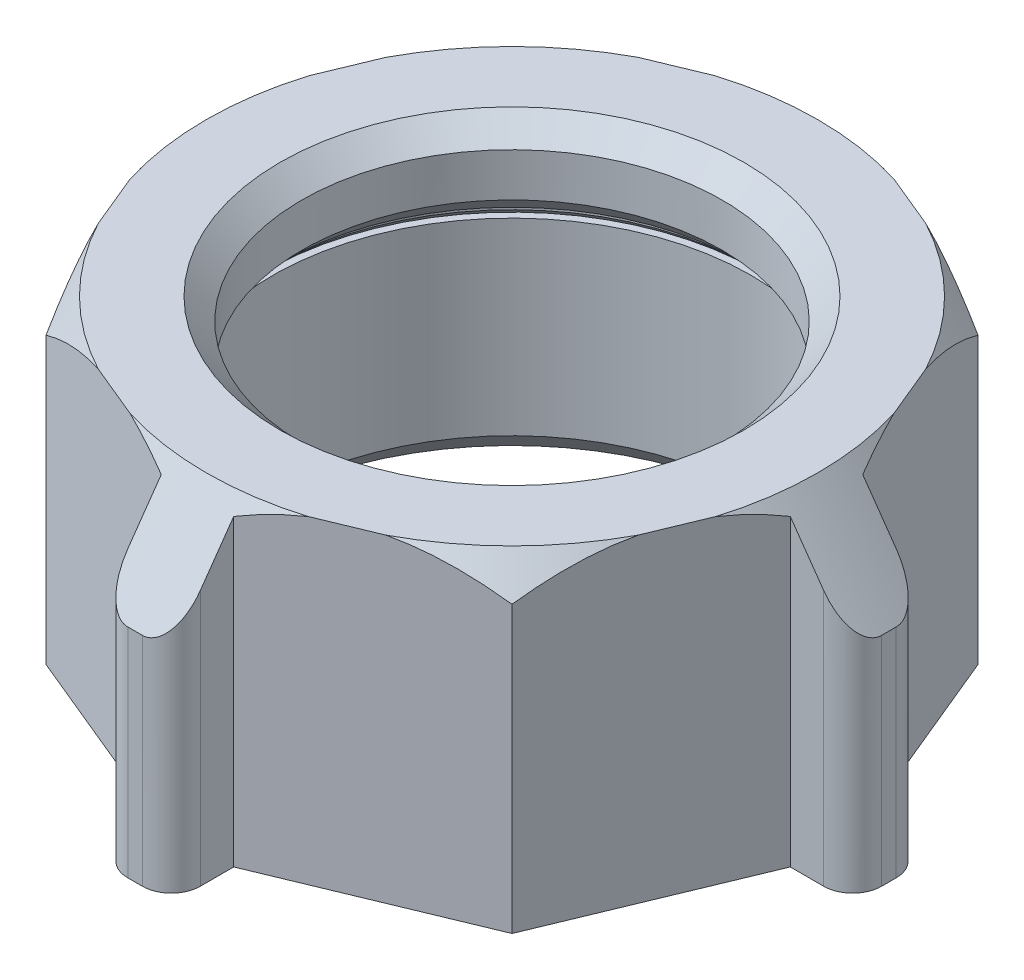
ISO-10303-21;
HEADER;
FILE_DESCRIPTION(('STEP AP214'),'2;1');
FILE_NAME('part.step','',(''),(''),'','','');
FILE_SCHEMA(('AUTOMOTIVE_DESIGN { 1 0 10303 214 1 1 1 1 }'));
ENDSEC;
DATA;
#1=APPLICATION_CONTEXT('core data for automotive mechanical design processes');
#2=APPLICATION_PROTOCOL_DEFINITION('international standard','automotive_design',2000,#1);
#3=PRODUCT_CONTEXT('',#1,'mechanical');
#4=PRODUCT('Part','Part','',(#3));
#5=PRODUCT_RELATED_PRODUCT_CATEGORY('part','',(#4));
#6=PRODUCT_DEFINITION_FORMATION('','',#4);
#7=PRODUCT_DEFINITION_CONTEXT('part definition',#1,'design');
#8=PRODUCT_DEFINITION('design','',#6,#7);
#9=PRODUCT_DEFINITION_SHAPE('','',#8);
#10=(LENGTH_UNIT() NAMED_UNIT(*) SI_UNIT(.MILLI.,.METRE.));
#11=(NAMED_UNIT(*) PLANE_ANGLE_UNIT() SI_UNIT($,.RADIAN.));
#12=(NAMED_UNIT(*) SI_UNIT($,.STERADIAN.) SOLID_ANGLE_UNIT());
#13=UNCERTAINTY_MEASURE_WITH_UNIT(LENGTH_MEASURE(1.E-05),#10,'distance_accuracy_value','');
#14=(GEOMETRIC_REPRESENTATION_CONTEXT(3) GLOBAL_UNCERTAINTY_ASSIGNED_CONTEXT((#13)) GLOBAL_UNIT_ASSIGNED_CONTEXT((#10,
#11,#12)) REPRESENTATION_CONTEXT('',''));
#15=CARTESIAN_POINT('',(0.,0.,0.));
#16=DIRECTION('',(0.,0.,1.));
#17=DIRECTION('',(1.,0.,0.));
#18=AXIS2_PLACEMENT_3D('',#15,#16,#17);
#19=CARTESIAN_POINT('',(0.,16.,0.));
#20=DIRECTION('',(0.,-1.,0.));
#21=DIRECTION('',(0.,0.,-1.));
#22=AXIS2_PLACEMENT_3D('',#19,#20,#21);
#23=CYLINDRICAL_SURFACE('',#22,16.5);
#24=CARTESIAN_POINT('',(0.,2.,0.));
#25=DIRECTION('',(0.,-1.,0.));
#26=DIRECTION('',(0.,0.,-1.));
#27=AXIS2_PLACEMENT_3D('',#24,#25,#26);
#28=CIRCLE('',#27,16.5);
#29=CARTESIAN_POINT('',(0.,2.,-16.5));
#30=VERTEX_POINT('',#29);
#31=EDGE_CURVE('E586',#30,#30,#28,.T.);
#32=ORIENTED_EDGE('',*,*,#31,.T.);
#33=EDGE_LOOP('',(#32));
#34=FACE_BOUND('',#33,.T.);
#35=CARTESIAN_POINT('',(0.,15.,0.));
#36=DIRECTION('',(0.,-1.,0.));
#37=DIRECTION('',(0.,0.,-1.));
#38=AXIS2_PLACEMENT_3D('',#35,#36,#37);
#39=CIRCLE('',#38,16.5);
#40=CARTESIAN_POINT('',(0.,15.,-16.5));
#41=VERTEX_POINT('',#40);
#42=EDGE_CURVE('E589',#41,#41,#39,.F.);
#43=ORIENTED_EDGE('',*,*,#42,.T.);
#44=EDGE_LOOP('',(#43));
#45=FACE_BOUND('',#44,.T.);
#46=ADVANCED_FACE('F36',(#34,#45),#23,.F.);
#47=CARTESIAN_POINT('',(0.,22.,-22.7302362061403));
#48=DIRECTION('',(0.38268343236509,0.,0.923879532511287));
#49=DIRECTION('',(0.923879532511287,0.,-0.38268343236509));
#50=AXIS2_PLACEMENT_3D('',#47,#48,#49);
#51=PLANE('',#50);
#52=DIRECTION('',(0.,-1.,0.));
#53=VECTOR('',#52,1.);
#54=CARTESIAN_POINT('',(-16.0727041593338,22.,-16.0727041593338));
#55=LINE('',#54,#53);
#56=CARTESIAN_POINT('',(-16.0727041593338,19.6697066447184,-16.0727041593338));
#57=VERTEX_POINT('',#56);
#58=CARTESIAN_POINT('',(-16.0727041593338,0.,-16.0727041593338));
#59=VERTEX_POINT('',#58);
#60=EDGE_CURVE('E652',#57,#59,#55,.T.);
#61=ORIENTED_EDGE('',*,*,#60,.F.);
#62=CARTESIAN_POINT('',(-28.3073983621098,8.7571042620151,-11.0049278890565));
#63=CARTESIAN_POINT('',(-28.0596775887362,9.03373951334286,-11.1075371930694));
#64=CARTESIAN_POINT('',(-27.8108444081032,9.30920632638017,-11.210607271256));
#65=CARTESIAN_POINT('',(-27.3107522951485,9.85756180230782,-11.4177522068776));
#66=CARTESIAN_POINT('',(-27.0594932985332,10.1304503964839,-11.521827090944));
#67=CARTESIAN_POINT('',(-26.3015863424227,10.9450902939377,-11.8357624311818));
#68=CARTESIAN_POINT('',(-25.7910137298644,11.4825856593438,-12.0472485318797));
#69=CARTESIAN_POINT('',(-24.7479111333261,12.5535668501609,-12.4793157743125));
#70=CARTESIAN_POINT('',(-24.2151489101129,13.0867882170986,-12.6999931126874));
#71=CARTESIAN_POINT('',(-23.1346022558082,14.1350345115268,-13.1475701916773));
#72=CARTESIAN_POINT('',(-22.5868200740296,14.6500621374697,-13.3744690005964));
#73=CARTESIAN_POINT('',(-21.7252916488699,15.4291043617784,-13.7313257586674));
#74=CARTESIAN_POINT('',(-21.417809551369,15.7012442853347,-13.8586890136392));
#75=CARTESIAN_POINT('',(-20.7969381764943,16.2374998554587,-14.1158623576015));
#76=CARTESIAN_POINT('',(-20.4835491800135,16.5016158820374,-14.2456723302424));
#77=CARTESIAN_POINT('',(-19.8500913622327,17.0207380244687,-14.5080591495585));
#78=CARTESIAN_POINT('',(-19.5300187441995,17.2757387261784,-14.6406375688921));
#79=CARTESIAN_POINT('',(-18.8827682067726,17.7749518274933,-14.9087375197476));
#80=CARTESIAN_POINT('',(-18.5555904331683,18.0191644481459,-15.0442589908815));
#81=CARTESIAN_POINT('',(-17.8961166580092,18.4931149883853,-15.3174219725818));
#82=CARTESIAN_POINT('',(-17.5638825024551,18.7229530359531,-15.4550378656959));
#83=CARTESIAN_POINT('',(-16.8912418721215,19.1681098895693,-15.7336547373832));
#84=CARTESIAN_POINT('',(-16.5508347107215,19.3834274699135,-15.8746560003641));
#85=CARTESIAN_POINT('',(-15.5172355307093,20.0034948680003,-16.3027867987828));
#86=CARTESIAN_POINT('',(-14.8105846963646,20.3831546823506,-16.5954911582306));
#87=CARTESIAN_POINT('',(-13.8560780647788,20.8223654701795,-16.9908607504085));
#88=CARTESIAN_POINT('',(-13.6242693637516,20.9235379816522,-17.0868790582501));
#89=CARTESIAN_POINT('',(-13.1570737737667,21.115665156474,-17.2803978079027));
#90=CARTESIAN_POINT('',(-12.921687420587,21.206621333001,-17.3778980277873));
#91=CARTESIAN_POINT('',(-12.4474182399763,21.3774319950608,-17.5743467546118));
#92=CARTESIAN_POINT('',(-12.208534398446,21.4572831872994,-17.6732956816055));
#93=CARTESIAN_POINT('',(-11.7274901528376,21.6049725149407,-17.872550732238));
#94=CARTESIAN_POINT('',(-11.4853283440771,21.6728053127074,-17.9728574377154));
#95=CARTESIAN_POINT('',(-11.0027893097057,21.7943935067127,-18.1727316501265));
#96=CARTESIAN_POINT('',(-10.7624639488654,21.8483893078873,-18.2722776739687));
#97=CARTESIAN_POINT('',(-10.2796071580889,21.9432042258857,-18.4722835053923));
#98=CARTESIAN_POINT('',(-10.0370758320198,21.9840239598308,-18.5727432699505));
#99=CARTESIAN_POINT('',(-9.55040075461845,22.0518893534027,-18.7743306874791));
#100=CARTESIAN_POINT('',(-9.30625722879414,22.0789368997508,-18.8754582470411));
#101=CARTESIAN_POINT('',(-8.81702111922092,22.1188458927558,-19.078106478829));
#102=CARTESIAN_POINT('',(-8.57192870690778,22.131709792,-19.1796270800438));
#103=CARTESIAN_POINT('',(-8.07835422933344,22.1431259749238,-19.3840723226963));
#104=CARTESIAN_POINT('',(-7.82986851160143,22.1414951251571,-19.4869984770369));
#105=CARTESIAN_POINT('',(-7.33342666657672,22.1235138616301,-19.6926314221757));
#106=CARTESIAN_POINT('',(-7.08547040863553,22.1071676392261,-19.7953382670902));
#107=CARTESIAN_POINT('',(-6.5906924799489,22.0600194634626,-20.0002819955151));
#108=CARTESIAN_POINT('',(-6.34387100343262,22.0292151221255,-20.1025187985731));
#109=CARTESIAN_POINT('',(-5.85206771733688,21.9536424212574,-20.3062303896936));
#110=CARTESIAN_POINT('',(-5.6070860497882,21.9088729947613,-20.407705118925));
#111=CARTESIAN_POINT('',(-4.8722582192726,21.753812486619,-20.7120807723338));
#112=CARTESIAN_POINT('',(-4.38598869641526,21.6231121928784,-20.91350020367));
#113=CARTESIAN_POINT('',(-3.42666181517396,21.3143947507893,-21.3108664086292));
#114=CARTESIAN_POINT('',(-2.95360722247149,21.1363677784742,-21.5068120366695));
#115=CARTESIAN_POINT('',(-1.84796887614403,20.666433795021,-21.964782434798));
#116=CARTESIAN_POINT('',(-1.22182513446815,20.3568309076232,-22.2241396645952));
#117=CARTESIAN_POINT('',(0.00311824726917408,19.6799312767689,-22.73152782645));
#118=CARTESIAN_POINT('',(0.601901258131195,19.31260003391,-22.9795518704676));
#119=CARTESIAN_POINT('',(1.77628909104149,18.533077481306,-23.465999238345));
#120=CARTESIAN_POINT('',(2.35181643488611,18.1207508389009,-23.704390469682));
#121=CARTESIAN_POINT('',(3.48084306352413,17.262768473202,-24.1720486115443));
#122=CARTESIAN_POINT('',(4.03434785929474,16.8171211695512,-24.401317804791));
#123=CARTESIAN_POINT('',(5.03266499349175,15.975885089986,-24.8148343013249));
#124=CARTESIAN_POINT('',(5.48031282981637,15.5842081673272,-25.0002561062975));
#125=CARTESIAN_POINT('',(6.36428989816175,14.7861689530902,-25.366411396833));
#126=CARTESIAN_POINT('',(6.80061870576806,14.379806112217,-25.5471447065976));
#127=CARTESIAN_POINT('',(7.65802931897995,13.5601357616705,-25.9022958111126));
#128=CARTESIAN_POINT('',(8.07923328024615,13.1469775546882,-26.0767642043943));
#129=CARTESIAN_POINT('',(8.70465126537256,12.5199297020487,-26.3358208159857));
#130=CARTESIAN_POINT('',(8.91203232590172,12.3097235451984,-26.4217208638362));
#131=CARTESIAN_POINT('',(9.32481380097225,11.8870555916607,-26.5927005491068));
#132=CARTESIAN_POINT('',(9.53021426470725,11.6745938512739,-26.6777802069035));
#133=CARTESIAN_POINT('',(9.73469420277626,11.4610982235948,-26.7624785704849));
#134=B_SPLINE_CURVE_WITH_KNOTS('',3,(#62,#63,#64,#65,#66,#67,#68,#69,#70,#71,#72,#73,#74,#75,
#76,#77,#78,#79,#80,#81,#82,#83,#84,#85,#86,#87,#88,#89,#90,#91,#92,#93,#94,#95,#96,#97,#98,#99,
#100,#101,#102,#103,#104,#105,#106,#107,#108,#109,#110,#111,#112,#113,#114,#115,#116,#117,#118,
#119,#120,#121,#122,#123,#124,#125,#126,#127,#128,#129,#130,#131,#132,#133),.UNSPECIFIED.,.F.,
.F.,(4,2,2,2,2,2,2,2,2,2,2,2,2,2,2,2,2,2,2,2,2,2,2,2,2,2,2,2,2,2,2,2,2,2,2,4),(0.,
1.15575722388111,2.31154516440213,4.62408045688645,6.98000605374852,9.33558074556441,
10.6252256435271,11.9148093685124,13.2051467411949,14.4954576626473,15.7754509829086,
17.0555522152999,19.6115211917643,20.4229790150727,21.2343164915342,22.0458940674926,
22.8578311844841,23.6545232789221,24.4511780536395,25.2477236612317,26.0441315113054,
26.8506157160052,27.6568702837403,28.4632580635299,29.2697074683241,30.8938327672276,
32.5182954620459,34.7497628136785,36.9825688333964,39.2222858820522,41.4614388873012,
43.3302385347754,45.1991081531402,47.044726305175,47.9672919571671,48.8898346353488),.UNSPECIFIED.);
#135=CARTESIAN_POINT('',(-9.91814190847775,22.,-18.6220073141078));
#136=VERTEX_POINT('',#135);
#137=EDGE_CURVE('E633',#57,#136,#134,.T.);
#138=ORIENTED_EDGE('',*,*,#137,.T.);
#139=DIRECTION('',(-0.923879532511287,0.,0.38268343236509));
#140=VECTOR('',#139,1.);
#141=CARTESIAN_POINT('',(0.,22.,-22.7302362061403));
#142=LINE('',#141,#140);
#143=CARTESIAN_POINT('',(-6.15456225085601,22.,-20.1809330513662));
#144=VERTEX_POINT('',#143);
#145=EDGE_CURVE('E760',#144,#136,#142,.T.);
#146=ORIENTED_EDGE('',*,*,#145,.F.);
#147=CARTESIAN_POINT('',(-2.49999999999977,20.9435640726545,-21.6947023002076));
#148=VERTEX_POINT('',#147);
#149=EDGE_CURVE('E363',#144,#148,#134,.T.);
#150=ORIENTED_EDGE('',*,*,#149,.T.);
#151=DIRECTION('',(0.,1.,0.));
#152=VECTOR('',#151,1.);
#153=CARTESIAN_POINT('',(-2.49999999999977,22.,-21.6947023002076));
#154=LINE('',#153,#152);
#155=CARTESIAN_POINT('',(-2.49999999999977,0.,-21.6947023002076));
#156=VERTEX_POINT('',#155);
#157=EDGE_CURVE('E861',#156,#148,#154,.T.);
#158=ORIENTED_EDGE('',*,*,#157,.F.);
#159=DIRECTION('',(-0.923879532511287,0.,0.38268343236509));
#160=VECTOR('',#159,1.);
#161=CARTESIAN_POINT('',(0.,0.,-22.7302362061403));
#162=LINE('',#161,#160);
#163=EDGE_CURVE('E818',#156,#59,#162,.T.);
#164=ORIENTED_EDGE('',*,*,#163,.T.);
#165=EDGE_LOOP('',(#61,#138,#146,#150,#158,#164));
#166=FACE_BOUND('',#165,.T.);
#167=ADVANCED_FACE('F561',(#166),#51,.F.);
#168=CARTESIAN_POINT('',(-22.7302362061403,22.,0.));
#169=DIRECTION('',(0.923879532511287,0.,-0.38268343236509));
#170=DIRECTION('',(-0.38268343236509,0.,-0.923879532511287));
#171=AXIS2_PLACEMENT_3D('',#168,#169,#170);
#172=PLANE('',#171);
#173=DIRECTION('',(0.,-1.,0.));
#174=VECTOR('',#173,1.);
#175=CARTESIAN_POINT('',(-16.0727041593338,22.,16.0727041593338));
#176=LINE('',#175,#174);
#177=CARTESIAN_POINT('',(-16.0727041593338,19.6697066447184,16.0727041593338));
#178=VERTEX_POINT('',#177);
#179=CARTESIAN_POINT('',(-16.0727041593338,0.,16.0727041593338));
#180=VERTEX_POINT('',#179);
#181=EDGE_CURVE('E650',#178,#180,#176,.T.);
#182=ORIENTED_EDGE('',*,*,#181,.F.);
#183=CARTESIAN_POINT('',(-11.0049278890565,8.75710426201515,28.3073983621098));
#184=CARTESIAN_POINT('',(-11.1075371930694,9.03373951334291,28.0596775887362));
#185=CARTESIAN_POINT('',(-11.210607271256,9.30920632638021,27.8108444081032));
#186=CARTESIAN_POINT('',(-11.4177522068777,9.85756180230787,27.3107522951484));
#187=CARTESIAN_POINT('',(-11.521827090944,10.130450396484,27.0594932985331));
#188=CARTESIAN_POINT('',(-11.8357624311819,10.9450902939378,26.3015863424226));
#189=CARTESIAN_POINT('',(-12.0472485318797,11.4825856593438,25.7910137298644));
#190=CARTESIAN_POINT('',(-12.4793157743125,12.553566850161,24.7479111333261));
#191=CARTESIAN_POINT('',(-12.6999931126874,13.0867882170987,24.2151489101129));
#192=CARTESIAN_POINT('',(-13.1475701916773,14.1350345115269,23.1346022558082));
#193=CARTESIAN_POINT('',(-13.3744690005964,14.6500621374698,22.5868200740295));
#194=CARTESIAN_POINT('',(-13.7313257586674,15.4291043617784,21.7252916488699));
#195=CARTESIAN_POINT('',(-13.8586890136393,15.7012442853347,21.4178095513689));
#196=CARTESIAN_POINT('',(-14.1158623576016,16.2374998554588,20.7969381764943));
#197=CARTESIAN_POINT('',(-14.2456723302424,16.5016158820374,20.4835491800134));
#198=CARTESIAN_POINT('',(-14.5080591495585,17.0207380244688,19.8500913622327));
#199=CARTESIAN_POINT('',(-14.6406375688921,17.2757387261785,19.5300187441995));
#200=CARTESIAN_POINT('',(-14.9087375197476,17.7749518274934,18.8827682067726));
#201=CARTESIAN_POINT('',(-15.0442589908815,18.0191644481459,18.5555904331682));
#202=CARTESIAN_POINT('',(-15.3174219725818,18.4931149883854,17.8961166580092));
#203=CARTESIAN_POINT('',(-15.4550378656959,18.7229530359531,17.5638825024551));
#204=CARTESIAN_POINT('',(-15.7336547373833,19.1681098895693,16.8912418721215));
#205=CARTESIAN_POINT('',(-15.8746560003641,19.3834274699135,16.5508347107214));
#206=CARTESIAN_POINT('',(-16.3027867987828,20.0034948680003,15.5172355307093));
#207=CARTESIAN_POINT('',(-16.5954911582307,20.3831546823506,14.8105846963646));
#208=CARTESIAN_POINT('',(-16.9908607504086,20.8223654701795,13.8560780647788));
#209=CARTESIAN_POINT('',(-17.0868790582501,20.9235379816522,13.6242693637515));
#210=CARTESIAN_POINT('',(-17.2803978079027,21.115665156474,13.1570737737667));
#211=CARTESIAN_POINT('',(-17.3778980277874,21.206621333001,12.9216874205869));
#212=CARTESIAN_POINT('',(-17.5743467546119,21.3774319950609,12.4474182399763));
#213=CARTESIAN_POINT('',(-17.6732956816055,21.4572831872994,12.208534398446));
#214=CARTESIAN_POINT('',(-17.872550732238,21.6049725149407,11.7274901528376));
#215=CARTESIAN_POINT('',(-17.9728574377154,21.6728053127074,11.4853283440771));
#216=CARTESIAN_POINT('',(-18.1727316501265,21.7943935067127,11.0027893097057));
#217=CARTESIAN_POINT('',(-18.2722776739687,21.8483893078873,10.7624639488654));
#218=CARTESIAN_POINT('',(-18.4722835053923,21.9432042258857,10.2796071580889));
#219=CARTESIAN_POINT('',(-18.5727432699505,21.9840239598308,10.0370758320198));
#220=CARTESIAN_POINT('',(-18.7743306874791,22.0518893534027,9.55040075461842));
#221=CARTESIAN_POINT('',(-18.8754582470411,22.0789368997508,9.30625722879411));
#222=CARTESIAN_POINT('',(-19.078106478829,22.1188458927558,8.81702111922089));
#223=CARTESIAN_POINT('',(-19.1796270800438,22.131709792,8.57192870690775));
#224=CARTESIAN_POINT('',(-19.3840723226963,22.1431259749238,8.07835422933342));
#225=CARTESIAN_POINT('',(-19.4869984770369,22.1414951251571,7.82986851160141));
#226=CARTESIAN_POINT('',(-19.6926314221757,22.1235138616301,7.3334266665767));
#227=CARTESIAN_POINT('',(-19.7953382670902,22.1071676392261,7.08547040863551));
#228=CARTESIAN_POINT('',(-20.0002819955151,22.0600194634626,6.59069247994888));
#229=CARTESIAN_POINT('',(-20.1025187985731,22.0292151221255,6.3438710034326));
#230=CARTESIAN_POINT('',(-20.3062303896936,21.9536424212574,5.85206771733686));
#231=CARTESIAN_POINT('',(-20.407705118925,21.9088729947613,5.60708604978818));
#232=CARTESIAN_POINT('',(-20.7120807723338,21.753812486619,4.87225821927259));
#233=CARTESIAN_POINT('',(-20.91350020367,21.6231121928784,4.38598869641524));
#234=CARTESIAN_POINT('',(-21.3108664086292,21.3143947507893,3.42666181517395));
#235=CARTESIAN_POINT('',(-21.5068120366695,21.1363677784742,2.95360722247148));
#236=CARTESIAN_POINT('',(-21.9647824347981,20.666433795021,1.84796887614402));
#237=CARTESIAN_POINT('',(-22.2241396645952,20.3568309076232,1.22182513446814));
#238=CARTESIAN_POINT('',(-22.73152782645,19.6799312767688,-0.00311824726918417));
#239=CARTESIAN_POINT('',(-22.9795518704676,19.31260003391,-0.601901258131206));
#240=CARTESIAN_POINT('',(-23.465999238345,18.5330774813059,-1.77628909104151));
#241=CARTESIAN_POINT('',(-23.704390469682,18.1207508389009,-2.35181643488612));
#242=CARTESIAN_POINT('',(-24.1720486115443,17.262768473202,-3.48084306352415));
#243=CARTESIAN_POINT('',(-24.401317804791,16.8171211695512,-4.03434785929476));
#244=CARTESIAN_POINT('',(-24.8148343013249,15.975885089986,-5.03266499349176));
#245=CARTESIAN_POINT('',(-25.0002561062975,15.5842081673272,-5.48031282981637));
#246=CARTESIAN_POINT('',(-25.3664113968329,14.7861689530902,-6.36428989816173));
#247=CARTESIAN_POINT('',(-25.5471447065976,14.3798061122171,-6.80061870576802));
#248=CARTESIAN_POINT('',(-25.9022958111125,13.5601357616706,-7.65802931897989));
#249=CARTESIAN_POINT('',(-26.0767642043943,13.1469775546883,-8.07923328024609));
#250=CARTESIAN_POINT('',(-26.3358208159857,12.5199297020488,-8.70465126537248));
#251=CARTESIAN_POINT('',(-26.4217208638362,12.3097235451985,-8.91203232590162));
#252=CARTESIAN_POINT('',(-26.5927005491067,11.8870555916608,-9.32481380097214));
#253=CARTESIAN_POINT('',(-26.6777802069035,11.674593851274,-9.53021426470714));
#254=CARTESIAN_POINT('',(-26.7624785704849,11.4610982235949,-9.73469420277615));
#255=B_SPLINE_CURVE_WITH_KNOTS('',3,(#183,#184,#185,#186,#187,#188,#189,#190,#191,#192,#193,
#194,#195,#196,#197,#198,#199,#200,#201,#202,#203,#204,#205,#206,#207,#208,#209,#210,#211,#212,
#213,#214,#215,#216,#217,#218,#219,#220,#221,#222,#223,#224,#225,#226,#227,#228,#229,#230,#231,
#232,#233,#234,#235,#236,#237,#238,#239,#240,#241,#242,#243,#244,#245,#246,#247,#248,#249,#250,
#251,#252,#253,#254),.UNSPECIFIED.,.F.,.F.,(4,2,2,2,2,2,2,2,2,2,2,2,2,2,2,2,2,2,2,2,2,2,2,2,2,2,
2,2,2,2,2,2,2,2,2,4),(0.,1.15575722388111,2.31154516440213,4.62408045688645,6.98000605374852,
9.33558074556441,10.625225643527,11.9148093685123,13.2051467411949,14.4954576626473,
15.7754509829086,17.0555522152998,19.6115211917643,20.4229790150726,21.2343164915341,
22.0458940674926,22.857831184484,23.6545232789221,24.4511780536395,25.2477236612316,
26.0441315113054,26.8506157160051,27.6568702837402,28.4632580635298,29.2697074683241,
30.8938327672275,32.5182954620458,34.7497628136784,36.9825688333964,39.2222858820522,
41.4614388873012,43.3302385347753,45.1991081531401,47.0447263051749,47.9672919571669,
48.8898346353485),.UNSPECIFIED.);
#256=CARTESIAN_POINT('',(-18.6220073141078,22.,9.91814190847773));
#257=VERTEX_POINT('',#256);
#258=EDGE_CURVE('E743',#178,#257,#255,.T.);
#259=ORIENTED_EDGE('',*,*,#258,.T.);
#260=DIRECTION('',(0.38268343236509,0.,0.923879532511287));
#261=VECTOR('',#260,1.);
#262=CARTESIAN_POINT('',(-22.7302362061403,22.,0.));
#263=LINE('',#262,#261);
#264=CARTESIAN_POINT('',(-20.1809330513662,22.,6.15456225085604));
#265=VERTEX_POINT('',#264);
#266=EDGE_CURVE('E630',#265,#257,#263,.T.);
#267=ORIENTED_EDGE('',*,*,#266,.F.);
#268=CARTESIAN_POINT('',(-21.6947023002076,20.9435640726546,2.49999999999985));
#269=VERTEX_POINT('',#268);
#270=EDGE_CURVE('E412',#265,#269,#255,.T.);
#271=ORIENTED_EDGE('',*,*,#270,.T.);
#272=DIRECTION('',(0.,1.,0.));
#273=VECTOR('',#272,1.);
#274=CARTESIAN_POINT('',(-21.6947023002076,22.,2.49999999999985));
#275=LINE('',#274,#273);
#276=CARTESIAN_POINT('',(-21.6947023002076,0.,2.49999999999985));
#277=VERTEX_POINT('',#276);
#278=EDGE_CURVE('E710',#277,#269,#275,.T.);
#279=ORIENTED_EDGE('',*,*,#278,.F.);
#280=DIRECTION('',(0.38268343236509,0.,0.923879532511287));
#281=VECTOR('',#280,1.);
#282=CARTESIAN_POINT('',(-22.7302362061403,0.,0.));
#283=LINE('',#282,#281);
#284=EDGE_CURVE('E822',#277,#180,#283,.T.);
#285=ORIENTED_EDGE('',*,*,#284,.T.);
#286=EDGE_LOOP('',(#182,#259,#267,#271,#279,#285));
#287=FACE_BOUND('',#286,.T.);
#288=ADVANCED_FACE('F553',(#287),#172,.F.);
#289=CARTESIAN_POINT('',(0.,22.,22.7302362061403));
#290=DIRECTION('',(-0.38268343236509,0.,-0.923879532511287));
#291=DIRECTION('',(-0.923879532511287,0.,0.38268343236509));
#292=AXIS2_PLACEMENT_3D('',#289,#290,#291);
#293=PLANE('',#292);
#294=DIRECTION('',(0.,-1.,0.));
#295=VECTOR('',#294,1.);
#296=CARTESIAN_POINT('',(16.0727041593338,22.,16.0727041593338));
#297=LINE('',#296,#295);
#298=CARTESIAN_POINT('',(16.0727041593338,19.6697066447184,16.0727041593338));
#299=VERTEX_POINT('',#298);
#300=CARTESIAN_POINT('',(16.0727041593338,0.,16.0727041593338));
#301=VERTEX_POINT('',#300);
#302=EDGE_CURVE('E643',#299,#301,#297,.T.);
#303=ORIENTED_EDGE('',*,*,#302,.F.);
#304=CARTESIAN_POINT('',(28.3073983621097,8.75710426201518,11.0049278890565));
#305=CARTESIAN_POINT('',(28.0596775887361,9.03373951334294,11.1075371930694));
#306=CARTESIAN_POINT('',(27.8108444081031,9.30920632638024,11.210607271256));
#307=CARTESIAN_POINT('',(27.3107522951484,9.85756180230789,11.4177522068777));
#308=CARTESIAN_POINT('',(27.0594932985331,10.130450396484,11.521827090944));
#309=CARTESIAN_POINT('',(26.3015863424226,10.9450902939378,11.8357624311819));
#310=CARTESIAN_POINT('',(25.7910137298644,11.4825856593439,12.0472485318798));
#311=CARTESIAN_POINT('',(24.747911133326,12.553566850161,12.4793157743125));
#312=CARTESIAN_POINT('',(24.2151489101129,13.0867882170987,12.6999931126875));
#313=CARTESIAN_POINT('',(23.1346022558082,14.1350345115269,13.1475701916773));
#314=CARTESIAN_POINT('',(22.5868200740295,14.6500621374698,13.3744690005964));
#315=CARTESIAN_POINT('',(21.7252916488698,15.4291043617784,13.7313257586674));
#316=CARTESIAN_POINT('',(21.4178095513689,15.7012442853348,13.8586890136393));
#317=CARTESIAN_POINT('',(20.7969381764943,16.2374998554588,14.1158623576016));
#318=CARTESIAN_POINT('',(20.4835491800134,16.5016158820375,14.2456723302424));
#319=CARTESIAN_POINT('',(19.8500913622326,17.0207380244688,14.5080591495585));
#320=CARTESIAN_POINT('',(19.5300187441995,17.2757387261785,14.6406375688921));
#321=CARTESIAN_POINT('',(18.8827682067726,17.7749518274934,14.9087375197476));
#322=CARTESIAN_POINT('',(18.5555904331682,18.0191644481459,15.0442589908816));
#323=CARTESIAN_POINT('',(17.8961166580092,18.4931149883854,15.3174219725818));
#324=CARTESIAN_POINT('',(17.563882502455,18.7229530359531,15.4550378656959));
#325=CARTESIAN_POINT('',(16.8912418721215,19.1681098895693,15.7336547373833));
#326=CARTESIAN_POINT('',(16.5508347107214,19.3834274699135,15.8746560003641));
#327=CARTESIAN_POINT('',(15.5172355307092,20.0034948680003,16.3027867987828));
#328=CARTESIAN_POINT('',(14.8105846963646,20.3831546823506,16.5954911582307));
#329=CARTESIAN_POINT('',(13.8560780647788,20.8223654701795,16.9908607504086));
#330=CARTESIAN_POINT('',(13.6242693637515,20.9235379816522,17.0868790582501));
#331=CARTESIAN_POINT('',(13.1570737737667,21.115665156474,17.2803978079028));
#332=CARTESIAN_POINT('',(12.9216874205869,21.206621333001,17.3778980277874));
#333=CARTESIAN_POINT('',(12.4474182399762,21.3774319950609,17.5743467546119));
#334=CARTESIAN_POINT('',(12.208534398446,21.4572831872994,17.6732956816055));
#335=CARTESIAN_POINT('',(11.7274901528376,21.6049725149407,17.872550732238));
#336=CARTESIAN_POINT('',(11.4853283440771,21.6728053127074,17.9728574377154));
#337=CARTESIAN_POINT('',(11.0027893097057,21.7943935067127,18.1727316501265));
#338=CARTESIAN_POINT('',(10.7624639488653,21.8483893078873,18.2722776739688));
#339=CARTESIAN_POINT('',(10.2796071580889,21.9432042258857,18.4722835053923));
#340=CARTESIAN_POINT('',(10.0370758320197,21.9840239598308,18.5727432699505));
#341=CARTESIAN_POINT('',(9.5504007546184,22.0518893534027,18.7743306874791));
#342=CARTESIAN_POINT('',(9.30625722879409,22.0789368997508,18.8754582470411));
#343=CARTESIAN_POINT('',(8.81702111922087,22.1188458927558,19.078106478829));
#344=CARTESIAN_POINT('',(8.57192870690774,22.131709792,19.1796270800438));
#345=CARTESIAN_POINT('',(8.0783542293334,22.1431259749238,19.3840723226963));
#346=CARTESIAN_POINT('',(7.82986851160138,22.1414951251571,19.4869984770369));
#347=CARTESIAN_POINT('',(7.33342666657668,22.1235138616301,19.6926314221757));
#348=CARTESIAN_POINT('',(7.08547040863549,22.1071676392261,19.7953382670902));
#349=CARTESIAN_POINT('',(6.59069247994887,22.0600194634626,20.0002819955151));
#350=CARTESIAN_POINT('',(6.34387100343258,22.0292151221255,20.1025187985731));
#351=CARTESIAN_POINT('',(5.85206771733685,21.9536424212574,20.3062303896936));
#352=CARTESIAN_POINT('',(5.60708604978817,21.9088729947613,20.407705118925));
#353=CARTESIAN_POINT('',(4.87225821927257,21.753812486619,20.7120807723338));
#354=CARTESIAN_POINT('',(4.38598869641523,21.6231121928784,20.91350020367));
#355=CARTESIAN_POINT('',(3.42666181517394,21.3143947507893,21.3108664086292));
#356=CARTESIAN_POINT('',(2.95360722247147,21.1363677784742,21.5068120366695));
#357=CARTESIAN_POINT('',(1.84796887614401,20.666433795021,21.9647824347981));
#358=CARTESIAN_POINT('',(1.22182513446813,20.3568309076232,22.2241396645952));
#359=CARTESIAN_POINT('',(-0.00311824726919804,19.6799312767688,22.73152782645));
#360=CARTESIAN_POINT('',(-0.601901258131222,19.31260003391,22.9795518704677));
#361=CARTESIAN_POINT('',(-1.77628909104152,18.5330774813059,23.465999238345));
#362=CARTESIAN_POINT('',(-2.35181643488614,18.1207508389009,23.704390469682));
#363=CARTESIAN_POINT('',(-3.48084306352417,17.262768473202,24.1720486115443));
#364=CARTESIAN_POINT('',(-4.03434785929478,16.8171211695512,24.401317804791));
#365=CARTESIAN_POINT('',(-5.03266499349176,15.975885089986,24.8148343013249));
#366=CARTESIAN_POINT('',(-5.48031282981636,15.5842081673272,25.0002561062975));
#367=CARTESIAN_POINT('',(-6.36428989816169,14.7861689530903,25.3664113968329));
#368=CARTESIAN_POINT('',(-6.80061870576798,14.3798061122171,25.5471447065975));
#369=CARTESIAN_POINT('',(-7.65802931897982,13.5601357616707,25.9022958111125));
#370=CARTESIAN_POINT('',(-8.07923328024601,13.1469775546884,26.0767642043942));
#371=CARTESIAN_POINT('',(-8.70465126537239,12.5199297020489,26.3358208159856));
#372=CARTESIAN_POINT('',(-8.91203232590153,12.3097235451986,26.4217208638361));
#373=CARTESIAN_POINT('',(-9.32481380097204,11.8870555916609,26.5927005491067));
#374=CARTESIAN_POINT('',(-9.53021426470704,11.6745938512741,26.6777802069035));
#375=CARTESIAN_POINT('',(-9.73469420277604,11.461098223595,26.7624785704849));
#376=B_SPLINE_CURVE_WITH_KNOTS('',3,(#304,#305,#306,#307,#308,#309,#310,#311,#312,#313,#314,
#315,#316,#317,#318,#319,#320,#321,#322,#323,#324,#325,#326,#327,#328,#329,#330,#331,#332,#333,
#334,#335,#336,#337,#338,#339,#340,#341,#342,#343,#344,#345,#346,#347,#348,#349,#350,#351,#352,
#353,#354,#355,#356,#357,#358,#359,#360,#361,#362,#363,#364,#365,#366,#367,#368,#369,#370,#371,
#372,#373,#374,#375),.UNSPECIFIED.,.F.,.F.,(4,2,2,2,2,2,2,2,2,2,2,2,2,2,2,2,2,2,2,2,2,2,2,2,2,2,
2,2,2,2,2,2,2,2,2,4),(0.,1.15575722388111,2.31154516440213,4.62408045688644,6.98000605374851,
9.33558074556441,10.625225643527,11.9148093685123,13.2051467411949,14.4954576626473,
15.7754509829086,17.0555522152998,19.6115211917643,20.4229790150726,21.2343164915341,
22.0458940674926,22.857831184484,23.6545232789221,24.4511780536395,25.2477236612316,
26.0441315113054,26.8506157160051,27.6568702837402,28.4632580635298,29.2697074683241,
30.8938327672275,32.5182954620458,34.7497628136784,36.9825688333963,39.2222858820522,
41.4614388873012,43.3302385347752,45.19910815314,47.0447263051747,47.9672919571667,
48.8898346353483),.UNSPECIFIED.);
#377=CARTESIAN_POINT('',(9.91814190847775,22.,18.6220073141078));
#378=VERTEX_POINT('',#377);
#379=EDGE_CURVE('E731',#299,#378,#376,.T.);
#380=ORIENTED_EDGE('',*,*,#379,.T.);
#381=DIRECTION('',(0.923879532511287,0.,-0.38268343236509));
#382=VECTOR('',#381,1.);
#383=CARTESIAN_POINT('',(0.,22.,22.7302362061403));
#384=LINE('',#383,#382);
#385=CARTESIAN_POINT('',(6.15456225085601,22.,20.1809330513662));
#386=VERTEX_POINT('',#385);
#387=EDGE_CURVE('E640',#386,#378,#384,.T.);
#388=ORIENTED_EDGE('',*,*,#387,.F.);
#389=CARTESIAN_POINT('',(2.49999999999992,20.9435640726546,21.6947023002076));
#390=VERTEX_POINT('',#389);
#391=EDGE_CURVE('E461',#386,#390,#376,.T.);
#392=ORIENTED_EDGE('',*,*,#391,.T.);
#393=DIRECTION('',(0.,1.,0.));
#394=VECTOR('',#393,1.);
#395=CARTESIAN_POINT('',(2.49999999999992,22.,21.6947023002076));
#396=LINE('',#395,#394);
#397=CARTESIAN_POINT('',(2.49999999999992,0.,21.6947023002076));
#398=VERTEX_POINT('',#397);
#399=EDGE_CURVE('E788',#398,#390,#396,.T.);
#400=ORIENTED_EDGE('',*,*,#399,.F.);
#401=DIRECTION('',(0.923879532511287,0.,-0.38268343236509));
#402=VECTOR('',#401,1.);
#403=CARTESIAN_POINT('',(0.,0.,22.7302362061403));
#404=LINE('',#403,#402);
#405=EDGE_CURVE('E827',#398,#301,#404,.T.);
#406=ORIENTED_EDGE('',*,*,#405,.T.);
#407=EDGE_LOOP('',(#303,#380,#388,#392,#400,#406));
#408=FACE_BOUND('',#407,.T.);
#409=ADVANCED_FACE('F550',(#408),#293,.F.);
#410=CARTESIAN_POINT('',(22.7302362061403,22.,0.));
#411=DIRECTION('',(-0.923879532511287,0.,0.38268343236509));
#412=DIRECTION('',(0.38268343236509,0.,0.923879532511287));
#413=AXIS2_PLACEMENT_3D('',#410,#411,#412);
#414=PLANE('',#413);
#415=DIRECTION('',(0.,-1.,0.));
#416=VECTOR('',#415,1.);
#417=CARTESIAN_POINT('',(16.0727041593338,22.,-16.0727041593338));
#418=LINE('',#417,#416);
#419=CARTESIAN_POINT('',(16.0727041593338,19.6697066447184,-16.0727041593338));
#420=VERTEX_POINT('',#419);
#421=CARTESIAN_POINT('',(16.0727041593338,0.,-16.0727041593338));
#422=VERTEX_POINT('',#421);
#423=EDGE_CURVE('E654',#420,#422,#418,.T.);
#424=ORIENTED_EDGE('',*,*,#423,.F.);
#425=CARTESIAN_POINT('',(11.0049278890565,8.75710426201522,-28.3073983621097));
#426=CARTESIAN_POINT('',(11.1075371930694,9.03373951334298,-28.0596775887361));
#427=CARTESIAN_POINT('',(11.210607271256,9.30920632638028,-27.8108444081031));
#428=CARTESIAN_POINT('',(11.4177522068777,9.85756180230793,-27.3107522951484));
#429=CARTESIAN_POINT('',(11.521827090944,10.130450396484,-27.0594932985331));
#430=CARTESIAN_POINT('',(11.8357624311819,10.9450902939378,-26.3015863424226));
#431=CARTESIAN_POINT('',(12.0472485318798,11.4825856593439,-25.7910137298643));
#432=CARTESIAN_POINT('',(12.4793157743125,12.553566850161,-24.747911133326));
#433=CARTESIAN_POINT('',(12.6999931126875,13.0867882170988,-24.2151489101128));
#434=CARTESIAN_POINT('',(13.1475701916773,14.1350345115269,-23.1346022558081));
#435=CARTESIAN_POINT('',(13.3744690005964,14.6500621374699,-22.5868200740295));
#436=CARTESIAN_POINT('',(13.7313257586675,15.4291043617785,-21.7252916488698));
#437=CARTESIAN_POINT('',(13.8586890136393,15.7012442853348,-21.4178095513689));
#438=CARTESIAN_POINT('',(14.1158623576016,16.2374998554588,-20.7969381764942));
#439=CARTESIAN_POINT('',(14.2456723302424,16.5016158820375,-20.4835491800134));
#440=CARTESIAN_POINT('',(14.5080591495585,17.0207380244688,-19.8500913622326));
#441=CARTESIAN_POINT('',(14.6406375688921,17.2757387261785,-19.5300187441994));
#442=CARTESIAN_POINT('',(14.9087375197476,17.7749518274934,-18.8827682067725));
#443=CARTESIAN_POINT('',(15.0442589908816,18.0191644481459,-18.5555904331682));
#444=CARTESIAN_POINT('',(15.3174219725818,18.4931149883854,-17.8961166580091));
#445=CARTESIAN_POINT('',(15.4550378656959,18.7229530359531,-17.563882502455));
#446=CARTESIAN_POINT('',(15.7336547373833,19.1681098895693,-16.8912418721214));
#447=CARTESIAN_POINT('',(15.8746560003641,19.3834274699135,-16.5508347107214));
#448=CARTESIAN_POINT('',(16.3027867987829,20.0034948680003,-15.5172355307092));
#449=CARTESIAN_POINT('',(16.5954911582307,20.3831546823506,-14.8105846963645));
#450=CARTESIAN_POINT('',(16.9908607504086,20.8223654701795,-13.8560780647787));
#451=CARTESIAN_POINT('',(17.0868790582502,20.9235379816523,-13.6242693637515));
#452=CARTESIAN_POINT('',(17.2803978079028,21.1156651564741,-13.1570737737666));
#453=CARTESIAN_POINT('',(17.3778980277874,21.206621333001,-12.9216874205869));
#454=CARTESIAN_POINT('',(17.5743467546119,21.3774319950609,-12.4474182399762));
#455=CARTESIAN_POINT('',(17.6732956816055,21.4572831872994,-12.2085343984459));
#456=CARTESIAN_POINT('',(17.872550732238,21.6049725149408,-11.7274901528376));
#457=CARTESIAN_POINT('',(17.9728574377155,21.6728053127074,-11.485328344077));
#458=CARTESIAN_POINT('',(18.1727316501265,21.7943935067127,-11.0027893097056));
#459=CARTESIAN_POINT('',(18.2722776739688,21.8483893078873,-10.7624639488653));
#460=CARTESIAN_POINT('',(18.4722835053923,21.9432042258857,-10.2796071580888));
#461=CARTESIAN_POINT('',(18.5727432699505,21.9840239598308,-10.0370758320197));
#462=CARTESIAN_POINT('',(18.7743306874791,22.0518893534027,-9.55040075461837));
#463=CARTESIAN_POINT('',(18.8754582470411,22.0789368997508,-9.30625722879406));
#464=CARTESIAN_POINT('',(19.078106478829,22.1188458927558,-8.81702111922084));
#465=CARTESIAN_POINT('',(19.1796270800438,22.131709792,-8.5719287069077));
#466=CARTESIAN_POINT('',(19.3840723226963,22.1431259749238,-8.07835422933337));
#467=CARTESIAN_POINT('',(19.486998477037,22.1414951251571,-7.82986851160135));
#468=CARTESIAN_POINT('',(19.6926314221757,22.1235138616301,-7.33342666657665));
#469=CARTESIAN_POINT('',(19.7953382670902,22.1071676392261,-7.08547040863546));
#470=CARTESIAN_POINT('',(20.0002819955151,22.0600194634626,-6.59069247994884));
#471=CARTESIAN_POINT('',(20.1025187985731,22.0292151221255,-6.34387100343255));
#472=CARTESIAN_POINT('',(20.3062303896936,21.9536424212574,-5.85206771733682));
#473=CARTESIAN_POINT('',(20.407705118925,21.9088729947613,-5.60708604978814));
#474=CARTESIAN_POINT('',(20.7120807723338,21.753812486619,-4.87225821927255));
#475=CARTESIAN_POINT('',(20.91350020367,21.6231121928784,-4.38598869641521));
#476=CARTESIAN_POINT('',(21.3108664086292,21.3143947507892,-3.42666181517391));
#477=CARTESIAN_POINT('',(21.5068120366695,21.1363677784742,-2.95360722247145));
#478=CARTESIAN_POINT('',(21.9647824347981,20.666433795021,-1.84796887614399));
#479=CARTESIAN_POINT('',(22.2241396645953,20.3568309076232,-1.2218251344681));
#480=CARTESIAN_POINT('',(22.73152782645,19.6799312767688,0.00311824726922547));
#481=CARTESIAN_POINT('',(22.9795518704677,19.31260003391,0.60190125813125));
#482=CARTESIAN_POINT('',(23.4659992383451,18.5330774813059,1.77628909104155));
#483=CARTESIAN_POINT('',(23.7043904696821,18.1207508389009,2.35181643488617));
#484=CARTESIAN_POINT('',(24.1720486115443,17.262768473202,3.48084306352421));
#485=CARTESIAN_POINT('',(24.401317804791,16.8171211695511,4.03434785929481));
#486=CARTESIAN_POINT('',(24.8148343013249,15.975885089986,5.03266499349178));
#487=CARTESIAN_POINT('',(25.0002561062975,15.5842081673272,5.48031282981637));
#488=CARTESIAN_POINT('',(25.3664113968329,14.7861689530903,6.36428989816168));
#489=CARTESIAN_POINT('',(25.5471447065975,14.3798061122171,6.80061870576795));
#490=CARTESIAN_POINT('',(25.9022958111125,13.5601357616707,7.65802931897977));
#491=CARTESIAN_POINT('',(26.0767642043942,13.1469775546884,8.07923328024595));
#492=CARTESIAN_POINT('',(26.3358208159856,12.519929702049,8.70465126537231));
#493=CARTESIAN_POINT('',(26.4217208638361,12.3097235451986,8.91203232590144));
#494=CARTESIAN_POINT('',(26.5927005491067,11.887055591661,9.32481380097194));
#495=CARTESIAN_POINT('',(26.6777802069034,11.6745938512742,9.53021426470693));
#496=CARTESIAN_POINT('',(26.7624785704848,11.4610982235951,9.73469420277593));
#497=B_SPLINE_CURVE_WITH_KNOTS('',3,(#425,#426,#427,#428,#429,#430,#431,#432,#433,#434,#435,
#436,#437,#438,#439,#440,#441,#442,#443,#444,#445,#446,#447,#448,#449,#450,#451,#452,#453,#454,
#455,#456,#457,#458,#459,#460,#461,#462,#463,#464,#465,#466,#467,#468,#469,#470,#471,#472,#473,
#474,#475,#476,#477,#478,#479,#480,#481,#482,#483,#484,#485,#486,#487,#488,#489,#490,#491,#492,
#493,#494,#495,#496),.UNSPECIFIED.,.F.,.F.,(4,2,2,2,2,2,2,2,2,2,2,2,2,2,2,2,2,2,2,2,2,2,2,2,2,2,
2,2,2,2,2,2,2,2,2,4),(0.,1.15575722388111,2.31154516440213,4.62408045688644,6.98000605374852,
9.33558074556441,10.625225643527,11.9148093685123,13.2051467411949,14.4954576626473,
15.7754509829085,17.0555522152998,19.6115211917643,20.4229790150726,21.2343164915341,
22.0458940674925,22.857831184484,23.654523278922,24.4511780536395,25.2477236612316,
26.0441315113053,26.8506157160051,27.6568702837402,28.4632580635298,29.2697074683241,
30.8938327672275,32.5182954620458,34.7497628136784,36.9825688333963,39.2222858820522,
41.4614388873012,43.3302385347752,45.1991081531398,47.0447263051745,47.9672919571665,
48.8898346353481),.UNSPECIFIED.);
#498=CARTESIAN_POINT('',(18.6220073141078,22.,-9.91814190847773));
#499=VERTEX_POINT('',#498);
#500=EDGE_CURVE('E726',#420,#499,#497,.T.);
#501=ORIENTED_EDGE('',*,*,#500,.T.);
#502=DIRECTION('',(-0.38268343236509,0.,-0.923879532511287));
#503=VECTOR('',#502,1.);
#504=CARTESIAN_POINT('',(22.7302362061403,22.,0.));
#505=LINE('',#504,#503);
#506=CARTESIAN_POINT('',(20.1809330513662,22.,-6.15456225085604));
#507=VERTEX_POINT('',#506);
#508=EDGE_CURVE('E761',#507,#499,#505,.T.);
#509=ORIENTED_EDGE('',*,*,#508,.F.);
#510=CARTESIAN_POINT('',(21.6947023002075,20.9435640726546,-2.5));
#511=VERTEX_POINT('',#510);
#512=EDGE_CURVE('E507',#507,#511,#497,.T.);
#513=ORIENTED_EDGE('',*,*,#512,.T.);
#514=DIRECTION('',(0.,1.,0.));
#515=VECTOR('',#514,1.);
#516=CARTESIAN_POINT('',(21.6947023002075,22.,-2.5));
#517=LINE('',#516,#515);
#518=CARTESIAN_POINT('',(21.6947023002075,0.,-2.5));
#519=VERTEX_POINT('',#518);
#520=EDGE_CURVE('E802',#519,#511,#517,.T.);
#521=ORIENTED_EDGE('',*,*,#520,.F.);
#522=DIRECTION('',(-0.38268343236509,0.,-0.923879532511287));
#523=VECTOR('',#522,1.);
#524=CARTESIAN_POINT('',(22.7302362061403,0.,0.));
#525=LINE('',#524,#523);
#526=EDGE_CURVE('E813',#519,#422,#525,.T.);
#527=ORIENTED_EDGE('',*,*,#526,.T.);
#528=EDGE_LOOP('',(#424,#501,#509,#513,#521,#527));
#529=FACE_BOUND('',#528,.T.);
#530=ADVANCED_FACE('F541',(#529),#414,.F.);
#531=CARTESIAN_POINT('',(0.,0.,0.));
#532=DIRECTION('',(0.,1.,0.));
#533=DIRECTION('',(0.,0.,1.));
#534=AXIS2_PLACEMENT_3D('',#531,#532,#533);
#535=CYLINDRICAL_SURFACE('',#534,14.5);
#536=CARTESIAN_POINT('',(0.,17.5,0.));
#537=DIRECTION('',(0.,-1.,0.));
#538=DIRECTION('',(0.,0.,-1.));
#539=AXIS2_PLACEMENT_3D('',#536,#537,#538);
#540=CIRCLE('',#539,14.5);
#541=CARTESIAN_POINT('',(0.,17.5,-14.5));
#542=VERTEX_POINT('',#541);
#543=EDGE_CURVE('E591',#542,#542,#540,.T.);
#544=ORIENTED_EDGE('',*,*,#543,.T.);
#545=EDGE_LOOP('',(#544));
#546=FACE_BOUND('',#545,.T.);
#547=CARTESIAN_POINT('',(0.,20.5,0.));
#548=DIRECTION('',(0.,1.,0.));
#549=DIRECTION('',(0.,0.,1.));
#550=AXIS2_PLACEMENT_3D('',#547,#548,#549);
#551=CIRCLE('',#550,14.5);
#552=CARTESIAN_POINT('',(0.,20.5,14.5));
#553=VERTEX_POINT('',#552);
#554=EDGE_CURVE('E288',#553,#553,#551,.T.);
#555=ORIENTED_EDGE('',*,*,#554,.T.);
#556=EDGE_LOOP('',(#555));
#557=FACE_BOUND('',#556,.T.);
#558=ADVANCED_FACE('F538',(#546,#557),#535,.F.);
#559=CARTESIAN_POINT('',(16.0727041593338,22.,16.0727041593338));
#560=DIRECTION('',(-0.923879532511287,0.,-0.38268343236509));
#561=DIRECTION('',(-0.38268343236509,0.,0.923879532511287));
#562=AXIS2_PLACEMENT_3D('',#559,#560,#561);
#563=PLANE('',#562);
#564=DIRECTION('',(0.,1.,0.));
#565=VECTOR('',#564,1.);
#566=CARTESIAN_POINT('',(21.6947023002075,22.,2.5));
#567=LINE('',#566,#565);
#568=CARTESIAN_POINT('',(21.6947023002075,0.,2.5));
#569=VERTEX_POINT('',#568);
#570=CARTESIAN_POINT('',(21.6947023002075,20.9435640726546,2.5));
#571=VERTEX_POINT('',#570);
#572=EDGE_CURVE('E805',#569,#571,#567,.T.);
#573=ORIENTED_EDGE('',*,*,#572,.T.);
#574=CARTESIAN_POINT('',(26.7624785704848,11.4610982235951,-9.73469420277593));
#575=CARTESIAN_POINT('',(26.6236694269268,11.8109501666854,-9.39957928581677));
#576=CARTESIAN_POINT('',(26.4838421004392,12.1580745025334,-9.06200625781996));
#577=CARTESIAN_POINT('',(26.2018705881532,12.8459537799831,-8.38126680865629));
#578=CARTESIAN_POINT('',(26.0597260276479,13.1867076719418,-8.03809948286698));
#579=CARTESIAN_POINT('',(25.7723488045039,13.8620764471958,-7.34430949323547));
#580=CARTESIAN_POINT('',(25.6271065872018,14.1966636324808,-6.99366376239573));
#581=CARTESIAN_POINT('',(25.3337536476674,14.8571184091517,-6.28544711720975));
#582=CARTESIAN_POINT('',(25.1856430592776,15.1829864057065,-5.92787652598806));
#583=CARTESIAN_POINT('',(24.8820084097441,15.8335003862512,-5.19483763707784));
#584=CARTESIAN_POINT('',(24.7263929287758,16.157855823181,-4.81914863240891));
#585=CARTESIAN_POINT('',(24.4113437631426,16.7937505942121,-4.0585526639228));
#586=CARTESIAN_POINT('',(24.2519098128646,17.1052890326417,-3.67364505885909));
#587=CARTESIAN_POINT('',(23.9290209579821,17.7125512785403,-2.89412240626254));
#588=CARTESIAN_POINT('',(23.7655721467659,18.0082971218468,-2.49952206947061));
#589=CARTESIAN_POINT('',(23.4340055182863,18.5812510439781,-1.69904941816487));
#590=CARTESIAN_POINT('',(23.265888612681,18.8584627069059,-1.29317930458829));
#591=CARTESIAN_POINT('',(22.9276076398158,19.3856909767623,-0.476496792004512));
#592=CARTESIAN_POINT('',(22.7575357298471,19.6361090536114,-0.0659068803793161));
#593=CARTESIAN_POINT('',(22.4120807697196,20.1108952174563,0.768095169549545));
#594=CARTESIAN_POINT('',(22.2366970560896,20.3352600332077,1.19150890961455));
#595=CARTESIAN_POINT('',(21.881519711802,20.7513615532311,2.04898287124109));
#596=CARTESIAN_POINT('',(21.7017573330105,20.9432789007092,2.48296764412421));
#597=CARTESIAN_POINT('',(21.3370566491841,21.290112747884,3.3634329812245));
#598=CARTESIAN_POINT('',(21.1521194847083,21.4450373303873,3.80991079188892));
#599=CARTESIAN_POINT('',(20.8058315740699,21.6918288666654,4.64592376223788));
#600=CARTESIAN_POINT('',(20.6451067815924,21.7896701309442,5.03394773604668));
#601=CARTESIAN_POINT('',(20.3211353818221,21.9509371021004,5.81608388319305));
#602=CARTESIAN_POINT('',(20.1578890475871,22.0143665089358,6.21019539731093));
#603=CARTESIAN_POINT('',(19.8299935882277,22.104326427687,7.00180506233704));
#604=CARTESIAN_POINT('',(19.665345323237,22.1308781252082,7.39930113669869));
#605=CARTESIAN_POINT('',(19.3357881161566,22.1460418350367,8.19492261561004));
#606=CARTESIAN_POINT('',(19.170879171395,22.1346534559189,8.59304802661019));
#607=CARTESIAN_POINT('',(18.8423435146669,22.0744669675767,9.38620326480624));
#608=CARTESIAN_POINT('',(18.6787151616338,22.0257293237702,9.78123705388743));
#609=CARTESIAN_POINT('',(18.3535947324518,21.8928742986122,10.5661472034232));
#610=CARTESIAN_POINT('',(18.192102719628,21.808755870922,10.9560234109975));
#611=CARTESIAN_POINT('',(17.871901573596,21.6080364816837,11.7290573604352));
#612=CARTESIAN_POINT('',(17.7131964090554,21.4913926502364,12.112205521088));
#613=CARTESIAN_POINT('',(17.3993406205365,21.2292836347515,12.8699204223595));
#614=CARTESIAN_POINT('',(17.2441903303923,21.083815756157,13.2444863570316));
#615=CARTESIAN_POINT('',(16.8234379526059,20.6499472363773,14.2602724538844));
#616=CARTESIAN_POINT('',(16.5616900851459,20.3358174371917,14.8921877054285));
#617=CARTESIAN_POINT('',(16.1778170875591,19.8208684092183,15.8189391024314));
#618=CARTESIAN_POINT('',(16.0512496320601,19.6418146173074,16.1244999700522));
#619=CARTESIAN_POINT('',(15.8008812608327,19.2709316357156,16.7289426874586));
#620=CARTESIAN_POINT('',(15.6770802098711,19.0791030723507,17.0278248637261));
#621=CARTESIAN_POINT('',(15.3080269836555,18.484466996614,17.9187981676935));
#622=CARTESIAN_POINT('',(15.0667614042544,18.0647530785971,18.5012648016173));
#623=CARTESIAN_POINT('',(14.5935711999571,17.1916114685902,19.643647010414));
#624=CARTESIAN_POINT('',(14.3616435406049,16.7381948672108,20.2035699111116));
#625=CARTESIAN_POINT('',(13.9926110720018,15.9831648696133,21.0944931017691));
#626=CARTESIAN_POINT('',(13.8530739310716,15.6895998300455,21.4313655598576));
#627=CARTESIAN_POINT('',(13.5767114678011,15.0938641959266,22.0985635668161));
#628=CARTESIAN_POINT('',(13.4398862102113,14.791693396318,22.4288889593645));
#629=CARTESIAN_POINT('',(13.1686440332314,14.1798564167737,23.0837255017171));
#630=CARTESIAN_POINT('',(13.0342278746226,13.870187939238,23.4082348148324));
#631=CARTESIAN_POINT('',(12.7676053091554,13.2444195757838,24.0519186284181));
#632=CARTESIAN_POINT('',(12.6353989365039,12.928319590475,24.3710930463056));
#633=CARTESIAN_POINT('',(12.3758137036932,12.297389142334,24.9977872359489));
#634=CARTESIAN_POINT('',(12.2483922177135,11.9826782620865,25.3054099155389));
#635=CARTESIAN_POINT('',(11.9952828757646,11.3485275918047,25.9164699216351));
#636=CARTESIAN_POINT('',(11.8695950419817,11.0290877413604,26.2199071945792));
#637=CARTESIAN_POINT('',(11.6199161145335,10.3863435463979,26.8226854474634));
#638=CARTESIAN_POINT('',(11.4959234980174,10.0630432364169,27.1220301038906));
#639=CARTESIAN_POINT('',(11.2493802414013,9.41274133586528,27.7172381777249));
#640=CARTESIAN_POINT('',(11.1268295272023,9.08573993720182,28.0131017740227));
#641=CARTESIAN_POINT('',(11.0049278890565,8.75710426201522,28.3073983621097));
#642=B_SPLINE_CURVE_WITH_KNOTS('',3,(#574,#575,#576,#577,#578,#579,#580,#581,#582,#583,#584,
#585,#586,#587,#588,#589,#590,#591,#592,#593,#594,#595,#596,#597,#598,#599,#600,#601,#602,#603,
#604,#605,#606,#607,#608,#609,#610,#611,#612,#613,#614,#615,#616,#617,#618,#619,#620,#621,#622,
#623,#624,#625,#626,#627,#628,#629,#630,#631,#632,#633,#634,#635,#636,#637,#638,#639,#640,#641),
.UNSPECIFIED.,.F.,.F.,(4,2,2,2,2,2,2,2,2,2,2,2,2,2,2,2,2,2,2,2,2,2,2,2,2,2,2,2,2,2,2,2,2,4),(0.,
1.51186975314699,3.02398645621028,4.54175356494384,6.05945002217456,7.61970820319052,
9.18007523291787,10.7382048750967,12.2960323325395,13.8256579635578,15.3554754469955,
16.8764735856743,18.3971390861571,19.6895698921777,20.9818617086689,22.2734108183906,
23.564973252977,24.8544491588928,26.1439632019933,27.4351849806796,28.7265275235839,
30.9802252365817,32.1083290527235,33.2363776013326,35.506928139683,37.7767347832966,
39.1809609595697,40.5852206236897,41.989916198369,43.3946334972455,44.7690628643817,
46.1435098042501,47.5166280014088,48.8896753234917),.UNSPECIFIED.);
#643=CARTESIAN_POINT('',(20.1809330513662,22.,6.15456225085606));
#644=VERTEX_POINT('',#643);
#645=EDGE_CURVE('E489',#571,#644,#642,.T.);
#646=ORIENTED_EDGE('',*,*,#645,.T.);
#647=DIRECTION('',(0.38268343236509,0.,-0.923879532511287));
#648=VECTOR('',#647,1.);
#649=CARTESIAN_POINT('',(16.0727041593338,22.,16.0727041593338));
#650=LINE('',#649,#648);
#651=CARTESIAN_POINT('',(18.6220073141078,22.,9.91814190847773));
#652=VERTEX_POINT('',#651);
#653=EDGE_CURVE('E764',#652,#644,#650,.T.);
#654=ORIENTED_EDGE('',*,*,#653,.F.);
#655=EDGE_CURVE('E62',#652,#299,#642,.T.);
#656=ORIENTED_EDGE('',*,*,#655,.T.);
#657=ORIENTED_EDGE('',*,*,#302,.T.);
#658=DIRECTION('',(0.38268343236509,0.,-0.923879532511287));
#659=VECTOR('',#658,1.);
#660=CARTESIAN_POINT('',(16.0727041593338,0.,16.0727041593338));
#661=LINE('',#660,#659);
#662=EDGE_CURVE('E811',#301,#569,#661,.T.);
#663=ORIENTED_EDGE('',*,*,#662,.T.);
#664=EDGE_LOOP('',(#573,#646,#654,#656,#657,#663));
#665=FACE_BOUND('',#664,.T.);
#666=ADVANCED_FACE('F38',(#665),#563,.F.);
#667=CARTESIAN_POINT('',(16.0727041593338,22.,-16.0727041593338));
#668=DIRECTION('',(-0.38268343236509,0.,0.923879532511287));
#669=DIRECTION('',(0.923879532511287,0.,0.38268343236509));
#670=AXIS2_PLACEMENT_3D('',#667,#668,#669);
#671=PLANE('',#670);
#672=DIRECTION('',(0.,1.,0.));
#673=VECTOR('',#672,1.);
#674=CARTESIAN_POINT('',(2.50000000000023,22.,-21.6947023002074));
#675=LINE('',#674,#673);
#676=CARTESIAN_POINT('',(2.50000000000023,0.,-21.6947023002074));
#677=VERTEX_POINT('',#676);
#678=CARTESIAN_POINT('',(2.50000000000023,20.9435640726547,-21.6947023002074));
#679=VERTEX_POINT('',#678);
#680=EDGE_CURVE('E756',#677,#679,#675,.T.);
#681=ORIENTED_EDGE('',*,*,#680,.T.);
#682=CARTESIAN_POINT('',(-9.73469420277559,11.4610982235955,-26.7624785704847));
#683=CARTESIAN_POINT('',(-9.39957928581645,11.8109501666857,-26.6236694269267));
#684=CARTESIAN_POINT('',(-9.06200625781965,12.1580745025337,-26.483842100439));
#685=CARTESIAN_POINT('',(-8.38126680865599,12.8459537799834,-26.2018705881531));
#686=CARTESIAN_POINT('',(-8.03809948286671,13.1867076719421,-26.0597260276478));
#687=CARTESIAN_POINT('',(-7.34430949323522,13.8620764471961,-25.7723488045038));
#688=CARTESIAN_POINT('',(-6.99366376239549,14.1966636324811,-25.6271065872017));
#689=CARTESIAN_POINT('',(-6.28544711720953,14.8571184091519,-25.3337536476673));
#690=CARTESIAN_POINT('',(-5.92787652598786,15.1829864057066,-25.1856430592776));
#691=CARTESIAN_POINT('',(-5.19483763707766,15.8335003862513,-24.882008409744));
#692=CARTESIAN_POINT('',(-4.81914863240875,16.1578558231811,-24.7263929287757));
#693=CARTESIAN_POINT('',(-4.05855266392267,16.7937505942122,-24.4113437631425));
#694=CARTESIAN_POINT('',(-3.67364505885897,17.1052890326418,-24.2519098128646));
#695=CARTESIAN_POINT('',(-2.89412240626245,17.7125512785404,-23.929020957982));
#696=CARTESIAN_POINT('',(-2.49952206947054,18.0082971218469,-23.7655721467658));
#697=CARTESIAN_POINT('',(-1.69904941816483,18.5812510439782,-23.4340055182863));
#698=CARTESIAN_POINT('',(-1.29317930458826,18.8584627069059,-23.2658886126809));
#699=CARTESIAN_POINT('',(-0.476496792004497,19.3856909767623,-22.9276076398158));
#700=CARTESIAN_POINT('',(-0.0659068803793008,19.6361090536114,-22.7575357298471));
#701=CARTESIAN_POINT('',(0.768095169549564,20.1108952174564,-22.4120807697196));
#702=CARTESIAN_POINT('',(1.19150890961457,20.3352600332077,-22.2366970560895));
#703=CARTESIAN_POINT('',(2.04898287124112,20.7513615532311,-21.881519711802));
#704=CARTESIAN_POINT('',(2.48296764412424,20.9432789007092,-21.7017573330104));
#705=CARTESIAN_POINT('',(3.36343298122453,21.290112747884,-21.3370566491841));
#706=CARTESIAN_POINT('',(3.80991079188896,21.4450373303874,-21.1521194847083));
#707=CARTESIAN_POINT('',(4.64592376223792,21.6918288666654,-20.8058315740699));
#708=CARTESIAN_POINT('',(5.03394773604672,21.7896701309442,-20.6451067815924));
#709=CARTESIAN_POINT('',(5.81608388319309,21.9509371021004,-20.3211353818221));
#710=CARTESIAN_POINT('',(6.21019539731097,22.0143665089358,-20.1578890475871));
#711=CARTESIAN_POINT('',(7.00180506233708,22.104326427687,-19.8299935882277));
#712=CARTESIAN_POINT('',(7.39930113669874,22.1308781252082,-19.665345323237));
#713=CARTESIAN_POINT('',(8.19492261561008,22.1460418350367,-19.3357881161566));
#714=CARTESIAN_POINT('',(8.59304802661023,22.1346534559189,-19.170879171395));
#715=CARTESIAN_POINT('',(9.38620326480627,22.0744669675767,-18.8423435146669));
#716=CARTESIAN_POINT('',(9.78123705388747,22.0257293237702,-18.6787151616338));
#717=CARTESIAN_POINT('',(10.5661472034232,21.8928742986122,-18.3535947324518));
#718=CARTESIAN_POINT('',(10.9560234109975,21.808755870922,-18.192102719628));
#719=CARTESIAN_POINT('',(11.7290573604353,21.6080364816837,-17.871901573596));
#720=CARTESIAN_POINT('',(12.112205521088,21.4913926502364,-17.7131964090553));
#721=CARTESIAN_POINT('',(12.8699204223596,21.2292836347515,-17.3993406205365));
#722=CARTESIAN_POINT('',(13.2444863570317,21.083815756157,-17.2441903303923));
#723=CARTESIAN_POINT('',(14.2602724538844,20.6499472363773,-16.8234379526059));
#724=CARTESIAN_POINT('',(14.8921877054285,20.3358174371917,-16.5616900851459));
#725=CARTESIAN_POINT('',(15.8189391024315,19.8208684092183,-16.1778170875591));
#726=CARTESIAN_POINT('',(16.1244999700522,19.6418146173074,-16.0512496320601));
#727=CARTESIAN_POINT('',(16.7289426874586,19.2709316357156,-15.8008812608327));
#728=CARTESIAN_POINT('',(17.0278248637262,19.0791030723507,-15.6770802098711));
#729=CARTESIAN_POINT('',(17.9187981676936,18.484466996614,-15.3080269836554));
#730=CARTESIAN_POINT('',(18.5012648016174,18.064753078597,-15.0667614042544));
#731=CARTESIAN_POINT('',(19.6436470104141,17.1916114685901,-14.5935711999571));
#732=CARTESIAN_POINT('',(20.2035699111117,16.7381948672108,-14.3616435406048));
#733=CARTESIAN_POINT('',(21.0944931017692,15.9831648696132,-13.9926110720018));
#734=CARTESIAN_POINT('',(21.4313655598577,15.6895998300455,-13.8530739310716));
#735=CARTESIAN_POINT('',(22.0985635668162,15.0938641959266,-13.5767114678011));
#736=CARTESIAN_POINT('',(22.4288889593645,14.791693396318,-13.4398862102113));
#737=CARTESIAN_POINT('',(23.0837255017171,14.1798564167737,-13.1686440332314));
#738=CARTESIAN_POINT('',(23.4082348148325,13.870187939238,-13.0342278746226));
#739=CARTESIAN_POINT('',(24.0519186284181,13.2444195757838,-12.7676053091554));
#740=CARTESIAN_POINT('',(24.3710930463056,12.928319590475,-12.6353989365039));
#741=CARTESIAN_POINT('',(24.9977872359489,12.297389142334,-12.3758137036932));
#742=CARTESIAN_POINT('',(25.3054099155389,11.9826782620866,-12.2483922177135));
#743=CARTESIAN_POINT('',(25.916469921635,11.3485275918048,-11.9952828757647));
#744=CARTESIAN_POINT('',(26.2199071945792,11.0290877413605,-11.8695950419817));
#745=CARTESIAN_POINT('',(26.8226854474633,10.386343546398,-11.6199161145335));
#746=CARTESIAN_POINT('',(27.1220301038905,10.063043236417,-11.4959234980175));
#747=CARTESIAN_POINT('',(27.7172381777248,9.41274133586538,-11.2493802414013));
#748=CARTESIAN_POINT('',(28.0131017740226,9.08573993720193,-11.1268295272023));
#749=CARTESIAN_POINT('',(28.3073983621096,8.75710426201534,-11.0049278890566));
#750=B_SPLINE_CURVE_WITH_KNOTS('',3,(#682,#683,#684,#685,#686,#687,#688,#689,#690,#691,#692,
#693,#694,#695,#696,#697,#698,#699,#700,#701,#702,#703,#704,#705,#706,#707,#708,#709,#710,#711,
#712,#713,#714,#715,#716,#717,#718,#719,#720,#721,#722,#723,#724,#725,#726,#727,#728,#729,#730,
#731,#732,#733,#734,#735,#736,#737,#738,#739,#740,#741,#742,#743,#744,#745,#746,#747,#748,#749),
.UNSPECIFIED.,.F.,.F.,(4,2,2,2,2,2,2,2,2,2,2,2,2,2,2,2,2,2,2,2,2,2,2,2,2,2,2,2,2,2,2,2,2,4),(0.,
1.51186975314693,3.02398645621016,4.54175356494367,6.05945002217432,7.61970820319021,
9.1800752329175,10.7382048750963,12.296032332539,13.8256579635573,15.3554754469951,
16.8764735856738,18.3971390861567,19.6895698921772,20.9818617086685,22.2734108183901,
23.5649732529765,24.8544491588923,26.1439632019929,27.4351849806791,28.7265275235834,
30.9802252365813,32.1083290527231,33.2363776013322,35.5069281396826,37.7767347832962,
39.1809609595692,40.5852206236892,41.9899161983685,43.3946334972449,44.7690628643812,
46.1435098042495,47.5166280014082,48.889675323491),.UNSPECIFIED.);
#751=CARTESIAN_POINT('',(6.15456225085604,22.,-20.1809330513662));
#752=VERTEX_POINT('',#751);
#753=EDGE_CURVE('E342',#679,#752,#750,.T.);
#754=ORIENTED_EDGE('',*,*,#753,.T.);
#755=DIRECTION('',(-0.923879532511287,0.,-0.38268343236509));
#756=VECTOR('',#755,1.);
#757=CARTESIAN_POINT('',(16.0727041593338,22.,-16.0727041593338));
#758=LINE('',#757,#756);
#759=CARTESIAN_POINT('',(9.91814190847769,22.,-18.6220073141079));
#760=VERTEX_POINT('',#759);
#761=EDGE_CURVE('E754',#760,#752,#758,.T.);
#762=ORIENTED_EDGE('',*,*,#761,.F.);
#763=EDGE_CURVE('E54',#760,#420,#750,.T.);
#764=ORIENTED_EDGE('',*,*,#763,.T.);
#765=ORIENTED_EDGE('',*,*,#423,.T.);
#766=DIRECTION('',(-0.923879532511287,0.,-0.38268343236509));
#767=VECTOR('',#766,1.);
#768=CARTESIAN_POINT('',(16.0727041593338,0.,-16.0727041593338));
#769=LINE('',#768,#767);
#770=EDGE_CURVE('E816',#422,#677,#769,.T.);
#771=ORIENTED_EDGE('',*,*,#770,.T.);
#772=EDGE_LOOP('',(#681,#754,#762,#764,#765,#771));
#773=FACE_BOUND('',#772,.T.);
#774=ADVANCED_FACE('F565',(#773),#671,.F.);
#775=CARTESIAN_POINT('',(-16.0727041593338,22.,-16.0727041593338));
#776=DIRECTION('',(0.923879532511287,0.,0.38268343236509));
#777=DIRECTION('',(0.38268343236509,0.,-0.923879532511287));
#778=AXIS2_PLACEMENT_3D('',#775,#776,#777);
#779=PLANE('',#778);
#780=DIRECTION('',(0.,1.,0.));
#781=VECTOR('',#780,1.);
#782=CARTESIAN_POINT('',(-21.6947023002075,22.,-2.50000000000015));
#783=LINE('',#782,#781);
#784=CARTESIAN_POINT('',(-21.6947023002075,0.,-2.50000000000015));
#785=VERTEX_POINT('',#784);
#786=CARTESIAN_POINT('',(-21.6947023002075,20.9435640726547,-2.50000000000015));
#787=VERTEX_POINT('',#786);
#788=EDGE_CURVE('E768',#785,#787,#783,.T.);
#789=ORIENTED_EDGE('',*,*,#788,.T.);
#790=CARTESIAN_POINT('',(-26.7624785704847,11.4610982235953,9.73469420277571));
#791=CARTESIAN_POINT('',(-26.6236694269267,11.8109501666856,9.39957928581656));
#792=CARTESIAN_POINT('',(-26.4838421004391,12.1580745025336,9.06200625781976));
#793=CARTESIAN_POINT('',(-26.2018705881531,12.8459537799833,8.3812668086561));
#794=CARTESIAN_POINT('',(-26.0597260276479,13.186707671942,8.0380994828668));
#795=CARTESIAN_POINT('',(-25.7723488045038,13.862076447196,7.34430949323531));
#796=CARTESIAN_POINT('',(-25.6271065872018,14.196663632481,6.99366376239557));
#797=CARTESIAN_POINT('',(-25.3337536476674,14.8571184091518,6.2854471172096));
#798=CARTESIAN_POINT('',(-25.1856430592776,15.1829864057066,5.92787652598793));
#799=CARTESIAN_POINT('',(-24.8820084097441,15.8335003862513,5.19483763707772));
#800=CARTESIAN_POINT('',(-24.7263929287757,16.1578558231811,4.8191486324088));
#801=CARTESIAN_POINT('',(-24.4113437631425,16.7937505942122,4.05855266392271));
#802=CARTESIAN_POINT('',(-24.2519098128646,17.1052890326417,3.67364505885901));
#803=CARTESIAN_POINT('',(-23.929020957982,17.7125512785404,2.89412240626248));
#804=CARTESIAN_POINT('',(-23.7655721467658,18.0082971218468,2.49952206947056));
#805=CARTESIAN_POINT('',(-23.4340055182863,18.5812510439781,1.69904941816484));
#806=CARTESIAN_POINT('',(-23.2658886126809,18.8584627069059,1.29317930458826));
#807=CARTESIAN_POINT('',(-22.9276076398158,19.3856909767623,0.476496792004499));
#808=CARTESIAN_POINT('',(-22.7575357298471,19.6361090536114,0.0659068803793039));
#809=CARTESIAN_POINT('',(-22.4120807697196,20.1108952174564,-0.76809516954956));
#810=CARTESIAN_POINT('',(-22.2366970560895,20.3352600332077,-1.19150890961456));
#811=CARTESIAN_POINT('',(-21.881519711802,20.7513615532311,-2.04898287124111));
#812=CARTESIAN_POINT('',(-21.7017573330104,20.9432789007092,-2.48296764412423));
#813=CARTESIAN_POINT('',(-21.3370566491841,21.290112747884,-3.36343298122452));
#814=CARTESIAN_POINT('',(-21.1521194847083,21.4450373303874,-3.80991079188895));
#815=CARTESIAN_POINT('',(-20.8058315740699,21.6918288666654,-4.6459237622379));
#816=CARTESIAN_POINT('',(-20.6451067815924,21.7896701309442,-5.03394773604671));
#817=CARTESIAN_POINT('',(-20.3211353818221,21.9509371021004,-5.81608388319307));
#818=CARTESIAN_POINT('',(-20.1578890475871,22.0143665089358,-6.21019539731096));
#819=CARTESIAN_POINT('',(-19.8299935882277,22.104326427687,-7.00180506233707));
#820=CARTESIAN_POINT('',(-19.665345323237,22.1308781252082,-7.39930113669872));
#821=CARTESIAN_POINT('',(-19.3357881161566,22.1460418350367,-8.19492261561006));
#822=CARTESIAN_POINT('',(-19.170879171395,22.134653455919,-8.59304802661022));
#823=CARTESIAN_POINT('',(-18.8423435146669,22.0744669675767,-9.38620326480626));
#824=CARTESIAN_POINT('',(-18.6787151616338,22.0257293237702,-9.78123705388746));
#825=CARTESIAN_POINT('',(-18.3535947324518,21.8928742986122,-10.5661472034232));
#826=CARTESIAN_POINT('',(-18.192102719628,21.808755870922,-10.9560234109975));
#827=CARTESIAN_POINT('',(-17.871901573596,21.6080364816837,-11.7290573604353));
#828=CARTESIAN_POINT('',(-17.7131964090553,21.4913926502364,-12.112205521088));
#829=CARTESIAN_POINT('',(-17.3993406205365,21.2292836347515,-12.8699204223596));
#830=CARTESIAN_POINT('',(-17.2441903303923,21.083815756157,-13.2444863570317));
#831=CARTESIAN_POINT('',(-16.8234379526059,20.6499472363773,-14.2602724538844));
#832=CARTESIAN_POINT('',(-16.5616900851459,20.3358174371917,-14.8921877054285));
#833=CARTESIAN_POINT('',(-16.1778170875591,19.8208684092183,-15.8189391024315));
#834=CARTESIAN_POINT('',(-16.0512496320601,19.6418146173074,-16.1244999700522));
#835=CARTESIAN_POINT('',(-15.8008812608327,19.2709316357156,-16.7289426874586));
#836=CARTESIAN_POINT('',(-15.6770802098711,19.0791030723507,-17.0278248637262));
#837=CARTESIAN_POINT('',(-15.3080269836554,18.484466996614,-17.9187981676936));
#838=CARTESIAN_POINT('',(-15.0667614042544,18.064753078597,-18.5012648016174));
#839=CARTESIAN_POINT('',(-14.5935711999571,17.1916114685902,-19.6436470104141));
#840=CARTESIAN_POINT('',(-14.3616435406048,16.7381948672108,-20.2035699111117));
#841=CARTESIAN_POINT('',(-13.9926110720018,15.9831648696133,-21.0944931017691));
#842=CARTESIAN_POINT('',(-13.8530739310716,15.6895998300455,-21.4313655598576));
#843=CARTESIAN_POINT('',(-13.5767114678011,15.0938641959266,-22.0985635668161));
#844=CARTESIAN_POINT('',(-13.4398862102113,14.791693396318,-22.4288889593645));
#845=CARTESIAN_POINT('',(-13.1686440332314,14.1798564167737,-23.0837255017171));
#846=CARTESIAN_POINT('',(-13.0342278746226,13.870187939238,-23.4082348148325));
#847=CARTESIAN_POINT('',(-12.7676053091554,13.2444195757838,-24.0519186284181));
#848=CARTESIAN_POINT('',(-12.6353989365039,12.928319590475,-24.3710930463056));
#849=CARTESIAN_POINT('',(-12.3758137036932,12.297389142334,-24.9977872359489));
#850=CARTESIAN_POINT('',(-12.2483922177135,11.9826782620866,-25.3054099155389));
#851=CARTESIAN_POINT('',(-11.9952828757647,11.3485275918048,-25.916469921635));
#852=CARTESIAN_POINT('',(-11.8695950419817,11.0290877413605,-26.2199071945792));
#853=CARTESIAN_POINT('',(-11.6199161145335,10.3863435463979,-26.8226854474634));
#854=CARTESIAN_POINT('',(-11.4959234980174,10.063043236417,-27.1220301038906));
#855=CARTESIAN_POINT('',(-11.2493802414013,9.41274133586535,-27.7172381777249));
#856=CARTESIAN_POINT('',(-11.1268295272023,9.0857399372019,-28.0131017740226));
#857=CARTESIAN_POINT('',(-11.0049278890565,8.75710426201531,-28.3073983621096));
#858=B_SPLINE_CURVE_WITH_KNOTS('',3,(#790,#791,#792,#793,#794,#795,#796,#797,#798,#799,#800,
#801,#802,#803,#804,#805,#806,#807,#808,#809,#810,#811,#812,#813,#814,#815,#816,#817,#818,#819,
#820,#821,#822,#823,#824,#825,#826,#827,#828,#829,#830,#831,#832,#833,#834,#835,#836,#837,#838,
#839,#840,#841,#842,#843,#844,#845,#846,#847,#848,#849,#850,#851,#852,#853,#854,#855,#856,#857),
.UNSPECIFIED.,.F.,.F.,(4,2,2,2,2,2,2,2,2,2,2,2,2,2,2,2,2,2,2,2,2,2,2,2,2,2,2,2,2,2,2,2,2,4),(0.,
1.51186975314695,3.0239864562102,4.54175356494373,6.05945002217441,7.61970820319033,
9.18007523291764,10.7382048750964,12.2960323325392,13.8256579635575,15.3554754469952,
16.876473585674,18.3971390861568,19.6895698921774,20.9818617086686,22.2734108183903,
23.5649732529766,24.8544491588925,26.143963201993,27.4351849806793,28.7265275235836,
30.9802252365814,32.1083290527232,33.2363776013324,35.5069281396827,37.7767347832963,
39.1809609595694,40.5852206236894,41.9899161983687,43.3946334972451,44.7690628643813,
46.1435098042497,47.5166280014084,48.8896753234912),.UNSPECIFIED.);
#859=CARTESIAN_POINT('',(-20.1809330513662,22.,-6.15456225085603));
#860=VERTEX_POINT('',#859);
#861=EDGE_CURVE('E391',#787,#860,#858,.T.);
#862=ORIENTED_EDGE('',*,*,#861,.T.);
#863=DIRECTION('',(-0.38268343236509,0.,0.923879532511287));
#864=VECTOR('',#863,1.);
#865=CARTESIAN_POINT('',(-16.0727041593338,22.,-16.0727041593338));
#866=LINE('',#865,#864);
#867=CARTESIAN_POINT('',(-18.6220073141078,22.,-9.91814190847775));
#868=VERTEX_POINT('',#867);
#869=EDGE_CURVE('E645',#868,#860,#866,.T.);
#870=ORIENTED_EDGE('',*,*,#869,.F.);
#871=EDGE_CURVE('E719',#868,#57,#858,.T.);
#872=ORIENTED_EDGE('',*,*,#871,.T.);
#873=ORIENTED_EDGE('',*,*,#60,.T.);
#874=DIRECTION('',(-0.38268343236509,0.,0.923879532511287));
#875=VECTOR('',#874,1.);
#876=CARTESIAN_POINT('',(-16.0727041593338,0.,-16.0727041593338));
#877=LINE('',#876,#875);
#878=EDGE_CURVE('E770',#59,#785,#877,.T.);
#879=ORIENTED_EDGE('',*,*,#878,.T.);
#880=EDGE_LOOP('',(#789,#862,#870,#872,#873,#879));
#881=FACE_BOUND('',#880,.T.);
#882=ADVANCED_FACE('F557',(#881),#779,.F.);
#883=CARTESIAN_POINT('',(-16.0727041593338,22.,16.0727041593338));
#884=DIRECTION('',(0.38268343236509,0.,-0.923879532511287));
#885=DIRECTION('',(-0.923879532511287,0.,-0.38268343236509));
#886=AXIS2_PLACEMENT_3D('',#883,#884,#885);
#887=PLANE('',#886);
#888=DIRECTION('',(0.,1.,0.));
#889=VECTOR('',#888,1.);
#890=CARTESIAN_POINT('',(-2.50000000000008,22.,21.6947023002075));
#891=LINE('',#890,#889);
#892=CARTESIAN_POINT('',(-2.50000000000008,0.,21.6947023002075));
#893=VERTEX_POINT('',#892);
#894=CARTESIAN_POINT('',(-2.50000000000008,20.9435640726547,21.6947023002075));
#895=VERTEX_POINT('',#894);
#896=EDGE_CURVE('E791',#893,#895,#891,.T.);
#897=ORIENTED_EDGE('',*,*,#896,.T.);
#898=CARTESIAN_POINT('',(9.73469420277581,11.4610982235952,26.7624785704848));
#899=CARTESIAN_POINT('',(9.39957928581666,11.8109501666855,26.6236694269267));
#900=CARTESIAN_POINT('',(9.06200625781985,12.1580745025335,26.4838421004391));
#901=CARTESIAN_POINT('',(8.38126680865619,12.8459537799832,26.2018705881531));
#902=CARTESIAN_POINT('',(8.03809948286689,13.1867076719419,26.0597260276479));
#903=CARTESIAN_POINT('',(7.34430949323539,13.8620764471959,25.7723488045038));
#904=CARTESIAN_POINT('',(6.99366376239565,14.1966636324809,25.6271065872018));
#905=CARTESIAN_POINT('',(6.28544711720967,14.8571184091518,25.3337536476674));
#906=CARTESIAN_POINT('',(5.92787652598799,15.1829864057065,25.1856430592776));
#907=CARTESIAN_POINT('',(5.19483763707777,15.8335003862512,24.8820084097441));
#908=CARTESIAN_POINT('',(4.81914863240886,16.157855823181,24.7263929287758));
#909=CARTESIAN_POINT('',(4.05855266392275,16.7937505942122,24.4113437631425));
#910=CARTESIAN_POINT('',(3.67364505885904,17.1052890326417,24.2519098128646));
#911=CARTESIAN_POINT('',(2.8941224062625,17.7125512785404,23.9290209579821));
#912=CARTESIAN_POINT('',(2.49952206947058,18.0082971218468,23.7655721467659));
#913=CARTESIAN_POINT('',(1.69904941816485,18.5812510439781,23.4340055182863));
#914=CARTESIAN_POINT('',(1.29317930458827,18.8584627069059,23.2658886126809));
#915=CARTESIAN_POINT('',(0.476496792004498,19.3856909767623,22.9276076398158));
#916=CARTESIAN_POINT('',(0.065906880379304,19.6361090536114,22.7575357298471));
#917=CARTESIAN_POINT('',(-0.768095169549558,20.1108952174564,22.4120807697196));
#918=CARTESIAN_POINT('',(-1.19150890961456,20.3352600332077,22.2366970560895));
#919=CARTESIAN_POINT('',(-2.04898287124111,20.7513615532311,21.881519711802));
#920=CARTESIAN_POINT('',(-2.48296764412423,20.9432789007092,21.7017573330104));
#921=CARTESIAN_POINT('',(-3.36343298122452,21.290112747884,21.3370566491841));
#922=CARTESIAN_POINT('',(-3.80991079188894,21.4450373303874,21.1521194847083));
#923=CARTESIAN_POINT('',(-4.6459237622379,21.6918288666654,20.8058315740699));
#924=CARTESIAN_POINT('',(-5.0339477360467,21.7896701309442,20.6451067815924));
#925=CARTESIAN_POINT('',(-5.81608388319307,21.9509371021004,20.3211353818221));
#926=CARTESIAN_POINT('',(-6.21019539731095,22.0143665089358,20.1578890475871));
#927=CARTESIAN_POINT('',(-7.00180506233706,22.104326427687,19.8299935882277));
#928=CARTESIAN_POINT('',(-7.39930113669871,22.1308781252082,19.665345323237));
#929=CARTESIAN_POINT('',(-8.19492261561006,22.1460418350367,19.3357881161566));
#930=CARTESIAN_POINT('',(-8.59304802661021,22.134653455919,19.170879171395));
#931=CARTESIAN_POINT('',(-9.38620326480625,22.0744669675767,18.8423435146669));
#932=CARTESIAN_POINT('',(-9.78123705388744,22.0257293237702,18.6787151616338));
#933=CARTESIAN_POINT('',(-10.5661472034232,21.8928742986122,18.3535947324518));
#934=CARTESIAN_POINT('',(-10.9560234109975,21.8087558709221,18.192102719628));
#935=CARTESIAN_POINT('',(-11.7290573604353,21.6080364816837,17.871901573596));
#936=CARTESIAN_POINT('',(-12.112205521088,21.4913926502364,17.7131964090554));
#937=CARTESIAN_POINT('',(-12.8699204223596,21.2292836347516,17.3993406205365));
#938=CARTESIAN_POINT('',(-13.2444863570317,21.083815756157,17.2441903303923));
#939=CARTESIAN_POINT('',(-14.2602724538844,20.6499472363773,16.8234379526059));
#940=CARTESIAN_POINT('',(-14.8921877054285,20.3358174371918,16.5616900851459));
#941=CARTESIAN_POINT('',(-15.8189391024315,19.8208684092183,16.1778170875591));
#942=CARTESIAN_POINT('',(-16.1244999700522,19.6418146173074,16.0512496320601));
#943=CARTESIAN_POINT('',(-16.7289426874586,19.2709316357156,15.8008812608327));
#944=CARTESIAN_POINT('',(-17.0278248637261,19.0791030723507,15.6770802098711));
#945=CARTESIAN_POINT('',(-17.9187981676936,18.484466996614,15.3080269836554));
#946=CARTESIAN_POINT('',(-18.5012648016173,18.0647530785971,15.0667614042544));
#947=CARTESIAN_POINT('',(-19.643647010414,17.1916114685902,14.5935711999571));
#948=CARTESIAN_POINT('',(-20.2035699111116,16.7381948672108,14.3616435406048));
#949=CARTESIAN_POINT('',(-21.0944931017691,15.9831648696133,13.9926110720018));
#950=CARTESIAN_POINT('',(-21.4313655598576,15.6895998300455,13.8530739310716));
#951=CARTESIAN_POINT('',(-22.0985635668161,15.0938641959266,13.5767114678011));
#952=CARTESIAN_POINT('',(-22.4288889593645,14.791693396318,13.4398862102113));
#953=CARTESIAN_POINT('',(-23.0837255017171,14.1798564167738,13.1686440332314));
#954=CARTESIAN_POINT('',(-23.4082348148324,13.8701879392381,13.0342278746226));
#955=CARTESIAN_POINT('',(-24.0519186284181,13.2444195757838,12.7676053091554));
#956=CARTESIAN_POINT('',(-24.3710930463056,12.928319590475,12.6353989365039));
#957=CARTESIAN_POINT('',(-24.9977872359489,12.297389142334,12.3758137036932));
#958=CARTESIAN_POINT('',(-25.3054099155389,11.9826782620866,12.2483922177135));
#959=CARTESIAN_POINT('',(-25.9164699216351,11.3485275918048,11.9952828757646));
#960=CARTESIAN_POINT('',(-26.2199071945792,11.0290877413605,11.8695950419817));
#961=CARTESIAN_POINT('',(-26.8226854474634,10.3863435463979,11.6199161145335));
#962=CARTESIAN_POINT('',(-27.1220301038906,10.0630432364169,11.4959234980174));
#963=CARTESIAN_POINT('',(-27.7172381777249,9.41274133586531,11.2493802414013));
#964=CARTESIAN_POINT('',(-28.0131017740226,9.08573993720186,11.1268295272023));
#965=CARTESIAN_POINT('',(-28.3073983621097,8.75710426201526,11.0049278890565));
#966=B_SPLINE_CURVE_WITH_KNOTS('',3,(#898,#899,#900,#901,#902,#903,#904,#905,#906,#907,#908,
#909,#910,#911,#912,#913,#914,#915,#916,#917,#918,#919,#920,#921,#922,#923,#924,#925,#926,#927,
#928,#929,#930,#931,#932,#933,#934,#935,#936,#937,#938,#939,#940,#941,#942,#943,#944,#945,#946,
#947,#948,#949,#950,#951,#952,#953,#954,#955,#956,#957,#958,#959,#960,#961,#962,#963,#964,#965),
.UNSPECIFIED.,.F.,.F.,(4,2,2,2,2,2,2,2,2,2,2,2,2,2,2,2,2,2,2,2,2,2,2,2,2,2,2,2,2,2,2,2,2,4),(0.,
1.51186975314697,3.02398645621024,4.54175356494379,6.05945002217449,7.61970820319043,
9.18007523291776,10.7382048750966,12.2960323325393,13.8256579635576,15.3554754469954,
16.8764735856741,18.397139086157,19.6895698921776,20.9818617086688,22.2734108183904,
23.5649732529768,24.8544491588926,26.1439632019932,27.4351849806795,28.7265275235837,
30.9802252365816,32.1083290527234,33.2363776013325,35.5069281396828,37.7767347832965,
39.1809609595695,40.5852206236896,41.9899161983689,43.3946334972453,44.7690628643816,
46.1435098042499,47.5166280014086,48.8896753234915),.UNSPECIFIED.);
#967=CARTESIAN_POINT('',(-6.15456225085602,22.,20.1809330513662));
#968=VERTEX_POINT('',#967);
#969=EDGE_CURVE('E440',#895,#968,#966,.T.);
#970=ORIENTED_EDGE('',*,*,#969,.T.);
#971=DIRECTION('',(0.923879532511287,0.,0.38268343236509));
#972=VECTOR('',#971,1.);
#973=CARTESIAN_POINT('',(-16.0727041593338,22.,16.0727041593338));
#974=LINE('',#973,#972);
#975=CARTESIAN_POINT('',(-9.91814190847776,22.,18.6220073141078));
#976=VERTEX_POINT('',#975);
#977=EDGE_CURVE('E627',#976,#968,#974,.T.);
#978=ORIENTED_EDGE('',*,*,#977,.F.);
#979=EDGE_CURVE('E632',#976,#178,#966,.T.);
#980=ORIENTED_EDGE('',*,*,#979,.T.);
#981=ORIENTED_EDGE('',*,*,#181,.T.);
#982=DIRECTION('',(0.923879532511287,0.,0.38268343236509));
#983=VECTOR('',#982,1.);
#984=CARTESIAN_POINT('',(-16.0727041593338,0.,16.0727041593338));
#985=LINE('',#984,#983);
#986=EDGE_CURVE('E825',#180,#893,#985,.T.);
#987=ORIENTED_EDGE('',*,*,#986,.T.);
#988=EDGE_LOOP('',(#897,#970,#978,#980,#981,#987));
#989=FACE_BOUND('',#988,.T.);
#990=ADVANCED_FACE('F548',(#989),#887,.F.);
#991=CARTESIAN_POINT('',(27.4378222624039,22.,-11.3651181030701));
#992=DIRECTION('',(0.,1.,0.));
#993=DIRECTION('',(0.,0.,1.));
#994=AXIS2_PLACEMENT_3D('',#991,#992,#993);
#995=PLANE('',#994);
#996=CARTESIAN_POINT('',(0.,22.,0.));
#997=DIRECTION('',(0.,1.,0.));
#998=DIRECTION('',(0.,0.,1.));
#999=AXIS2_PLACEMENT_3D('',#996,#997,#998);
#1000=CIRCLE('',#999,16.);
#1001=CARTESIAN_POINT('',(0.,22.,16.));
#1002=VERTEX_POINT('',#1001);
#1003=EDGE_CURVE('E312',#1002,#1002,#1000,.T.);
#1004=ORIENTED_EDGE('',*,*,#1003,.F.);
#1005=EDGE_LOOP('',(#1004));
#1006=FACE_BOUND('',#1005,.T.);
#1007=CARTESIAN_POINT('',(0.,22.,0.));
#1008=DIRECTION('',(0.,1.,0.));
#1009=DIRECTION('',(0.,0.,1.));
#1010=AXIS2_PLACEMENT_3D('',#1007,#1008,#1009);
#1011=CIRCLE('',#1010,21.0985472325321);
#1012=EDGE_CURVE('E624',#976,#257,#1011,.F.);
#1013=ORIENTED_EDGE('',*,*,#1012,.F.);
#1014=ORIENTED_EDGE('',*,*,#977,.T.);
#1015=EDGE_CURVE('E735',#386,#968,#1011,.F.);
#1016=ORIENTED_EDGE('',*,*,#1015,.F.);
#1017=ORIENTED_EDGE('',*,*,#387,.T.);
#1018=EDGE_CURVE('E732',#652,#378,#1011,.F.);
#1019=ORIENTED_EDGE('',*,*,#1018,.F.);
#1020=ORIENTED_EDGE('',*,*,#653,.T.);
#1021=EDGE_CURVE('E506',#507,#644,#1011,.F.);
#1022=ORIENTED_EDGE('',*,*,#1021,.F.);
#1023=ORIENTED_EDGE('',*,*,#508,.T.);
#1024=EDGE_CURVE('E727',#760,#499,#1011,.F.);
#1025=ORIENTED_EDGE('',*,*,#1024,.F.);
#1026=ORIENTED_EDGE('',*,*,#761,.T.);
#1027=EDGE_CURVE('E635',#144,#752,#1011,.F.);
#1028=ORIENTED_EDGE('',*,*,#1027,.F.);
#1029=ORIENTED_EDGE('',*,*,#145,.T.);
#1030=EDGE_CURVE('E634',#868,#136,#1011,.F.);
#1031=ORIENTED_EDGE('',*,*,#1030,.F.);
#1032=ORIENTED_EDGE('',*,*,#869,.T.);
#1033=EDGE_CURVE('E717',#265,#860,#1011,.F.);
#1034=ORIENTED_EDGE('',*,*,#1033,.F.);
#1035=ORIENTED_EDGE('',*,*,#266,.T.);
#1036=EDGE_LOOP('',(#1013,#1014,#1016,#1017,#1019,#1020,#1022,#1023,#1025,#1026,#1028,#1029,
#1031,#1032,#1034,#1035));
#1037=FACE_BOUND('',#1036,.T.);
#1038=ADVANCED_FACE('F545',(#1006,#1037),#995,.T.);
#1039=CARTESIAN_POINT('',(27.4378222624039,0.,-11.3651181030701));
#1040=DIRECTION('',(0.,1.,0.));
#1041=DIRECTION('',(0.,0.,1.));
#1042=AXIS2_PLACEMENT_3D('',#1039,#1040,#1041);
#1043=PLANE('',#1042);
#1044=CARTESIAN_POINT('',(0.,0.,0.));
#1045=DIRECTION('',(0.,1.,0.));
#1046=DIRECTION('',(0.,0.,1.));
#1047=AXIS2_PLACEMENT_3D('',#1044,#1045,#1046);
#1048=CIRCLE('',#1047,18.5);
#1049=CARTESIAN_POINT('',(0.,0.,18.5));
#1050=VERTEX_POINT('',#1049);
#1051=EDGE_CURVE('E41',#1050,#1050,#1048,.T.);
#1052=ORIENTED_EDGE('',*,*,#1051,.T.);
#1053=EDGE_LOOP('',(#1052));
#1054=FACE_BOUND('',#1053,.T.);
#1055=DIRECTION('',(0.,0.,-1.));
#1056=VECTOR('',#1055,1.);
#1057=CARTESIAN_POINT('',(-2.4999999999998,0.,-18.7302362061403));
#1058=LINE('',#1057,#1056);
#1059=CARTESIAN_POINT('',(-2.49999999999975,0.,-24.));
#1060=VERTEX_POINT('',#1059);
#1061=EDGE_CURVE('E1123',#156,#1060,#1058,.T.);
#1062=ORIENTED_EDGE('',*,*,#1061,.T.);
#1063=CARTESIAN_POINT('',(-0.499999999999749,0.,-24.));
#1064=DIRECTION('',(0.,1.,0.));
#1065=DIRECTION('',(0.,0.,1.));
#1066=AXIS2_PLACEMENT_3D('',#1063,#1064,#1065);
#1067=CIRCLE('',#1066,2.);
#1068=CARTESIAN_POINT('',(-0.499999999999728,0.,-26.));
#1069=VERTEX_POINT('',#1068);
#1070=EDGE_CURVE('E304',#1060,#1069,#1067,.F.);
#1071=ORIENTED_EDGE('',*,*,#1070,.T.);
#1072=DIRECTION('',(-1.,0.,0.));
#1073=VECTOR('',#1072,1.);
#1074=CARTESIAN_POINT('',(2.50000000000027,0.,-26.));
#1075=LINE('',#1074,#1073);
#1076=CARTESIAN_POINT('',(0.500000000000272,0.,-26.));
#1077=VERTEX_POINT('',#1076);
#1078=EDGE_CURVE('E864',#1077,#1069,#1075,.T.);
#1079=ORIENTED_EDGE('',*,*,#1078,.F.);
#1080=CARTESIAN_POINT('',(0.500000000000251,0.,-24.));
#1081=DIRECTION('',(0.,1.,0.));
#1082=DIRECTION('',(0.,0.,1.));
#1083=AXIS2_PLACEMENT_3D('',#1080,#1081,#1082);
#1084=CIRCLE('',#1083,2.);
#1085=CARTESIAN_POINT('',(2.50000000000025,0.,-24.));
#1086=VERTEX_POINT('',#1085);
#1087=EDGE_CURVE('E292',#1077,#1086,#1084,.F.);
#1088=ORIENTED_EDGE('',*,*,#1087,.T.);
#1089=DIRECTION('',(0.,0.,-1.));
#1090=VECTOR('',#1089,1.);
#1091=CARTESIAN_POINT('',(2.5000000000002,0.,-18.7302362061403));
#1092=LINE('',#1091,#1090);
#1093=EDGE_CURVE('E858',#677,#1086,#1092,.T.);
#1094=ORIENTED_EDGE('',*,*,#1093,.F.);
#1095=ORIENTED_EDGE('',*,*,#770,.F.);
#1096=ORIENTED_EDGE('',*,*,#526,.F.);
#1097=DIRECTION('',(1.,0.,0.));
#1098=VECTOR('',#1097,1.);
#1099=CARTESIAN_POINT('',(18.7302362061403,0.,-2.5));
#1100=LINE('',#1099,#1098);
#1101=CARTESIAN_POINT('',(24.,0.,-2.5));
#1102=VERTEX_POINT('',#1101);
#1103=EDGE_CURVE('E793',#519,#1102,#1100,.T.);
#1104=ORIENTED_EDGE('',*,*,#1103,.T.);
#1105=CARTESIAN_POINT('',(24.,0.,-0.5));
#1106=DIRECTION('',(0.,1.,0.));
#1107=DIRECTION('',(0.,0.,1.));
#1108=AXIS2_PLACEMENT_3D('',#1105,#1106,#1107);
#1109=CIRCLE('',#1108,2.);
#1110=CARTESIAN_POINT('',(26.,0.,-0.5));
#1111=VERTEX_POINT('',#1110);
#1112=EDGE_CURVE('E665',#1102,#1111,#1109,.F.);
#1113=ORIENTED_EDGE('',*,*,#1112,.T.);
#1114=DIRECTION('',(0.,0.,-1.));
#1115=VECTOR('',#1114,1.);
#1116=CARTESIAN_POINT('',(26.,0.,2.5));
#1117=LINE('',#1116,#1115);
#1118=CARTESIAN_POINT('',(26.,0.,0.5));
#1119=VERTEX_POINT('',#1118);
#1120=EDGE_CURVE('E799',#1119,#1111,#1117,.T.);
#1121=ORIENTED_EDGE('',*,*,#1120,.F.);
#1122=CARTESIAN_POINT('',(24.,0.,0.5));
#1123=DIRECTION('',(0.,1.,0.));
#1124=DIRECTION('',(0.,0.,1.));
#1125=AXIS2_PLACEMENT_3D('',#1122,#1123,#1124);
#1126=CIRCLE('',#1125,2.);
#1127=CARTESIAN_POINT('',(24.,0.,2.5));
#1128=VERTEX_POINT('',#1127);
#1129=EDGE_CURVE('E663',#1119,#1128,#1126,.F.);
#1130=ORIENTED_EDGE('',*,*,#1129,.T.);
#1131=DIRECTION('',(1.,0.,0.));
#1132=VECTOR('',#1131,1.);
#1133=CARTESIAN_POINT('',(18.7302362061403,0.,2.5));
#1134=LINE('',#1133,#1132);
#1135=EDGE_CURVE('E796',#569,#1128,#1134,.T.);
#1136=ORIENTED_EDGE('',*,*,#1135,.F.);
#1137=ORIENTED_EDGE('',*,*,#662,.F.);
#1138=ORIENTED_EDGE('',*,*,#405,.F.);
#1139=DIRECTION('',(0.,0.,1.));
#1140=VECTOR('',#1139,1.);
#1141=CARTESIAN_POINT('',(2.49999999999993,0.,18.7302362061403));
#1142=LINE('',#1141,#1140);
#1143=CARTESIAN_POINT('',(2.49999999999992,0.,24.));
#1144=VERTEX_POINT('',#1143);
#1145=EDGE_CURVE('E775',#398,#1144,#1142,.T.);
#1146=ORIENTED_EDGE('',*,*,#1145,.T.);
#1147=CARTESIAN_POINT('',(0.499999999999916,0.,24.));
#1148=DIRECTION('',(0.,1.,0.));
#1149=DIRECTION('',(0.,0.,1.));
#1150=AXIS2_PLACEMENT_3D('',#1147,#1148,#1149);
#1151=CIRCLE('',#1150,2.);
#1152=CARTESIAN_POINT('',(0.499999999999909,0.,26.));
#1153=VERTEX_POINT('',#1152);
#1154=EDGE_CURVE('E679',#1144,#1153,#1151,.F.);
#1155=ORIENTED_EDGE('',*,*,#1154,.T.);
#1156=DIRECTION('',(1.,0.,0.));
#1157=VECTOR('',#1156,1.);
#1158=CARTESIAN_POINT('',(-2.50000000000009,0.,26.));
#1159=LINE('',#1158,#1157);
#1160=CARTESIAN_POINT('',(-0.500000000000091,0.,26.));
#1161=VERTEX_POINT('',#1160);
#1162=EDGE_CURVE('E785',#1161,#1153,#1159,.T.);
#1163=ORIENTED_EDGE('',*,*,#1162,.F.);
#1164=CARTESIAN_POINT('',(-0.500000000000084,0.,24.));
#1165=DIRECTION('',(0.,1.,0.));
#1166=DIRECTION('',(0.,0.,1.));
#1167=AXIS2_PLACEMENT_3D('',#1164,#1165,#1166);
#1168=CIRCLE('',#1167,2.);
#1169=CARTESIAN_POINT('',(-2.50000000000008,0.,24.));
#1170=VERTEX_POINT('',#1169);
#1171=EDGE_CURVE('E677',#1161,#1170,#1168,.F.);
#1172=ORIENTED_EDGE('',*,*,#1171,.T.);
#1173=DIRECTION('',(0.,0.,1.));
#1174=VECTOR('',#1173,1.);
#1175=CARTESIAN_POINT('',(-2.50000000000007,0.,18.7302362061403));
#1176=LINE('',#1175,#1174);
#1177=EDGE_CURVE('E778',#893,#1170,#1176,.T.);
#1178=ORIENTED_EDGE('',*,*,#1177,.F.);
#1179=ORIENTED_EDGE('',*,*,#986,.F.);
#1180=ORIENTED_EDGE('',*,*,#284,.F.);
#1181=DIRECTION('',(-1.,0.,0.));
#1182=VECTOR('',#1181,1.);
#1183=CARTESIAN_POINT('',(-18.7302362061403,0.,2.49999999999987));
#1184=LINE('',#1183,#1182);
#1185=CARTESIAN_POINT('',(-24.,0.,2.49999999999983));
#1186=VERTEX_POINT('',#1185);
#1187=EDGE_CURVE('E702',#277,#1186,#1184,.T.);
#1188=ORIENTED_EDGE('',*,*,#1187,.T.);
#1189=CARTESIAN_POINT('',(-24.,0.,0.499999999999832));
#1190=DIRECTION('',(0.,1.,0.));
#1191=DIRECTION('',(0.,0.,1.));
#1192=AXIS2_PLACEMENT_3D('',#1189,#1190,#1191);
#1193=CIRCLE('',#1192,2.);
#1194=CARTESIAN_POINT('',(-26.,0.,0.499999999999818));
#1195=VERTEX_POINT('',#1194);
#1196=EDGE_CURVE('E298',#1186,#1195,#1193,.F.);
#1197=ORIENTED_EDGE('',*,*,#1196,.T.);
#1198=DIRECTION('',(0.,0.,1.));
#1199=VECTOR('',#1198,1.);
#1200=CARTESIAN_POINT('',(-26.,0.,-2.50000000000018));
#1201=LINE('',#1200,#1199);
#1202=CARTESIAN_POINT('',(-26.,0.,-0.500000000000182));
#1203=VERTEX_POINT('',#1202);
#1204=EDGE_CURVE('E698',#1203,#1195,#1201,.T.);
#1205=ORIENTED_EDGE('',*,*,#1204,.F.);
#1206=CARTESIAN_POINT('',(-24.,0.,-0.500000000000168));
#1207=DIRECTION('',(0.,1.,0.));
#1208=DIRECTION('',(0.,0.,1.));
#1209=AXIS2_PLACEMENT_3D('',#1206,#1207,#1208);
#1210=CIRCLE('',#1209,2.);
#1211=CARTESIAN_POINT('',(-24.,0.,-2.50000000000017));
#1212=VERTEX_POINT('',#1211);
#1213=EDGE_CURVE('E691',#1203,#1212,#1210,.F.);
#1214=ORIENTED_EDGE('',*,*,#1213,.T.);
#1215=DIRECTION('',(-1.,0.,0.));
#1216=VECTOR('',#1215,1.);
#1217=CARTESIAN_POINT('',(-18.7302362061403,0.,-2.50000000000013));
#1218=LINE('',#1217,#1216);
#1219=EDGE_CURVE('E711',#785,#1212,#1218,.T.);
#1220=ORIENTED_EDGE('',*,*,#1219,.F.);
#1221=ORIENTED_EDGE('',*,*,#878,.F.);
#1222=ORIENTED_EDGE('',*,*,#163,.F.);
#1223=EDGE_LOOP('',(#1062,#1071,#1079,#1088,#1094,#1095,#1096,#1104,#1113,#1121,#1130,#1136,
#1137,#1138,#1146,#1155,#1163,#1172,#1178,#1179,#1180,#1188,#1197,#1205,#1214,#1220,#1221,#1222));
#1224=FACE_BOUND('',#1223,.T.);
#1225=ADVANCED_FACE('F522',(#1054,#1224),#1043,.F.);
#1226=CARTESIAN_POINT('',(18.7302362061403,0.,2.5));
#1227=DIRECTION('',(0.,0.,1.));
#1228=DIRECTION('',(1.,0.,0.));
#1229=AXIS2_PLACEMENT_3D('',#1226,#1227,#1228);
#1230=PLANE('',#1229);
#1231=CARTESIAN_POINT('',(8.80078125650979,39.0657572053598,2.5));
#1232=CARTESIAN_POINT('',(9.08591766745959,38.6740025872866,2.5));
#1233=CARTESIAN_POINT('',(9.3704118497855,38.2817816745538,2.5));
#1234=CARTESIAN_POINT('',(9.9383579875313,37.4965873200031,2.5));
#1235=CARTESIAN_POINT('',(10.2218099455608,37.1036138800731,2.5));
#1236=CARTESIAN_POINT('',(10.787913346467,36.3170952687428,2.5));
#1237=CARTESIAN_POINT('',(11.0705647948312,35.9235501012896,2.5));
#1238=CARTESIAN_POINT('',(11.6352257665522,35.1359991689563,2.5));
#1239=CARTESIAN_POINT('',(11.9172352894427,34.7419934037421,2.5));
#1240=CARTESIAN_POINT('',(12.762485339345,33.5594349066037,2.5));
#1241=CARTESIAN_POINT('',(13.3249545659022,32.7703309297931,2.5));
#1242=CARTESIAN_POINT('',(14.448495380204,31.1911268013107,2.5));
#1243=CARTESIAN_POINT('',(15.0095669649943,30.4010266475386,2.5));
#1244=CARTESIAN_POINT('',(16.2810815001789,28.6080847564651,2.5));
#1245=CARTESIAN_POINT('',(16.9912207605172,27.6050276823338,2.5));
#1246=CARTESIAN_POINT('',(18.410400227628,25.5981377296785,2.5));
#1247=CARTESIAN_POINT('',(19.1194404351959,24.5943048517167,2.5));
#1248=CARTESIAN_POINT('',(21.2454133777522,21.581972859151,2.5));
#1249=CARTESIAN_POINT('',(22.6611873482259,19.5726560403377,2.5));
#1250=CARTESIAN_POINT('',(25.3413749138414,15.765391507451,2.5));
#1251=CARTESIAN_POINT('',(26.6059602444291,13.9675646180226,2.5));
#1252=CARTESIAN_POINT('',(29.1342231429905,10.3712726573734,2.5));
#1253=CARTESIAN_POINT('',(30.3979007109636,8.57280758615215,2.5));
#1254=CARTESIAN_POINT('',(32.9246194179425,4.97547647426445,2.5));
#1255=CARTESIAN_POINT('',(34.1876605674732,3.17661044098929,2.5));
#1256=CARTESIAN_POINT('',(36.7132901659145,-0.421439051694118,2.5));
#1257=CARTESIAN_POINT('',(37.9758786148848,-2.22062251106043,2.5));
#1258=CARTESIAN_POINT('',(39.2383219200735,-4.01990776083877,2.5));
#1259=B_SPLINE_CURVE_WITH_KNOTS('',3,(#1231,#1232,#1233,#1234,#1235,#1236,#1237,#1238,#1239,
#1240,#1241,#1242,#1243,#1244,#1245,#1246,#1247,#1248,#1249,#1250,#1251,#1252,#1253,#1254,#1255,
#1256,#1257,#1258),.UNSPECIFIED.,.F.,.F.,(4,2,2,2,2,2,2,2,2,2,2,2,2,4),(0.,1.45360390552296,
2.90720416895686,4.36079444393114,5.81438577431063,8.72153133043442,11.6286830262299,
15.3156577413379,19.0026297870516,26.3766314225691,32.9707360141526,39.5648406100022,
46.1588323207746,52.7528231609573),.UNSPECIFIED.);
#1260=CARTESIAN_POINT('',(24.,17.6708409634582,2.5));
#1261=VERTEX_POINT('',#1260);
#1262=EDGE_CURVE('E482',#571,#1261,#1259,.T.);
#1263=ORIENTED_EDGE('',*,*,#1262,.F.);
#1264=ORIENTED_EDGE('',*,*,#572,.F.);
#1265=ORIENTED_EDGE('',*,*,#1135,.T.);
#1266=DIRECTION('',(0.,1.,0.));
#1267=VECTOR('',#1266,1.);
#1268=CARTESIAN_POINT('',(24.,22.,2.5));
#1269=LINE('',#1268,#1267);
#1270=EDGE_CURVE('E667',#1128,#1261,#1269,.T.);
#1271=ORIENTED_EDGE('',*,*,#1270,.T.);
#1272=EDGE_LOOP('',(#1263,#1264,#1265,#1271));
#1273=FACE_BOUND('',#1272,.T.);
#1274=ADVANCED_FACE('F516',(#1273),#1230,.T.);
#1275=CARTESIAN_POINT('',(18.7302362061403,0.,-2.5));
#1276=DIRECTION('',(0.,0.,1.));
#1277=DIRECTION('',(1.,0.,0.));
#1278=AXIS2_PLACEMENT_3D('',#1275,#1276,#1277);
#1279=PLANE('',#1278);
#1280=ORIENTED_EDGE('',*,*,#520,.T.);
#1281=CARTESIAN_POINT('',(8.80078125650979,39.0657572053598,-2.5));
#1282=CARTESIAN_POINT('',(9.08591766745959,38.6740025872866,-2.5));
#1283=CARTESIAN_POINT('',(9.3704118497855,38.2817816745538,-2.5));
#1284=CARTESIAN_POINT('',(9.9383579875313,37.4965873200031,-2.5));
#1285=CARTESIAN_POINT('',(10.2218099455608,37.1036138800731,-2.5));
#1286=CARTESIAN_POINT('',(10.787913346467,36.3170952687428,-2.5));
#1287=CARTESIAN_POINT('',(11.0705647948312,35.9235501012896,-2.5));
#1288=CARTESIAN_POINT('',(11.6352257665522,35.1359991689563,-2.5));
#1289=CARTESIAN_POINT('',(11.9172352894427,34.7419934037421,-2.5));
#1290=CARTESIAN_POINT('',(12.762485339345,33.5594349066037,-2.5));
#1291=CARTESIAN_POINT('',(13.3249545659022,32.7703309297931,-2.5));
#1292=CARTESIAN_POINT('',(14.448495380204,31.1911268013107,-2.5));
#1293=CARTESIAN_POINT('',(15.0095669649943,30.4010266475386,-2.5));
#1294=CARTESIAN_POINT('',(16.2810815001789,28.6080847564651,-2.5));
#1295=CARTESIAN_POINT('',(16.9912207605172,27.6050276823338,-2.5));
#1296=CARTESIAN_POINT('',(18.410400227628,25.5981377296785,-2.5));
#1297=CARTESIAN_POINT('',(19.1194404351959,24.5943048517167,-2.5));
#1298=CARTESIAN_POINT('',(21.2454133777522,21.581972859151,-2.5));
#1299=CARTESIAN_POINT('',(22.6611873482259,19.5726560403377,-2.5));
#1300=CARTESIAN_POINT('',(25.3413749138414,15.765391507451,-2.5));
#1301=CARTESIAN_POINT('',(26.6059602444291,13.9675646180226,-2.5));
#1302=CARTESIAN_POINT('',(29.1342231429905,10.3712726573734,-2.5));
#1303=CARTESIAN_POINT('',(30.3979007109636,8.57280758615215,-2.5));
#1304=CARTESIAN_POINT('',(32.9246194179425,4.97547647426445,-2.5));
#1305=CARTESIAN_POINT('',(34.1876605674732,3.17661044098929,-2.5));
#1306=CARTESIAN_POINT('',(36.7132901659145,-0.421439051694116,-2.5));
#1307=CARTESIAN_POINT('',(37.9758786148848,-2.22062251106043,-2.5));
#1308=CARTESIAN_POINT('',(39.2383219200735,-4.01990776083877,-2.5));
#1309=B_SPLINE_CURVE_WITH_KNOTS('',3,(#1281,#1282,#1283,#1284,#1285,#1286,#1287,#1288,#1289,
#1290,#1291,#1292,#1293,#1294,#1295,#1296,#1297,#1298,#1299,#1300,#1301,#1302,#1303,#1304,#1305,
#1306,#1307,#1308),.UNSPECIFIED.,.F.,.F.,(4,2,2,2,2,2,2,2,2,2,2,2,2,4),(0.,1.45360390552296,
2.90720416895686,4.36079444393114,5.81438577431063,8.72153133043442,11.6286830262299,
15.3156577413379,19.0026297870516,26.3766314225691,32.9707360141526,39.5648406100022,
46.1588323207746,52.7528231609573),.UNSPECIFIED.);
#1310=CARTESIAN_POINT('',(24.,17.6708409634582,-2.5));
#1311=VERTEX_POINT('',#1310);
#1312=EDGE_CURVE('E500',#511,#1311,#1309,.T.);
#1313=ORIENTED_EDGE('',*,*,#1312,.T.);
#1314=DIRECTION('',(0.,1.,0.));
#1315=VECTOR('',#1314,1.);
#1316=CARTESIAN_POINT('',(24.,0.,-2.5));
#1317=LINE('',#1316,#1315);
#1318=EDGE_CURVE('E661',#1311,#1102,#1317,.F.);
#1319=ORIENTED_EDGE('',*,*,#1318,.T.);
#1320=ORIENTED_EDGE('',*,*,#1103,.F.);
#1321=EDGE_LOOP('',(#1280,#1313,#1319,#1320));
#1322=FACE_BOUND('',#1321,.T.);
#1323=ADVANCED_FACE('F512',(#1322),#1279,.F.);
#1324=CARTESIAN_POINT('',(26.,22.,2.5));
#1325=DIRECTION('',(-1.,0.,0.));
#1326=DIRECTION('',(0.,-1.,0.));
#1327=AXIS2_PLACEMENT_3D('',#1324,#1325,#1326);
#1328=PLANE('',#1327);
#1329=DIRECTION('',(0.,1.,0.));
#1330=VECTOR('',#1329,1.);
#1331=CARTESIAN_POINT('',(26.,22.,-0.5));
#1332=LINE('',#1331,#1330);
#1333=CARTESIAN_POINT('',(26.,14.9931345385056,-0.5));
#1334=VERTEX_POINT('',#1333);
#1335=EDGE_CURVE('E658',#1111,#1334,#1332,.T.);
#1336=ORIENTED_EDGE('',*,*,#1335,.T.);
#1337=CARTESIAN_POINT('',(26.,13.7187011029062,-6.88897894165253));
#1338=CARTESIAN_POINT('',(26.,13.8210808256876,-6.60910391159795));
#1339=CARTESIAN_POINT('',(26.,13.9183163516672,-6.32731939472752));
#1340=CARTESIAN_POINT('',(26.,14.1017263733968,-5.76009874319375));
#1341=CARTESIAN_POINT('',(26.,14.1878980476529,-5.47466169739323));
#1342=CARTESIAN_POINT('',(26.,14.3484804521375,-4.89999640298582));
#1343=CARTESIAN_POINT('',(26.,14.4228725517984,-4.61076291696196));
#1344=CARTESIAN_POINT('',(26.,14.5589726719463,-4.02937006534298));
#1345=CARTESIAN_POINT('',(26.,14.6206817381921,-3.73721094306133));
#1346=CARTESIAN_POINT('',(26.,14.7821236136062,-2.8761713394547));
#1347=CARTESIAN_POINT('',(26.,14.8635356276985,-2.30370926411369));
#1348=CARTESIAN_POINT('',(26.,14.9724514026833,-1.15416196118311));
#1349=CARTESIAN_POINT('',(26.,15.,-0.577080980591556));
#1350=CARTESIAN_POINT('',(26.,15.,0.577080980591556));
#1351=CARTESIAN_POINT('',(26.,14.9724514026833,1.15416196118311));
#1352=CARTESIAN_POINT('',(26.,14.8635356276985,2.30370926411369));
#1353=CARTESIAN_POINT('',(26.,14.7821236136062,2.8761713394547));
#1354=CARTESIAN_POINT('',(26.,14.6206817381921,3.73721094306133));
#1355=CARTESIAN_POINT('',(26.,14.5589726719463,4.02937006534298));
#1356=CARTESIAN_POINT('',(26.,14.4228725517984,4.61076291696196));
#1357=CARTESIAN_POINT('',(26.,14.3484804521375,4.89999640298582));
#1358=CARTESIAN_POINT('',(26.,14.1878980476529,5.47466169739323));
#1359=CARTESIAN_POINT('',(26.,14.1017263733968,5.76009874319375));
#1360=CARTESIAN_POINT('',(26.,13.9183163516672,6.32731939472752));
#1361=CARTESIAN_POINT('',(26.,13.8210808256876,6.60910391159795));
#1362=CARTESIAN_POINT('',(26.,13.7187011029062,6.88897894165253));
#1363=B_SPLINE_CURVE_WITH_KNOTS('',3,(#1337,#1338,#1339,#1340,#1341,#1342,#1343,#1344,#1345,
#1346,#1347,#1348,#1349,#1350,#1351,#1352,#1353,#1354,#1355,#1356,#1357,#1358,#1359,#1360,#1361,
#1362),.UNSPECIFIED.,.F.,.F.,(4,2,2,2,2,2,2,2,2,2,2,2,4),(0.,0.894025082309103,1.78827770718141,
2.68393085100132,3.57951011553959,5.31159167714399,7.04223082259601,8.77286996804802,
10.5049515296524,11.4005307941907,12.2961839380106,13.1904365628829,14.084461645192),.UNSPECIFIED.);
#1364=CARTESIAN_POINT('',(26.,14.9931345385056,0.5));
#1365=VERTEX_POINT('',#1364);
#1366=EDGE_CURVE('E475',#1334,#1365,#1363,.T.);
#1367=ORIENTED_EDGE('',*,*,#1366,.T.);
#1368=DIRECTION('',(0.,1.,0.));
#1369=VECTOR('',#1368,1.);
#1370=CARTESIAN_POINT('',(26.,0.,0.5));
#1371=LINE('',#1370,#1369);
#1372=EDGE_CURVE('E656',#1365,#1119,#1371,.F.);
#1373=ORIENTED_EDGE('',*,*,#1372,.T.);
#1374=ORIENTED_EDGE('',*,*,#1120,.T.);
#1375=EDGE_LOOP('',(#1336,#1367,#1373,#1374));
#1376=FACE_BOUND('',#1375,.T.);
#1377=ADVANCED_FACE('F515',(#1376),#1328,.F.);
#1378=CARTESIAN_POINT('',(24.,22.,-0.5));
#1379=DIRECTION('',(0.,1.,0.));
#1380=DIRECTION('',(-1.,0.,0.));
#1381=AXIS2_PLACEMENT_3D('',#1378,#1379,#1380);
#1382=CYLINDRICAL_SURFACE('',#1381,2.);
#1383=CARTESIAN_POINT('',(25.99999999,14.993140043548,-0.499800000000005));
#1384=CARTESIAN_POINT('',(26.0000160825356,14.9920101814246,-0.540190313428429));
#1385=CARTESIAN_POINT('',(25.9987849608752,14.992522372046,-0.580617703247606));
#1386=CARTESIAN_POINT('',(25.9939038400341,14.9967453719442,-0.661118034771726));
#1387=CARTESIAN_POINT('',(25.9902563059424,15.0004529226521,-0.701191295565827));
#1388=CARTESIAN_POINT('',(25.9806704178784,15.0109215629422,-0.780203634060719));
#1389=CARTESIAN_POINT('',(25.9747575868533,15.0176487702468,-0.819150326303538));
#1390=CARTESIAN_POINT('',(25.960786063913,15.0339669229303,-0.896039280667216));
#1391=CARTESIAN_POINT('',(25.9527269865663,15.043558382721,-0.933981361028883));
#1392=CARTESIAN_POINT('',(25.9256567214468,15.0762273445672,-1.04559605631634));
#1393=CARTESIAN_POINT('',(25.9037032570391,15.1032536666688,-1.11744218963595));
#1394=CARTESIAN_POINT('',(25.8534789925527,15.1659131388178,-1.25499423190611));
#1395=CARTESIAN_POINT('',(25.8251898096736,15.2015713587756,-1.32068146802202));
#1396=CARTESIAN_POINT('',(25.7486327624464,15.2988541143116,-1.47625178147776));
#1397=CARTESIAN_POINT('',(25.6973947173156,15.3646091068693,-1.562079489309));
#1398=CARTESIAN_POINT('',(25.587943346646,15.5062286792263,-1.71970795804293));
#1399=CARTESIAN_POINT('',(25.5297165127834,15.5821128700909,-1.79148082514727));
#1400=CARTESIAN_POINT('',(25.4211184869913,15.7245847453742,-1.90905777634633));
#1401=CARTESIAN_POINT('',(25.3715597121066,15.7899220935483,-1.95717428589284));
#1402=CARTESIAN_POINT('',(25.2704055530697,15.9239210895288,-2.0461604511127));
#1403=CARTESIAN_POINT('',(25.2188089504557,15.9925847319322,-2.08702568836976));
#1404=CARTESIAN_POINT('',(25.1140345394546,16.1326493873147,-2.16225750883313));
#1405=CARTESIAN_POINT('',(25.060851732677,16.2040593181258,-2.19660030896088));
#1406=CARTESIAN_POINT('',(24.9535170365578,16.3488152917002,-2.2591656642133));
#1407=CARTESIAN_POINT('',(24.8993648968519,16.4221618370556,-2.28738661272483));
#1408=CARTESIAN_POINT('',(24.7747622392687,16.5916594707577,-2.34546335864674));
#1409=CARTESIAN_POINT('',(24.7041059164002,16.6882991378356,-2.37345263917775));
#1410=CARTESIAN_POINT('',(24.5622804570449,16.8833465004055,-2.42078846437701));
#1411=CARTESIAN_POINT('',(24.4911110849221,16.9817550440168,-2.44013074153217));
#1412=CARTESIAN_POINT('',(24.349714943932,17.1783384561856,-2.47049740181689));
#1413=CARTESIAN_POINT('',(24.279489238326,17.2764965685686,-2.48163669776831));
#1414=CARTESIAN_POINT('',(24.1393537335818,17.4734258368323,-2.49637419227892));
#1415=CARTESIAN_POINT('',(24.0694436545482,17.5721961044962,-2.49998152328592));
#1416=CARTESIAN_POINT('',(23.9998,17.6711250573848,-2.49999999));
#1417=B_SPLINE_CURVE_WITH_KNOTS('',3,(#1383,#1384,#1385,#1386,#1387,#1388,#1389,#1390,#1391,
#1392,#1393,#1394,#1395,#1396,#1397,#1398,#1399,#1400,#1401,#1402,#1403,#1404,#1405,#1406,#1407,
#1408,#1409,#1410,#1411,#1412,#1413,#1414,#1415,#1416),.UNSPECIFIED.,.F.,.F.,(4,2,2,2,2,2,2,2,2,
2,2,2,2,2,2,2,4),(0.,0.121152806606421,0.242182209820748,0.361886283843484,0.481611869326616,
0.719904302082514,0.958897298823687,1.3158239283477,1.67345190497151,1.95830854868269,
2.24333817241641,2.52938795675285,2.81551272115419,3.18397475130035,3.55261842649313,
3.91599418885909,4.2789291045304),.UNSPECIFIED.);
#1418=EDGE_CURVE('E494',#1334,#1311,#1417,.T.);
#1419=ORIENTED_EDGE('',*,*,#1418,.F.);
#1420=ORIENTED_EDGE('',*,*,#1335,.F.);
#1421=ORIENTED_EDGE('',*,*,#1112,.F.);
#1422=ORIENTED_EDGE('',*,*,#1318,.F.);
#1423=EDGE_LOOP('',(#1419,#1420,#1421,#1422));
#1424=FACE_BOUND('',#1423,.T.);
#1425=ADVANCED_FACE('F518',(#1424),#1382,.T.);
#1426=CARTESIAN_POINT('',(24.,0.,0.5));
#1427=DIRECTION('',(0.,-1.,0.));
#1428=DIRECTION('',(1.,0.,0.));
#1429=AXIS2_PLACEMENT_3D('',#1426,#1427,#1428);
#1430=CYLINDRICAL_SURFACE('',#1429,2.);
#1431=CARTESIAN_POINT('',(23.9998,17.6711250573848,2.49999999));
#1432=CARTESIAN_POINT('',(24.0455018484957,17.6062065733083,2.50000043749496));
#1433=CARTESIAN_POINT('',(24.0913072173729,17.5413710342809,2.49844291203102));
#1434=CARTESIAN_POINT('',(24.1830680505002,17.411944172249,2.49213576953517));
#1435=CARTESIAN_POINT('',(24.2290235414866,17.3473528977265,2.48738554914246));
#1436=CARTESIAN_POINT('',(24.3673728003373,17.1535829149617,2.46818121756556));
#1437=CARTESIAN_POINT('',(24.4598815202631,17.0249305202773,2.44877210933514));
#1438=CARTESIAN_POINT('',(24.6452050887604,16.7690031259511,2.39554635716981));
#1439=CARTESIAN_POINT('',(24.7380149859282,16.6417515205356,2.36159943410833));
#1440=CARTESIAN_POINT('',(24.9218387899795,16.3915018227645,2.27775290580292));
#1441=CARTESIAN_POINT('',(25.0128559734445,16.2684955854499,2.22788597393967));
#1442=CARTESIAN_POINT('',(25.138682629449,16.0996786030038,2.14478333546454));
#1443=CARTESIAN_POINT('',(25.1749443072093,16.0511771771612,2.11911635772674));
#1444=CARTESIAN_POINT('',(25.2467125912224,15.9554791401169,2.06452587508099));
#1445=CARTESIAN_POINT('',(25.2822192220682,15.9082824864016,2.03560247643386));
#1446=CARTESIAN_POINT('',(25.3873570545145,15.7689750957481,1.94358322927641));
#1447=CARTESIAN_POINT('',(25.4556170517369,15.6791323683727,1.87523136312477));
#1448=CARTESIAN_POINT('',(25.5538114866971,15.5507873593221,1.76025762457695));
#1449=CARTESIAN_POINT('',(25.5860739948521,15.5087794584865,1.71949772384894));
#1450=CARTESIAN_POINT('',(25.6485346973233,15.4277741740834,1.63365051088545));
#1451=CARTESIAN_POINT('',(25.6787324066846,15.3887774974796,1.58856218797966));
#1452=CARTESIAN_POINT('',(25.7651833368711,15.2776543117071,1.4467317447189));
#1453=CARTESIAN_POINT('',(25.8176808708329,15.2108896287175,1.34299200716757));
#1454=CARTESIAN_POINT('',(25.8866040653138,15.1244900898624,1.16733164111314));
#1455=CARTESIAN_POINT('',(25.9087469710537,15.0970332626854,1.101440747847));
#1456=CARTESIAN_POINT('',(25.9464934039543,15.0509302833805,0.964918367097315));
#1457=CARTESIAN_POINT('',(25.9621116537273,15.0322642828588,0.894297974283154));
#1458=CARTESIAN_POINT('',(25.982462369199,15.0088493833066,0.769580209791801));
#1459=CARTESIAN_POINT('',(25.9890009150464,15.0016949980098,0.716219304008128));
#1460=CARTESIAN_POINT('',(25.9977971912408,14.9930587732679,0.608497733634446));
#1461=CARTESIAN_POINT('',(26.0000390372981,14.9915979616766,0.554134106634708));
#1462=CARTESIAN_POINT('',(25.99999999,14.993140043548,0.499800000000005));
#1463=B_SPLINE_CURVE_WITH_KNOTS('',3,(#1431,#1432,#1433,#1434,#1435,#1436,#1437,#1438,#1439,
#1440,#1441,#1442,#1443,#1444,#1445,#1446,#1447,#1448,#1449,#1450,#1451,#1452,#1453,#1454,#1455,
#1456,#1457,#1458,#1459,#1460,#1461,#1462),.UNSPECIFIED.,.F.,.F.,(4,2,2,2,2,2,2,2,2,2,2,2,2,2,2,
4),(0.,0.238141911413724,0.476328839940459,0.954613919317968,1.43727786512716,1.91895751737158,
2.11618989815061,2.31341584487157,2.707809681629,2.90809590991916,3.10842901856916,
3.50681762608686,3.7302766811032,3.95322875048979,4.11547733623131,4.2783245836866),.UNSPECIFIED.);
#1464=EDGE_CURVE('E468',#1261,#1365,#1463,.T.);
#1465=ORIENTED_EDGE('',*,*,#1464,.F.);
#1466=ORIENTED_EDGE('',*,*,#1270,.F.);
#1467=ORIENTED_EDGE('',*,*,#1129,.F.);
#1468=ORIENTED_EDGE('',*,*,#1372,.F.);
#1469=EDGE_LOOP('',(#1465,#1466,#1467,#1468));
#1470=FACE_BOUND('',#1469,.T.);
#1471=ADVANCED_FACE('F843',(#1470),#1430,.T.);
#1472=CARTESIAN_POINT('',(-2.50000000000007,0.,18.7302362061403));
#1473=DIRECTION('',(-1.,0.,0.));
#1474=DIRECTION('',(0.,0.,1.));
#1475=AXIS2_PLACEMENT_3D('',#1472,#1473,#1474);
#1476=PLANE('',#1475);
#1477=CARTESIAN_POINT('',(-2.50000000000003,39.0657572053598,8.80078125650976));
#1478=CARTESIAN_POINT('',(-2.50000000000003,38.6740025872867,9.08591766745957));
#1479=CARTESIAN_POINT('',(-2.50000000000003,38.2817816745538,9.37041184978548));
#1480=CARTESIAN_POINT('',(-2.50000000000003,37.4965873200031,9.93835798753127));
#1481=CARTESIAN_POINT('',(-2.50000000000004,37.1036138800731,10.2218099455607));
#1482=CARTESIAN_POINT('',(-2.50000000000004,36.3170952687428,10.787913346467));
#1483=CARTESIAN_POINT('',(-2.50000000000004,35.9235501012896,11.0705647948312));
#1484=CARTESIAN_POINT('',(-2.50000000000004,35.1359991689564,11.6352257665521));
#1485=CARTESIAN_POINT('',(-2.50000000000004,34.7419934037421,11.9172352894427));
#1486=CARTESIAN_POINT('',(-2.50000000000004,33.5594349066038,12.7624853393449));
#1487=CARTESIAN_POINT('',(-2.50000000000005,32.7703309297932,13.3249545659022));
#1488=CARTESIAN_POINT('',(-2.50000000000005,31.1911268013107,14.448495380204));
#1489=CARTESIAN_POINT('',(-2.50000000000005,30.4010266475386,15.0095669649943));
#1490=CARTESIAN_POINT('',(-2.50000000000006,28.6080847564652,16.2810815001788));
#1491=CARTESIAN_POINT('',(-2.50000000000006,27.6050276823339,16.9912207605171));
#1492=CARTESIAN_POINT('',(-2.50000000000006,25.5981377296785,18.410400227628));
#1493=CARTESIAN_POINT('',(-2.50000000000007,24.5943048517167,19.1194404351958));
#1494=CARTESIAN_POINT('',(-2.50000000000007,21.581972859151,21.2454133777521));
#1495=CARTESIAN_POINT('',(-2.50000000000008,19.5726560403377,22.6611873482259));
#1496=CARTESIAN_POINT('',(-2.50000000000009,15.765391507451,25.3413749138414));
#1497=CARTESIAN_POINT('',(-2.50000000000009,13.9675646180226,26.6059602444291));
#1498=CARTESIAN_POINT('',(-2.5000000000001,10.3712726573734,29.1342231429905));
#1499=CARTESIAN_POINT('',(-2.50000000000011,8.57280758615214,30.3979007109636));
#1500=CARTESIAN_POINT('',(-2.50000000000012,4.97547647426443,32.9246194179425));
#1501=CARTESIAN_POINT('',(-2.50000000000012,3.17661044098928,34.1876605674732));
#1502=CARTESIAN_POINT('',(-2.50000000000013,-0.421439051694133,36.7132901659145));
#1503=CARTESIAN_POINT('',(-2.50000000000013,-2.22062251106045,37.9758786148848));
#1504=CARTESIAN_POINT('',(-2.50000000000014,-4.01990776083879,39.2383219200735));
#1505=B_SPLINE_CURVE_WITH_KNOTS('',3,(#1477,#1478,#1479,#1480,#1481,#1482,#1483,#1484,#1485,
#1486,#1487,#1488,#1489,#1490,#1491,#1492,#1493,#1494,#1495,#1496,#1497,#1498,#1499,#1500,#1501,
#1502,#1503,#1504),.UNSPECIFIED.,.F.,.F.,(4,2,2,2,2,2,2,2,2,2,2,2,2,4),(0.,1.45360390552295,
2.90720416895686,4.36079444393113,5.81438577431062,8.7215313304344,11.6286830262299,
15.3156577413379,19.0026297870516,26.3766314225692,32.9707360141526,39.5648406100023,
46.1588323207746,52.7528231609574),.UNSPECIFIED.);
#1506=CARTESIAN_POINT('',(-2.50000000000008,17.6708409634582,24.));
#1507=VERTEX_POINT('',#1506);
#1508=EDGE_CURVE('E433',#895,#1507,#1505,.T.);
#1509=ORIENTED_EDGE('',*,*,#1508,.F.);
#1510=ORIENTED_EDGE('',*,*,#896,.F.);
#1511=ORIENTED_EDGE('',*,*,#1177,.T.);
#1512=DIRECTION('',(0.,1.,0.));
#1513=VECTOR('',#1512,1.);
#1514=CARTESIAN_POINT('',(-2.50000000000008,22.,24.));
#1515=LINE('',#1514,#1513);
#1516=EDGE_CURVE('E681',#1170,#1507,#1515,.T.);
#1517=ORIENTED_EDGE('',*,*,#1516,.T.);
#1518=EDGE_LOOP('',(#1509,#1510,#1511,#1517));
#1519=FACE_BOUND('',#1518,.T.);
#1520=ADVANCED_FACE('F922',(#1519),#1476,.T.);
#1521=CARTESIAN_POINT('',(2.49999999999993,0.,18.7302362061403));
#1522=DIRECTION('',(-1.,0.,0.));
#1523=DIRECTION('',(0.,0.,1.));
#1524=AXIS2_PLACEMENT_3D('',#1521,#1522,#1523);
#1525=PLANE('',#1524);
#1526=ORIENTED_EDGE('',*,*,#399,.T.);
#1527=CARTESIAN_POINT('',(2.49999999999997,39.0657572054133,8.80078125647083));
#1528=CARTESIAN_POINT('',(2.49999999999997,38.6740025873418,9.08591766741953));
#1529=CARTESIAN_POINT('',(2.49999999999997,38.2817816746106,9.37041184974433));
#1530=CARTESIAN_POINT('',(2.49999999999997,37.4965873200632,9.9383579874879));
#1531=CARTESIAN_POINT('',(2.49999999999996,37.1036138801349,10.2218099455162));
#1532=CARTESIAN_POINT('',(2.49999999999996,36.3170952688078,10.7879133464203));
#1533=CARTESIAN_POINT('',(2.49999999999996,35.9235501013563,11.0705647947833));
#1534=CARTESIAN_POINT('',(2.49999999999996,35.1359991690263,11.6352257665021));
#1535=CARTESIAN_POINT('',(2.49999999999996,34.7419934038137,11.9172352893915));
#1536=CARTESIAN_POINT('',(2.49999999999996,33.5594349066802,12.7624853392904));
#1537=CARTESIAN_POINT('',(2.49999999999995,32.7703309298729,13.3249545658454));
#1538=CARTESIAN_POINT('',(2.49999999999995,31.191126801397,14.4484953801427));
#1539=CARTESIAN_POINT('',(2.49999999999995,30.4010266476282,15.0095669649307));
#1540=CARTESIAN_POINT('',(2.49999999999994,28.6080847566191,16.2810815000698));
#1541=CARTESIAN_POINT('',(2.49999999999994,27.6050276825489,16.9912207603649));
#1542=CARTESIAN_POINT('',(2.49999999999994,25.598137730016,18.4104002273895));
#1543=CARTESIAN_POINT('',(2.49999999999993,24.5943048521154,19.1194404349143));
#1544=CARTESIAN_POINT('',(2.49999999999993,21.5819728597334,21.2454133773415));
#1545=CARTESIAN_POINT('',(2.49999999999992,19.5726560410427,22.6611873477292));
#1546=CARTESIAN_POINT('',(2.49999999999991,15.7653915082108,25.3413749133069));
#1547=CARTESIAN_POINT('',(2.49999999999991,13.9675646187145,26.6059602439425));
#1548=CARTESIAN_POINT('',(2.4999999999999,10.3712726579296,29.1342231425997));
#1549=CARTESIAN_POINT('',(2.49999999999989,8.57280758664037,30.3979007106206));
#1550=CARTESIAN_POINT('',(2.49999999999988,4.97547647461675,32.9246194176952));
#1551=CARTESIAN_POINT('',(2.49999999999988,3.17661044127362,34.1876605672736));
#1552=CARTESIAN_POINT('',(2.49999999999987,-0.421439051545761,36.7132901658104));
#1553=CARTESIAN_POINT('',(2.49999999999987,-2.22062251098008,37.9758786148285));
#1554=CARTESIAN_POINT('',(2.49999999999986,-4.01990776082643,39.2383219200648));
#1555=B_SPLINE_CURVE_WITH_KNOTS('',3,(#1527,#1528,#1529,#1530,#1531,#1532,#1533,#1534,#1535,
#1536,#1537,#1538,#1539,#1540,#1541,#1542,#1543,#1544,#1545,#1546,#1547,#1548,#1549,#1550,#1551,
#1552,#1553,#1554),.UNSPECIFIED.,.F.,.F.,(4,2,2,2,2,2,2,2,2,2,2,2,2,4),(0.,1.45360390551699,
2.90720416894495,4.36079444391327,5.81438577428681,8.7215313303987,11.6286830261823,
15.3156577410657,19.0026297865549,26.3766314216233,32.970736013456,39.5648406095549,
46.1588323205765,52.7528231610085),.UNSPECIFIED.);
#1556=CARTESIAN_POINT('',(2.49999999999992,17.6708409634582,24.));
#1557=VERTEX_POINT('',#1556);
#1558=EDGE_CURVE('E454',#390,#1557,#1555,.T.);
#1559=ORIENTED_EDGE('',*,*,#1558,.T.);
#1560=DIRECTION('',(0.,1.,0.));
#1561=VECTOR('',#1560,1.);
#1562=CARTESIAN_POINT('',(2.49999999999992,0.,24.));
#1563=LINE('',#1562,#1561);
#1564=EDGE_CURVE('E675',#1557,#1144,#1563,.F.);
#1565=ORIENTED_EDGE('',*,*,#1564,.T.);
#1566=ORIENTED_EDGE('',*,*,#1145,.F.);
#1567=EDGE_LOOP('',(#1526,#1559,#1565,#1566));
#1568=FACE_BOUND('',#1567,.T.);
#1569=ADVANCED_FACE('F919',(#1568),#1525,.F.);
#1570=CARTESIAN_POINT('',(-2.50000000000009,22.,26.));
#1571=DIRECTION('',(0.,0.,-1.));
#1572=DIRECTION('',(-1.,0.,0.));
#1573=AXIS2_PLACEMENT_3D('',#1570,#1571,#1572);
#1574=PLANE('',#1573);
#1575=DIRECTION('',(0.,1.,0.));
#1576=VECTOR('',#1575,1.);
#1577=CARTESIAN_POINT('',(0.499999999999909,22.,26.));
#1578=LINE('',#1577,#1576);
#1579=CARTESIAN_POINT('',(0.499999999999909,14.9931345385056,26.));
#1580=VERTEX_POINT('',#1579);
#1581=EDGE_CURVE('E672',#1153,#1580,#1578,.T.);
#1582=ORIENTED_EDGE('',*,*,#1581,.T.);
#1583=CARTESIAN_POINT('',(6.88897894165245,13.7187011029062,26.));
#1584=CARTESIAN_POINT('',(6.60910391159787,13.8210808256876,26.));
#1585=CARTESIAN_POINT('',(6.32731939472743,13.9183163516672,26.));
#1586=CARTESIAN_POINT('',(5.76009874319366,14.1017263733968,26.));
#1587=CARTESIAN_POINT('',(5.47466169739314,14.1878980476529,26.));
#1588=CARTESIAN_POINT('',(4.89999640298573,14.3484804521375,26.));
#1589=CARTESIAN_POINT('',(4.61076291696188,14.4228725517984,26.));
#1590=CARTESIAN_POINT('',(4.02937006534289,14.5589726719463,26.));
#1591=CARTESIAN_POINT('',(3.73721094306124,14.6206817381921,26.));
#1592=CARTESIAN_POINT('',(2.87617133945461,14.7821236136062,26.));
#1593=CARTESIAN_POINT('',(2.3037092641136,14.8635356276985,26.));
#1594=CARTESIAN_POINT('',(1.15416196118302,14.9724514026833,26.));
#1595=CARTESIAN_POINT('',(0.577080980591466,15.,26.));
#1596=CARTESIAN_POINT('',(-0.577080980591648,15.,26.));
#1597=CARTESIAN_POINT('',(-1.15416196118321,14.9724514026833,26.));
#1598=CARTESIAN_POINT('',(-2.30370926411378,14.8635356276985,26.));
#1599=CARTESIAN_POINT('',(-2.87617133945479,14.7821236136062,26.));
#1600=CARTESIAN_POINT('',(-3.73721094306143,14.6206817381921,26.));
#1601=CARTESIAN_POINT('',(-4.02937006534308,14.5589726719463,26.));
#1602=CARTESIAN_POINT('',(-4.61076291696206,14.4228725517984,26.));
#1603=CARTESIAN_POINT('',(-4.89999640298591,14.3484804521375,26.));
#1604=CARTESIAN_POINT('',(-5.47466169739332,14.1878980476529,26.));
#1605=CARTESIAN_POINT('',(-5.76009874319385,14.1017263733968,26.));
#1606=CARTESIAN_POINT('',(-6.32731939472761,13.9183163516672,26.));
#1607=CARTESIAN_POINT('',(-6.60910391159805,13.8210808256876,26.));
#1608=CARTESIAN_POINT('',(-6.88897894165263,13.7187011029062,26.));
#1609=B_SPLINE_CURVE_WITH_KNOTS('',3,(#1583,#1584,#1585,#1586,#1587,#1588,#1589,#1590,#1591,
#1592,#1593,#1594,#1595,#1596,#1597,#1598,#1599,#1600,#1601,#1602,#1603,#1604,#1605,#1606,#1607,
#1608),.UNSPECIFIED.,.F.,.F.,(4,2,2,2,2,2,2,2,2,2,2,2,4),(0.,0.894025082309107,1.78827770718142,
2.68393085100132,3.5795101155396,5.311591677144,7.04223082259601,8.77286996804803,
10.5049515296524,11.4005307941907,12.2961839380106,13.1904365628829,14.084461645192),.UNSPECIFIED.);
#1610=CARTESIAN_POINT('',(-0.500000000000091,14.9931345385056,26.));
#1611=VERTEX_POINT('',#1610);
#1612=EDGE_CURVE('E426',#1580,#1611,#1609,.T.);
#1613=ORIENTED_EDGE('',*,*,#1612,.T.);
#1614=DIRECTION('',(0.,1.,0.));
#1615=VECTOR('',#1614,1.);
#1616=CARTESIAN_POINT('',(-0.500000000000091,0.,26.));
#1617=LINE('',#1616,#1615);
#1618=EDGE_CURVE('E670',#1611,#1161,#1617,.F.);
#1619=ORIENTED_EDGE('',*,*,#1618,.T.);
#1620=ORIENTED_EDGE('',*,*,#1162,.T.);
#1621=EDGE_LOOP('',(#1582,#1613,#1619,#1620));
#1622=FACE_BOUND('',#1621,.T.);
#1623=ADVANCED_FACE('F916',(#1622),#1574,.F.);
#1624=CARTESIAN_POINT('',(-18.7302362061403,0.,-2.50000000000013));
#1625=DIRECTION('',(0.,0.,-1.));
#1626=DIRECTION('',(-1.,0.,0.));
#1627=AXIS2_PLACEMENT_3D('',#1624,#1625,#1626);
#1628=PLANE('',#1627);
#1629=CARTESIAN_POINT('',(-8.80078125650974,39.0657572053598,-2.50000000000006));
#1630=CARTESIAN_POINT('',(-9.08591766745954,38.6740025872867,-2.50000000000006));
#1631=CARTESIAN_POINT('',(-9.37041184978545,38.2817816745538,-2.50000000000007));
#1632=CARTESIAN_POINT('',(-9.93835798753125,37.4965873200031,-2.50000000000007));
#1633=CARTESIAN_POINT('',(-10.2218099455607,37.1036138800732,-2.50000000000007));
#1634=CARTESIAN_POINT('',(-10.787913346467,36.3170952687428,-2.50000000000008));
#1635=CARTESIAN_POINT('',(-11.0705647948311,35.9235501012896,-2.50000000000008));
#1636=CARTESIAN_POINT('',(-11.6352257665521,35.1359991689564,-2.50000000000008));
#1637=CARTESIAN_POINT('',(-11.9172352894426,34.7419934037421,-2.50000000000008));
#1638=CARTESIAN_POINT('',(-12.7624853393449,33.5594349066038,-2.50000000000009));
#1639=CARTESIAN_POINT('',(-13.3249545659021,32.7703309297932,-2.50000000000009));
#1640=CARTESIAN_POINT('',(-14.4484953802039,31.1911268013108,-2.5000000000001));
#1641=CARTESIAN_POINT('',(-15.0095669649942,30.4010266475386,-2.5000000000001));
#1642=CARTESIAN_POINT('',(-16.2810815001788,28.6080847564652,-2.50000000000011));
#1643=CARTESIAN_POINT('',(-16.9912207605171,27.6050276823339,-2.50000000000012));
#1644=CARTESIAN_POINT('',(-18.4104002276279,25.5981377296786,-2.50000000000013));
#1645=CARTESIAN_POINT('',(-19.1194404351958,24.5943048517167,-2.50000000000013));
#1646=CARTESIAN_POINT('',(-21.2454133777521,21.581972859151,-2.50000000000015));
#1647=CARTESIAN_POINT('',(-22.6611873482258,19.5726560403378,-2.50000000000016));
#1648=CARTESIAN_POINT('',(-25.3413749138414,15.765391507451,-2.50000000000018));
#1649=CARTESIAN_POINT('',(-26.6059602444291,13.9675646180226,-2.50000000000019));
#1650=CARTESIAN_POINT('',(-29.1342231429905,10.3712726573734,-2.5000000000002));
#1651=CARTESIAN_POINT('',(-30.3979007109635,8.57280758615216,-2.50000000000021));
#1652=CARTESIAN_POINT('',(-32.9246194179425,4.97547647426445,-2.50000000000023));
#1653=CARTESIAN_POINT('',(-34.1876605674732,3.17661044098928,-2.50000000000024));
#1654=CARTESIAN_POINT('',(-36.7132901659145,-0.421439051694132,-2.50000000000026));
#1655=CARTESIAN_POINT('',(-37.9758786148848,-2.22062251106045,-2.50000000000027));
#1656=CARTESIAN_POINT('',(-39.2383219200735,-4.01990776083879,-2.50000000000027));
#1657=B_SPLINE_CURVE_WITH_KNOTS('',3,(#1629,#1630,#1631,#1632,#1633,#1634,#1635,#1636,#1637,
#1638,#1639,#1640,#1641,#1642,#1643,#1644,#1645,#1646,#1647,#1648,#1649,#1650,#1651,#1652,#1653,
#1654,#1655,#1656),.UNSPECIFIED.,.F.,.F.,(4,2,2,2,2,2,2,2,2,2,2,2,2,4),(0.,1.45360390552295,
2.90720416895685,4.36079444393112,5.8143857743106,8.72153133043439,11.6286830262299,
15.3156577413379,19.0026297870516,26.3766314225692,32.9707360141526,39.5648406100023,
46.1588323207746,52.7528231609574),.UNSPECIFIED.);
#1658=CARTESIAN_POINT('',(-24.,17.6708409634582,-2.50000000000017));
#1659=VERTEX_POINT('',#1658);
#1660=EDGE_CURVE('E384',#787,#1659,#1657,.T.);
#1661=ORIENTED_EDGE('',*,*,#1660,.F.);
#1662=ORIENTED_EDGE('',*,*,#788,.F.);
#1663=ORIENTED_EDGE('',*,*,#1219,.T.);
#1664=DIRECTION('',(0.,1.,0.));
#1665=VECTOR('',#1664,1.);
#1666=CARTESIAN_POINT('',(-24.,22.,-2.50000000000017));
#1667=LINE('',#1666,#1665);
#1668=EDGE_CURVE('E293',#1212,#1659,#1667,.T.);
#1669=ORIENTED_EDGE('',*,*,#1668,.T.);
#1670=EDGE_LOOP('',(#1661,#1662,#1663,#1669));
#1671=FACE_BOUND('',#1670,.T.);
#1672=ADVANCED_FACE('F869',(#1671),#1628,.T.);
#1673=CARTESIAN_POINT('',(-18.7302362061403,0.,2.49999999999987));
#1674=DIRECTION('',(0.,0.,-1.));
#1675=DIRECTION('',(-1.,0.,0.));
#1676=AXIS2_PLACEMENT_3D('',#1673,#1674,#1675);
#1677=PLANE('',#1676);
#1678=ORIENTED_EDGE('',*,*,#278,.T.);
#1679=CARTESIAN_POINT('',(-8.80078125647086,39.0657572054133,2.49999999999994));
#1680=CARTESIAN_POINT('',(-9.08591766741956,38.6740025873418,2.49999999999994));
#1681=CARTESIAN_POINT('',(-9.37041184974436,38.2817816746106,2.49999999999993));
#1682=CARTESIAN_POINT('',(-9.93835798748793,37.4965873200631,2.49999999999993));
#1683=CARTESIAN_POINT('',(-10.2218099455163,37.1036138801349,2.49999999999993));
#1684=CARTESIAN_POINT('',(-10.7879133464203,36.3170952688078,2.49999999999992));
#1685=CARTESIAN_POINT('',(-11.0705647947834,35.9235501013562,2.49999999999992));
#1686=CARTESIAN_POINT('',(-11.6352257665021,35.1359991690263,2.49999999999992));
#1687=CARTESIAN_POINT('',(-11.9172352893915,34.7419934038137,2.49999999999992));
#1688=CARTESIAN_POINT('',(-12.7624853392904,33.5594349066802,2.49999999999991));
#1689=CARTESIAN_POINT('',(-13.3249545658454,32.7703309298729,2.49999999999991));
#1690=CARTESIAN_POINT('',(-14.4484953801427,31.191126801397,2.4999999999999));
#1691=CARTESIAN_POINT('',(-15.0095669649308,30.4010266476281,2.4999999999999));
#1692=CARTESIAN_POINT('',(-16.2810815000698,28.608084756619,2.49999999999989));
#1693=CARTESIAN_POINT('',(-16.9912207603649,27.6050276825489,2.49999999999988));
#1694=CARTESIAN_POINT('',(-18.4104002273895,25.598137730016,2.49999999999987));
#1695=CARTESIAN_POINT('',(-19.1194404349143,24.5943048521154,2.49999999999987));
#1696=CARTESIAN_POINT('',(-21.2454133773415,21.5819728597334,2.49999999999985));
#1697=CARTESIAN_POINT('',(-22.6611873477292,19.5726560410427,2.49999999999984));
#1698=CARTESIAN_POINT('',(-25.3413749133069,15.7653915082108,2.49999999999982));
#1699=CARTESIAN_POINT('',(-26.6059602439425,13.9675646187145,2.49999999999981));
#1700=CARTESIAN_POINT('',(-29.1342231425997,10.3712726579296,2.4999999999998));
#1701=CARTESIAN_POINT('',(-30.3979007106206,8.57280758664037,2.49999999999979));
#1702=CARTESIAN_POINT('',(-32.9246194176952,4.97547647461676,2.49999999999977));
#1703=CARTESIAN_POINT('',(-34.1876605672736,3.17661044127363,2.49999999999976));
#1704=CARTESIAN_POINT('',(-36.7132901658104,-0.421439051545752,2.49999999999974));
#1705=CARTESIAN_POINT('',(-37.9758786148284,-2.22062251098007,2.49999999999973));
#1706=CARTESIAN_POINT('',(-39.2383219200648,-4.01990776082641,2.49999999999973));
#1707=B_SPLINE_CURVE_WITH_KNOTS('',3,(#1679,#1680,#1681,#1682,#1683,#1684,#1685,#1686,#1687,
#1688,#1689,#1690,#1691,#1692,#1693,#1694,#1695,#1696,#1697,#1698,#1699,#1700,#1701,#1702,#1703,
#1704,#1705,#1706),.UNSPECIFIED.,.F.,.F.,(4,2,2,2,2,2,2,2,2,2,2,2,2,4),(0.,1.453603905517,
2.90720416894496,4.36079444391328,5.81438577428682,8.72153133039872,11.6286830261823,
15.3156577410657,19.0026297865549,26.3766314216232,32.9707360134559,39.5648406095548,
46.1588323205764,52.7528231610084),.UNSPECIFIED.);
#1708=CARTESIAN_POINT('',(-24.,17.6708409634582,2.49999999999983));
#1709=VERTEX_POINT('',#1708);
#1710=EDGE_CURVE('E405',#269,#1709,#1707,.T.);
#1711=ORIENTED_EDGE('',*,*,#1710,.T.);
#1712=DIRECTION('',(0.,1.,0.));
#1713=VECTOR('',#1712,1.);
#1714=CARTESIAN_POINT('',(-24.,0.,2.49999999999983));
#1715=LINE('',#1714,#1713);
#1716=EDGE_CURVE('E689',#1709,#1186,#1715,.F.);
#1717=ORIENTED_EDGE('',*,*,#1716,.T.);
#1718=ORIENTED_EDGE('',*,*,#1187,.F.);
#1719=EDGE_LOOP('',(#1678,#1711,#1717,#1718));
#1720=FACE_BOUND('',#1719,.T.);
#1721=ADVANCED_FACE('F910',(#1720),#1677,.F.);
#1722=CARTESIAN_POINT('',(-26.,22.,-2.50000000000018));
#1723=DIRECTION('',(1.,0.,0.));
#1724=DIRECTION('',(0.,0.,-1.));
#1725=AXIS2_PLACEMENT_3D('',#1722,#1723,#1724);
#1726=PLANE('',#1725);
#1727=DIRECTION('',(0.,1.,0.));
#1728=VECTOR('',#1727,1.);
#1729=CARTESIAN_POINT('',(-26.,22.,0.499999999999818));
#1730=LINE('',#1729,#1728);
#1731=CARTESIAN_POINT('',(-26.,14.9931345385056,0.499999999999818));
#1732=VERTEX_POINT('',#1731);
#1733=EDGE_CURVE('E686',#1195,#1732,#1730,.T.);
#1734=ORIENTED_EDGE('',*,*,#1733,.T.);
#1735=CARTESIAN_POINT('',(-26.,13.7187011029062,6.88897894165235));
#1736=CARTESIAN_POINT('',(-26.,13.8210808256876,6.60910391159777));
#1737=CARTESIAN_POINT('',(-26.,13.9183163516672,6.32731939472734));
#1738=CARTESIAN_POINT('',(-26.,14.1017263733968,5.76009874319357));
#1739=CARTESIAN_POINT('',(-26.,14.1878980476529,5.47466169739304));
#1740=CARTESIAN_POINT('',(-26.,14.3484804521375,4.89999640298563));
#1741=CARTESIAN_POINT('',(-26.,14.4228725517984,4.61076291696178));
#1742=CARTESIAN_POINT('',(-26.,14.5589726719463,4.0293700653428));
#1743=CARTESIAN_POINT('',(-26.,14.6206817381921,3.73721094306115));
#1744=CARTESIAN_POINT('',(-26.,14.7821236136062,2.87617133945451));
#1745=CARTESIAN_POINT('',(-26.,14.8635356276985,2.30370926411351));
#1746=CARTESIAN_POINT('',(-26.,14.9724514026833,1.15416196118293));
#1747=CARTESIAN_POINT('',(-26.,15.,0.577080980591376));
#1748=CARTESIAN_POINT('',(-26.,15.,-0.577080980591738));
#1749=CARTESIAN_POINT('',(-26.,14.9724514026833,-1.15416196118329));
#1750=CARTESIAN_POINT('',(-26.,14.8635356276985,-2.30370926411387));
#1751=CARTESIAN_POINT('',(-26.,14.7821236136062,-2.87617133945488));
#1752=CARTESIAN_POINT('',(-26.,14.6206817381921,-3.73721094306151));
#1753=CARTESIAN_POINT('',(-26.,14.5589726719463,-4.02937006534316));
#1754=CARTESIAN_POINT('',(-26.,14.4228725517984,-4.61076291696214));
#1755=CARTESIAN_POINT('',(-26.,14.3484804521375,-4.899996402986));
#1756=CARTESIAN_POINT('',(-26.,14.1878980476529,-5.47466169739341));
#1757=CARTESIAN_POINT('',(-26.,14.1017263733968,-5.76009874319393));
#1758=CARTESIAN_POINT('',(-26.,13.9183163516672,-6.3273193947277));
#1759=CARTESIAN_POINT('',(-26.,13.8210808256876,-6.60910391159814));
#1760=CARTESIAN_POINT('',(-26.,13.7187011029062,-6.88897894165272));
#1761=B_SPLINE_CURVE_WITH_KNOTS('',3,(#1735,#1736,#1737,#1738,#1739,#1740,#1741,#1742,#1743,
#1744,#1745,#1746,#1747,#1748,#1749,#1750,#1751,#1752,#1753,#1754,#1755,#1756,#1757,#1758,#1759,
#1760),.UNSPECIFIED.,.F.,.F.,(4,2,2,2,2,2,2,2,2,2,2,2,4),(0.,0.894025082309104,1.78827770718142,
2.68393085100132,3.57951011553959,5.31159167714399,7.04223082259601,8.77286996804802,
10.5049515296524,11.4005307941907,12.2961839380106,13.1904365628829,14.084461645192),.UNSPECIFIED.);
#1762=CARTESIAN_POINT('',(-26.,14.9931345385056,-0.500000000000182));
#1763=VERTEX_POINT('',#1762);
#1764=EDGE_CURVE('E377',#1732,#1763,#1761,.T.);
#1765=ORIENTED_EDGE('',*,*,#1764,.T.);
#1766=DIRECTION('',(0.,1.,0.));
#1767=VECTOR('',#1766,1.);
#1768=CARTESIAN_POINT('',(-26.,0.,-0.500000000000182));
#1769=LINE('',#1768,#1767);
#1770=EDGE_CURVE('E684',#1763,#1203,#1769,.F.);
#1771=ORIENTED_EDGE('',*,*,#1770,.T.);
#1772=ORIENTED_EDGE('',*,*,#1204,.T.);
#1773=EDGE_LOOP('',(#1734,#1765,#1771,#1772));
#1774=FACE_BOUND('',#1773,.T.);
#1775=ADVANCED_FACE('F707',(#1774),#1726,.F.);
#1776=CARTESIAN_POINT('',(2.5000000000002,0.,-18.7302362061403));
#1777=DIRECTION('',(1.,0.,0.));
#1778=DIRECTION('',(0.,0.,-1.));
#1779=AXIS2_PLACEMENT_3D('',#1776,#1777,#1778);
#1780=PLANE('',#1779);
#1781=CARTESIAN_POINT('',(2.50000000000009,39.0657572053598,-8.80078125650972));
#1782=CARTESIAN_POINT('',(2.5000000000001,38.6740025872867,-9.08591766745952));
#1783=CARTESIAN_POINT('',(2.5000000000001,38.2817816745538,-9.37041184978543));
#1784=CARTESIAN_POINT('',(2.5000000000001,37.4965873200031,-9.93835798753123));
#1785=CARTESIAN_POINT('',(2.50000000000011,37.1036138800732,-10.2218099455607));
#1786=CARTESIAN_POINT('',(2.50000000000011,36.3170952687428,-10.7879133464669));
#1787=CARTESIAN_POINT('',(2.50000000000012,35.9235501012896,-11.0705647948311));
#1788=CARTESIAN_POINT('',(2.50000000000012,35.1359991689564,-11.6352257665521));
#1789=CARTESIAN_POINT('',(2.50000000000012,34.7419934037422,-11.9172352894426));
#1790=CARTESIAN_POINT('',(2.50000000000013,33.5594349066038,-12.7624853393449));
#1791=CARTESIAN_POINT('',(2.50000000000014,32.7703309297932,-13.3249545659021));
#1792=CARTESIAN_POINT('',(2.50000000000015,31.1911268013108,-14.4484953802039));
#1793=CARTESIAN_POINT('',(2.50000000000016,30.4010266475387,-15.0095669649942));
#1794=CARTESIAN_POINT('',(2.50000000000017,28.6080847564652,-16.2810815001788));
#1795=CARTESIAN_POINT('',(2.50000000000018,27.6050276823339,-16.9912207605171));
#1796=CARTESIAN_POINT('',(2.50000000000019,25.5981377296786,-18.4104002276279));
#1797=CARTESIAN_POINT('',(2.5000000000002,24.5943048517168,-19.1194404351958));
#1798=CARTESIAN_POINT('',(2.50000000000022,21.5819728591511,-21.2454133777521));
#1799=CARTESIAN_POINT('',(2.50000000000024,19.5726560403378,-22.6611873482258));
#1800=CARTESIAN_POINT('',(2.50000000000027,15.765391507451,-25.3413749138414));
#1801=CARTESIAN_POINT('',(2.50000000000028,13.9675646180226,-26.6059602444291));
#1802=CARTESIAN_POINT('',(2.50000000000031,10.3712726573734,-29.1342231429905));
#1803=CARTESIAN_POINT('',(2.50000000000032,8.57280758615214,-30.3979007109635));
#1804=CARTESIAN_POINT('',(2.50000000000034,4.97547647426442,-32.9246194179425));
#1805=CARTESIAN_POINT('',(2.50000000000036,3.17661044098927,-34.1876605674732));
#1806=CARTESIAN_POINT('',(2.50000000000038,-0.421439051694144,-36.7132901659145));
#1807=CARTESIAN_POINT('',(2.5000000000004,-2.22062251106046,-37.9758786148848));
#1808=CARTESIAN_POINT('',(2.50000000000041,-4.0199077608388,-39.2383219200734));
#1809=B_SPLINE_CURVE_WITH_KNOTS('',3,(#1781,#1782,#1783,#1784,#1785,#1786,#1787,#1788,#1789,
#1790,#1791,#1792,#1793,#1794,#1795,#1796,#1797,#1798,#1799,#1800,#1801,#1802,#1803,#1804,#1805,
#1806,#1807,#1808),.UNSPECIFIED.,.F.,.F.,(4,2,2,2,2,2,2,2,2,2,2,2,2,4),(0.,1.45360390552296,
2.90720416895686,4.36079444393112,5.8143857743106,8.72153133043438,11.6286830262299,
15.3156577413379,19.0026297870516,26.3766314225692,32.9707360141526,39.5648406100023,
46.1588323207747,52.7528231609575),.UNSPECIFIED.);
#1810=CARTESIAN_POINT('',(2.50000000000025,17.6708409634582,-24.));
#1811=VERTEX_POINT('',#1810);
#1812=EDGE_CURVE('E275',#679,#1811,#1809,.T.);
#1813=ORIENTED_EDGE('',*,*,#1812,.F.);
#1814=ORIENTED_EDGE('',*,*,#680,.F.);
#1815=ORIENTED_EDGE('',*,*,#1093,.T.);
#1816=DIRECTION('',(0.,1.,0.));
#1817=VECTOR('',#1816,1.);
#1818=CARTESIAN_POINT('',(2.50000000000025,22.,-24.));
#1819=LINE('',#1818,#1817);
#1820=EDGE_CURVE('E46',#1086,#1811,#1819,.T.);
#1821=ORIENTED_EDGE('',*,*,#1820,.T.);
#1822=EDGE_LOOP('',(#1813,#1814,#1815,#1821));
#1823=FACE_BOUND('',#1822,.T.);
#1824=ADVANCED_FACE('F860',(#1823),#1780,.T.);
#1825=CARTESIAN_POINT('',(-2.4999999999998,0.,-18.7302362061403));
#1826=DIRECTION('',(1.,0.,0.));
#1827=DIRECTION('',(0.,0.,-1.));
#1828=AXIS2_PLACEMENT_3D('',#1825,#1826,#1827);
#1829=PLANE('',#1828);
#1830=ORIENTED_EDGE('',*,*,#157,.T.);
#1831=CARTESIAN_POINT('',(-2.49999999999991,39.0657572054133,-8.80078125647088));
#1832=CARTESIAN_POINT('',(-2.4999999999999,38.6740025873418,-9.08591766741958));
#1833=CARTESIAN_POINT('',(-2.4999999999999,38.2817816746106,-9.37041184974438));
#1834=CARTESIAN_POINT('',(-2.4999999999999,37.4965873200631,-9.93835798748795));
#1835=CARTESIAN_POINT('',(-2.49999999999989,37.1036138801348,-10.2218099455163));
#1836=CARTESIAN_POINT('',(-2.49999999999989,36.3170952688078,-10.7879133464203));
#1837=CARTESIAN_POINT('',(-2.49999999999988,35.9235501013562,-11.0705647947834));
#1838=CARTESIAN_POINT('',(-2.49999999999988,35.1359991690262,-11.6352257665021));
#1839=CARTESIAN_POINT('',(-2.49999999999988,34.7419934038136,-11.9172352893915));
#1840=CARTESIAN_POINT('',(-2.49999999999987,33.5594349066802,-12.7624853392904));
#1841=CARTESIAN_POINT('',(-2.49999999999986,32.7703309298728,-13.3249545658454));
#1842=CARTESIAN_POINT('',(-2.49999999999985,31.191126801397,-14.4484953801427));
#1843=CARTESIAN_POINT('',(-2.49999999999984,30.4010266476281,-15.0095669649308));
#1844=CARTESIAN_POINT('',(-2.49999999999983,28.608084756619,-16.2810815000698));
#1845=CARTESIAN_POINT('',(-2.49999999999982,27.6050276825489,-16.991220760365));
#1846=CARTESIAN_POINT('',(-2.49999999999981,25.5981377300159,-18.4104002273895));
#1847=CARTESIAN_POINT('',(-2.4999999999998,24.5943048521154,-19.1194404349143));
#1848=CARTESIAN_POINT('',(-2.49999999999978,21.5819728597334,-21.2454133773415));
#1849=CARTESIAN_POINT('',(-2.49999999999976,19.5726560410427,-22.6611873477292));
#1850=CARTESIAN_POINT('',(-2.49999999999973,15.7653915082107,-25.3413749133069));
#1851=CARTESIAN_POINT('',(-2.49999999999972,13.9675646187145,-26.6059602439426));
#1852=CARTESIAN_POINT('',(-2.49999999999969,10.3712726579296,-29.1342231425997));
#1853=CARTESIAN_POINT('',(-2.49999999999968,8.57280758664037,-30.3979007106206));
#1854=CARTESIAN_POINT('',(-2.49999999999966,4.97547647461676,-32.9246194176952));
#1855=CARTESIAN_POINT('',(-2.49999999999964,3.17661044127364,-34.1876605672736));
#1856=CARTESIAN_POINT('',(-2.49999999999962,-0.421439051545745,-36.7132901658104));
#1857=CARTESIAN_POINT('',(-2.4999999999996,-2.22062251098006,-37.9758786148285));
#1858=CARTESIAN_POINT('',(-2.49999999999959,-4.01990776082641,-39.2383219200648));
#1859=B_SPLINE_CURVE_WITH_KNOTS('',3,(#1831,#1832,#1833,#1834,#1835,#1836,#1837,#1838,#1839,
#1840,#1841,#1842,#1843,#1844,#1845,#1846,#1847,#1848,#1849,#1850,#1851,#1852,#1853,#1854,#1855,
#1856,#1857,#1858),.UNSPECIFIED.,.F.,.F.,(4,2,2,2,2,2,2,2,2,2,2,2,2,4),(0.,1.453603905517,
2.90720416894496,4.36079444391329,5.81438577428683,8.72153133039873,11.6286830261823,
15.3156577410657,19.0026297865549,26.3766314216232,32.9707360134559,39.5648406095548,
46.1588323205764,52.7528231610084),.UNSPECIFIED.);
#1860=CARTESIAN_POINT('',(-2.49999999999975,17.6708409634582,-24.));
#1861=VERTEX_POINT('',#1860);
#1862=EDGE_CURVE('E355',#148,#1861,#1859,.T.);
#1863=ORIENTED_EDGE('',*,*,#1862,.T.);
#1864=DIRECTION('',(0.,1.,0.));
#1865=VECTOR('',#1864,1.);
#1866=CARTESIAN_POINT('',(-2.49999999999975,0.,-24.));
#1867=LINE('',#1866,#1865);
#1868=EDGE_CURVE('E295',#1861,#1060,#1867,.F.);
#1869=ORIENTED_EDGE('',*,*,#1868,.T.);
#1870=ORIENTED_EDGE('',*,*,#1061,.F.);
#1871=EDGE_LOOP('',(#1830,#1863,#1869,#1870));
#1872=FACE_BOUND('',#1871,.T.);
#1873=ADVANCED_FACE('F903',(#1872),#1829,.F.);
#1874=CARTESIAN_POINT('',(2.50000000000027,22.,-26.));
#1875=DIRECTION('',(0.,0.,1.));
#1876=DIRECTION('',(1.,0.,0.));
#1877=AXIS2_PLACEMENT_3D('',#1874,#1875,#1876);
#1878=PLANE('',#1877);
#1879=DIRECTION('',(0.,1.,0.));
#1880=VECTOR('',#1879,1.);
#1881=CARTESIAN_POINT('',(-0.499999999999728,22.,-26.));
#1882=LINE('',#1881,#1880);
#1883=CARTESIAN_POINT('',(-0.499999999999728,14.9931345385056,-26.));
#1884=VERTEX_POINT('',#1883);
#1885=EDGE_CURVE('E287',#1069,#1884,#1882,.T.);
#1886=ORIENTED_EDGE('',*,*,#1885,.T.);
#1887=CARTESIAN_POINT('',(-6.88897894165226,13.7187011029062,-26.0000000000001));
#1888=CARTESIAN_POINT('',(-6.60910391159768,13.8210808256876,-26.0000000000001));
#1889=CARTESIAN_POINT('',(-6.32731939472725,13.9183163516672,-26.0000000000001));
#1890=CARTESIAN_POINT('',(-5.76009874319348,14.1017263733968,-26.0000000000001));
#1891=CARTESIAN_POINT('',(-5.47466169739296,14.1878980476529,-26.0000000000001));
#1892=CARTESIAN_POINT('',(-4.89999640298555,14.3484804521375,-26.));
#1893=CARTESIAN_POINT('',(-4.61076291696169,14.4228725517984,-26.));
#1894=CARTESIAN_POINT('',(-4.02937006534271,14.5589726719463,-26.));
#1895=CARTESIAN_POINT('',(-3.73721094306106,14.6206817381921,-26.));
#1896=CARTESIAN_POINT('',(-2.87617133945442,14.7821236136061,-26.));
#1897=CARTESIAN_POINT('',(-2.30370926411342,14.8635356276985,-26.));
#1898=CARTESIAN_POINT('',(-1.15416196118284,14.9724514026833,-26.));
#1899=CARTESIAN_POINT('',(-0.577080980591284,15.,-26.));
#1900=CARTESIAN_POINT('',(0.577080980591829,15.,-26.));
#1901=CARTESIAN_POINT('',(1.15416196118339,14.9724514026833,-26.));
#1902=CARTESIAN_POINT('',(2.30370926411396,14.8635356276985,-26.));
#1903=CARTESIAN_POINT('',(2.87617133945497,14.7821236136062,-26.));
#1904=CARTESIAN_POINT('',(3.73721094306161,14.6206817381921,-26.));
#1905=CARTESIAN_POINT('',(4.02937006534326,14.5589726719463,-26.));
#1906=CARTESIAN_POINT('',(4.61076291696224,14.4228725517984,-26.));
#1907=CARTESIAN_POINT('',(4.89999640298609,14.3484804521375,-25.9999999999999));
#1908=CARTESIAN_POINT('',(5.4746616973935,14.1878980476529,-25.9999999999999));
#1909=CARTESIAN_POINT('',(5.76009874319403,14.1017263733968,-25.9999999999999));
#1910=CARTESIAN_POINT('',(6.3273193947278,13.9183163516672,-25.9999999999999));
#1911=CARTESIAN_POINT('',(6.60910391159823,13.8210808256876,-25.9999999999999));
#1912=CARTESIAN_POINT('',(6.88897894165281,13.7187011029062,-25.9999999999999));
#1913=B_SPLINE_CURVE_WITH_KNOTS('',3,(#1887,#1888,#1889,#1890,#1891,#1892,#1893,#1894,#1895,
#1896,#1897,#1898,#1899,#1900,#1901,#1902,#1903,#1904,#1905,#1906,#1907,#1908,#1909,#1910,#1911,
#1912),.UNSPECIFIED.,.F.,.F.,(4,2,2,2,2,2,2,2,2,2,2,2,4),(0.,0.894025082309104,1.78827770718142,
2.68393085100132,3.57951011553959,5.31159167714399,7.04223082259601,8.77286996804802,
10.5049515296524,11.4005307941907,12.2961839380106,13.1904365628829,14.084461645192),.UNSPECIFIED.);
#1914=CARTESIAN_POINT('',(0.500000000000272,14.9931345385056,-26.));
#1915=VERTEX_POINT('',#1914);
#1916=EDGE_CURVE('E272',#1884,#1915,#1913,.T.);
#1917=ORIENTED_EDGE('',*,*,#1916,.T.);
#1918=DIRECTION('',(0.,1.,0.));
#1919=VECTOR('',#1918,1.);
#1920=CARTESIAN_POINT('',(0.500000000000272,0.,-26.));
#1921=LINE('',#1920,#1919);
#1922=EDGE_CURVE('E284',#1915,#1077,#1921,.F.);
#1923=ORIENTED_EDGE('',*,*,#1922,.T.);
#1924=ORIENTED_EDGE('',*,*,#1078,.T.);
#1925=EDGE_LOOP('',(#1886,#1917,#1923,#1924));
#1926=FACE_BOUND('',#1925,.T.);
#1927=ADVANCED_FACE('F282',(#1926),#1878,.F.);
#1928=CARTESIAN_POINT('',(0.499999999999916,22.,24.));
#1929=DIRECTION('',(0.,1.,0.));
#1930=DIRECTION('',(0.,0.,1.));
#1931=AXIS2_PLACEMENT_3D('',#1928,#1929,#1930);
#1932=CYLINDRICAL_SURFACE('',#1931,2.);
#1933=CARTESIAN_POINT('',(0.499799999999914,14.993140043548,25.99999999));
#1934=CARTESIAN_POINT('',(0.540190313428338,14.9920101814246,26.0000160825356));
#1935=CARTESIAN_POINT('',(0.580617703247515,14.992522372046,25.9987849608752));
#1936=CARTESIAN_POINT('',(0.661118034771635,14.9967453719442,25.9939038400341));
#1937=CARTESIAN_POINT('',(0.701191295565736,15.0004529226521,25.9902563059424));
#1938=CARTESIAN_POINT('',(0.780203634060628,15.0109215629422,25.9806704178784));
#1939=CARTESIAN_POINT('',(0.819150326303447,15.0176487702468,25.9747575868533));
#1940=CARTESIAN_POINT('',(0.896039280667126,15.0339669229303,25.960786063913));
#1941=CARTESIAN_POINT('',(0.933981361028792,15.043558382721,25.9527269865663));
#1942=CARTESIAN_POINT('',(1.04559605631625,15.0762273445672,25.9256567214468));
#1943=CARTESIAN_POINT('',(1.11744218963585,15.1032536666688,25.9037032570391));
#1944=CARTESIAN_POINT('',(1.25499423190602,15.1659131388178,25.8534789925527));
#1945=CARTESIAN_POINT('',(1.32068146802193,15.2015713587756,25.8251898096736));
#1946=CARTESIAN_POINT('',(1.47625178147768,15.2988541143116,25.7486327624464));
#1947=CARTESIAN_POINT('',(1.56207948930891,15.3646091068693,25.6973947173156));
#1948=CARTESIAN_POINT('',(1.71970795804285,15.5062286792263,25.587943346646));
#1949=CARTESIAN_POINT('',(1.79148082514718,15.5821128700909,25.5297165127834));
#1950=CARTESIAN_POINT('',(1.90905777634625,15.7245847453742,25.4211184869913));
#1951=CARTESIAN_POINT('',(1.95717428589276,15.7899220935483,25.3715597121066));
#1952=CARTESIAN_POINT('',(2.04616045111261,15.9239210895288,25.2704055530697));
#1953=CARTESIAN_POINT('',(2.08702568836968,15.9925847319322,25.2188089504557));
#1954=CARTESIAN_POINT('',(2.16225750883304,16.1326493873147,25.1140345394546));
#1955=CARTESIAN_POINT('',(2.19660030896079,16.2040593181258,25.060851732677));
#1956=CARTESIAN_POINT('',(2.25916566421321,16.3488152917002,24.9535170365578));
#1957=CARTESIAN_POINT('',(2.28738661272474,16.4221618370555,24.8993648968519));
#1958=CARTESIAN_POINT('',(2.34546335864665,16.5916594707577,24.7747622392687));
#1959=CARTESIAN_POINT('',(2.37345263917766,16.6882991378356,24.7041059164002));
#1960=CARTESIAN_POINT('',(2.42078846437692,16.8833465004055,24.5622804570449));
#1961=CARTESIAN_POINT('',(2.44013074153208,16.9817550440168,24.4911110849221));
#1962=CARTESIAN_POINT('',(2.4704974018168,17.1783384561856,24.349714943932));
#1963=CARTESIAN_POINT('',(2.48163669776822,17.2764965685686,24.2794892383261));
#1964=CARTESIAN_POINT('',(2.49637419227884,17.4734258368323,24.1393537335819));
#1965=CARTESIAN_POINT('',(2.49998152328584,17.5721961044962,24.0694436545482));
#1966=CARTESIAN_POINT('',(2.49999998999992,17.6711250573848,23.9998));
#1967=B_SPLINE_CURVE_WITH_KNOTS('',3,(#1933,#1934,#1935,#1936,#1937,#1938,#1939,#1940,#1941,
#1942,#1943,#1944,#1945,#1946,#1947,#1948,#1949,#1950,#1951,#1952,#1953,#1954,#1955,#1956,#1957,
#1958,#1959,#1960,#1961,#1962,#1963,#1964,#1965,#1966),.UNSPECIFIED.,.F.,.F.,(4,2,2,2,2,2,2,2,2,
2,2,2,2,2,2,2,4),(0.,0.12115280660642,0.242182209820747,0.361886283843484,0.481611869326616,
0.719904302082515,0.958897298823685,1.31582392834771,1.67345190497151,1.95830854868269,
2.24333817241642,2.52938795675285,2.81551272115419,3.18397475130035,3.55261842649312,
3.91599418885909,4.2789291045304),.UNSPECIFIED.);
#1968=EDGE_CURVE('E447',#1580,#1557,#1967,.T.);
#1969=ORIENTED_EDGE('',*,*,#1968,.F.);
#1970=ORIENTED_EDGE('',*,*,#1581,.F.);
#1971=ORIENTED_EDGE('',*,*,#1154,.F.);
#1972=ORIENTED_EDGE('',*,*,#1564,.F.);
#1973=EDGE_LOOP('',(#1969,#1970,#1971,#1972));
#1974=FACE_BOUND('',#1973,.T.);
#1975=ADVANCED_FACE('F898',(#1974),#1932,.T.);
#1976=CARTESIAN_POINT('',(-0.500000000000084,0.,24.));
#1977=DIRECTION('',(0.,-1.,0.));
#1978=DIRECTION('',(0.,0.,-1.));
#1979=AXIS2_PLACEMENT_3D('',#1976,#1977,#1978);
#1980=CYLINDRICAL_SURFACE('',#1979,2.);
#1981=CARTESIAN_POINT('',(-2.49999999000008,17.6711250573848,23.9998));
#1982=CARTESIAN_POINT('',(-2.50000043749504,17.6062065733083,24.0455018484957));
#1983=CARTESIAN_POINT('',(-2.4984429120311,17.5413710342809,24.0913072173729));
#1984=CARTESIAN_POINT('',(-2.49213576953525,17.4119441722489,24.1830680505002));
#1985=CARTESIAN_POINT('',(-2.48738554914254,17.3473528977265,24.2290235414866));
#1986=CARTESIAN_POINT('',(-2.46818121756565,17.1535829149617,24.3673728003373));
#1987=CARTESIAN_POINT('',(-2.44877210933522,17.0249305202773,24.4598815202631));
#1988=CARTESIAN_POINT('',(-2.3955463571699,16.769003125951,24.6452050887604));
#1989=CARTESIAN_POINT('',(-2.36159943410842,16.6417515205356,24.7380149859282));
#1990=CARTESIAN_POINT('',(-2.277752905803,16.3915018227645,24.9218387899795));
#1991=CARTESIAN_POINT('',(-2.22788597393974,16.2684955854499,25.0128559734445));
#1992=CARTESIAN_POINT('',(-2.14478333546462,16.0996786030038,25.138682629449));
#1993=CARTESIAN_POINT('',(-2.11911635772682,16.0511771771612,25.1749443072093));
#1994=CARTESIAN_POINT('',(-2.06452587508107,15.9554791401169,25.2467125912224));
#1995=CARTESIAN_POINT('',(-2.03560247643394,15.9082824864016,25.2822192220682));
#1996=CARTESIAN_POINT('',(-1.94358322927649,15.7689750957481,25.3873570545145));
#1997=CARTESIAN_POINT('',(-1.87523136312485,15.6791323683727,25.4556170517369));
#1998=CARTESIAN_POINT('',(-1.76025762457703,15.550787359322,25.5538114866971));
#1999=CARTESIAN_POINT('',(-1.71949772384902,15.5087794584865,25.5860739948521));
#2000=CARTESIAN_POINT('',(-1.63365051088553,15.4277741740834,25.6485346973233));
#2001=CARTESIAN_POINT('',(-1.58856218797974,15.3887774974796,25.6787324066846));
#2002=CARTESIAN_POINT('',(-1.44673174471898,15.2776543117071,25.7651833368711));
#2003=CARTESIAN_POINT('',(-1.34299200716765,15.2108896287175,25.8176808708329));
#2004=CARTESIAN_POINT('',(-1.16733164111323,15.1244900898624,25.8866040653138));
#2005=CARTESIAN_POINT('',(-1.10144074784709,15.0970332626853,25.9087469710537));
#2006=CARTESIAN_POINT('',(-0.964918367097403,15.0509302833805,25.9464934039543));
#2007=CARTESIAN_POINT('',(-0.894297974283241,15.0322642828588,25.9621116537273));
#2008=CARTESIAN_POINT('',(-0.769580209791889,15.0088493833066,25.982462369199));
#2009=CARTESIAN_POINT('',(-0.716219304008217,15.0016949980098,25.9890009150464));
#2010=CARTESIAN_POINT('',(-0.608497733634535,14.9930587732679,25.9977971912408));
#2011=CARTESIAN_POINT('',(-0.554134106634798,14.9915979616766,26.0000390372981));
#2012=CARTESIAN_POINT('',(-0.499800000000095,14.993140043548,25.99999999));
#2013=B_SPLINE_CURVE_WITH_KNOTS('',3,(#1981,#1982,#1983,#1984,#1985,#1986,#1987,#1988,#1989,
#1990,#1991,#1992,#1993,#1994,#1995,#1996,#1997,#1998,#1999,#2000,#2001,#2002,#2003,#2004,#2005,
#2006,#2007,#2008,#2009,#2010,#2011,#2012),.UNSPECIFIED.,.F.,.F.,(4,2,2,2,2,2,2,2,2,2,2,2,2,2,2,
4),(0.,0.23814191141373,0.476328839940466,0.954613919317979,1.43727786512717,1.9189575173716,
2.11618989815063,2.31341584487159,2.70780968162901,2.90809590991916,3.10842901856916,
3.50681762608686,3.73027668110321,3.9532287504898,4.11547733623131,4.27832458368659),.UNSPECIFIED.);
#2014=EDGE_CURVE('E419',#1507,#1611,#2013,.T.);
#2015=ORIENTED_EDGE('',*,*,#2014,.F.);
#2016=ORIENTED_EDGE('',*,*,#1516,.F.);
#2017=ORIENTED_EDGE('',*,*,#1171,.F.);
#2018=ORIENTED_EDGE('',*,*,#1618,.F.);
#2019=EDGE_LOOP('',(#2015,#2016,#2017,#2018));
#2020=FACE_BOUND('',#2019,.T.);
#2021=ADVANCED_FACE('F895',(#2020),#1980,.T.);
#2022=CARTESIAN_POINT('',(-24.,22.,0.499999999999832));
#2023=DIRECTION('',(0.,1.,0.));
#2024=DIRECTION('',(-1.,0.,0.));
#2025=AXIS2_PLACEMENT_3D('',#2022,#2023,#2024);
#2026=CYLINDRICAL_SURFACE('',#2025,2.);
#2027=CARTESIAN_POINT('',(-25.99999999,14.993140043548,0.499799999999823));
#2028=CARTESIAN_POINT('',(-26.0000160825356,14.9920101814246,0.540190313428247));
#2029=CARTESIAN_POINT('',(-25.9987849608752,14.992522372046,0.580617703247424));
#2030=CARTESIAN_POINT('',(-25.9939038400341,14.9967453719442,0.661118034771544));
#2031=CARTESIAN_POINT('',(-25.9902563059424,15.0004529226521,0.701191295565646));
#2032=CARTESIAN_POINT('',(-25.9806704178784,15.0109215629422,0.780203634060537));
#2033=CARTESIAN_POINT('',(-25.9747575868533,15.0176487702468,0.819150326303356));
#2034=CARTESIAN_POINT('',(-25.960786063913,15.0339669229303,0.896039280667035));
#2035=CARTESIAN_POINT('',(-25.9527269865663,15.043558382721,0.933981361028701));
#2036=CARTESIAN_POINT('',(-25.9256567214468,15.0762273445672,1.04559605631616));
#2037=CARTESIAN_POINT('',(-25.9037032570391,15.1032536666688,1.11744218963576));
#2038=CARTESIAN_POINT('',(-25.8534789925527,15.1659131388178,1.25499423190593));
#2039=CARTESIAN_POINT('',(-25.8251898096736,15.2015713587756,1.32068146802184));
#2040=CARTESIAN_POINT('',(-25.7486327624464,15.2988541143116,1.47625178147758));
#2041=CARTESIAN_POINT('',(-25.6973947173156,15.3646091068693,1.56207948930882));
#2042=CARTESIAN_POINT('',(-25.587943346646,15.5062286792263,1.71970795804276));
#2043=CARTESIAN_POINT('',(-25.5297165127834,15.5821128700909,1.79148082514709));
#2044=CARTESIAN_POINT('',(-25.4211184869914,15.7245847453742,1.90905777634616));
#2045=CARTESIAN_POINT('',(-25.3715597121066,15.7899220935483,1.95717428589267));
#2046=CARTESIAN_POINT('',(-25.2704055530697,15.9239210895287,2.04616045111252));
#2047=CARTESIAN_POINT('',(-25.2188089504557,15.9925847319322,2.08702568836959));
#2048=CARTESIAN_POINT('',(-25.1140345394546,16.1326493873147,2.16225750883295));
#2049=CARTESIAN_POINT('',(-25.060851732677,16.2040593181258,2.1966003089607));
#2050=CARTESIAN_POINT('',(-24.9535170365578,16.3488152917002,2.25916566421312));
#2051=CARTESIAN_POINT('',(-24.8993648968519,16.4221618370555,2.28738661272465));
#2052=CARTESIAN_POINT('',(-24.7747622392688,16.5916594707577,2.34546335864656));
#2053=CARTESIAN_POINT('',(-24.7041059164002,16.6882991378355,2.37345263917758));
#2054=CARTESIAN_POINT('',(-24.5622804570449,16.8833465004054,2.42078846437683));
#2055=CARTESIAN_POINT('',(-24.4911110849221,16.9817550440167,2.440130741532));
#2056=CARTESIAN_POINT('',(-24.349714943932,17.1783384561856,2.47049740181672));
#2057=CARTESIAN_POINT('',(-24.2794892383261,17.2764965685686,2.48163669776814));
#2058=CARTESIAN_POINT('',(-24.1393537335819,17.4734258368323,2.49637419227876));
#2059=CARTESIAN_POINT('',(-24.0694436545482,17.5721961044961,2.49998152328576));
#2060=CARTESIAN_POINT('',(-23.9998,17.6711250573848,2.49999998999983));
#2061=B_SPLINE_CURVE_WITH_KNOTS('',3,(#2027,#2028,#2029,#2030,#2031,#2032,#2033,#2034,#2035,
#2036,#2037,#2038,#2039,#2040,#2041,#2042,#2043,#2044,#2045,#2046,#2047,#2048,#2049,#2050,#2051,
#2052,#2053,#2054,#2055,#2056,#2057,#2058,#2059,#2060),.UNSPECIFIED.,.F.,.F.,(4,2,2,2,2,2,2,2,2,
2,2,2,2,2,2,2,4),(0.,0.12115280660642,0.242182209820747,0.361886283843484,0.481611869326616,
0.719904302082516,0.958897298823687,1.3158239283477,1.67345190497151,1.95830854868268,
2.24333817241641,2.52938795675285,2.81551272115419,3.18397475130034,3.55261842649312,
3.91599418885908,4.27892910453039),.UNSPECIFIED.);
#2062=EDGE_CURVE('E398',#1732,#1709,#2061,.T.);
#2063=ORIENTED_EDGE('',*,*,#2062,.F.);
#2064=ORIENTED_EDGE('',*,*,#1733,.F.);
#2065=ORIENTED_EDGE('',*,*,#1196,.F.);
#2066=ORIENTED_EDGE('',*,*,#1716,.F.);
#2067=EDGE_LOOP('',(#2063,#2064,#2065,#2066));
#2068=FACE_BOUND('',#2067,.T.);
#2069=ADVANCED_FACE('F714',(#2068),#2026,.T.);
#2070=CARTESIAN_POINT('',(-24.,0.,-0.500000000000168));
#2071=DIRECTION('',(0.,-1.,0.));
#2072=DIRECTION('',(1.,0.,0.));
#2073=AXIS2_PLACEMENT_3D('',#2070,#2071,#2072);
#2074=CYLINDRICAL_SURFACE('',#2073,2.);
#2075=CARTESIAN_POINT('',(-23.9998,17.6711250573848,-2.49999999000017));
#2076=CARTESIAN_POINT('',(-24.0455018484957,17.6062065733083,-2.50000043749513));
#2077=CARTESIAN_POINT('',(-24.0913072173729,17.5413710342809,-2.49844291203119));
#2078=CARTESIAN_POINT('',(-24.1830680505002,17.4119441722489,-2.49213576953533));
#2079=CARTESIAN_POINT('',(-24.2290235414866,17.3473528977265,-2.48738554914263));
#2080=CARTESIAN_POINT('',(-24.3673728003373,17.1535829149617,-2.46818121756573));
#2081=CARTESIAN_POINT('',(-24.4598815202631,17.0249305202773,-2.4487721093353));
#2082=CARTESIAN_POINT('',(-24.6452050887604,16.769003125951,-2.39554635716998));
#2083=CARTESIAN_POINT('',(-24.7380149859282,16.6417515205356,-2.3615994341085));
#2084=CARTESIAN_POINT('',(-24.9218387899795,16.3915018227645,-2.27775290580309));
#2085=CARTESIAN_POINT('',(-25.0128559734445,16.2684955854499,-2.22788597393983));
#2086=CARTESIAN_POINT('',(-25.138682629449,16.0996786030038,-2.14478333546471));
#2087=CARTESIAN_POINT('',(-25.1749443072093,16.0511771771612,-2.11911635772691));
#2088=CARTESIAN_POINT('',(-25.2467125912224,15.9554791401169,-2.06452587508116));
#2089=CARTESIAN_POINT('',(-25.2822192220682,15.9082824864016,-2.03560247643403));
#2090=CARTESIAN_POINT('',(-25.3873570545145,15.7689750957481,-1.94358322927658));
#2091=CARTESIAN_POINT('',(-25.4556170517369,15.6791323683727,-1.87523136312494));
#2092=CARTESIAN_POINT('',(-25.5538114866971,15.550787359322,-1.76025762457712));
#2093=CARTESIAN_POINT('',(-25.5860739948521,15.5087794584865,-1.71949772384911));
#2094=CARTESIAN_POINT('',(-25.6485346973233,15.4277741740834,-1.63365051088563));
#2095=CARTESIAN_POINT('',(-25.6787324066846,15.3887774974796,-1.58856218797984));
#2096=CARTESIAN_POINT('',(-25.7651833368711,15.2776543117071,-1.44673174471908));
#2097=CARTESIAN_POINT('',(-25.8176808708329,15.2108896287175,-1.34299200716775));
#2098=CARTESIAN_POINT('',(-25.8866040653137,15.1244900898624,-1.16733164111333));
#2099=CARTESIAN_POINT('',(-25.9087469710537,15.0970332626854,-1.10144074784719));
#2100=CARTESIAN_POINT('',(-25.9464934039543,15.0509302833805,-0.964918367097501));
#2101=CARTESIAN_POINT('',(-25.9621116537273,15.0322642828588,-0.894297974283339));
#2102=CARTESIAN_POINT('',(-25.982462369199,15.0088493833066,-0.769580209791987));
#2103=CARTESIAN_POINT('',(-25.9890009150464,15.0016949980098,-0.716219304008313));
#2104=CARTESIAN_POINT('',(-25.9977971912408,14.9930587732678,-0.608497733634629));
#2105=CARTESIAN_POINT('',(-26.0000390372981,14.9915979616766,-0.554134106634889));
#2106=CARTESIAN_POINT('',(-25.99999999,14.993140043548,-0.499800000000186));
#2107=B_SPLINE_CURVE_WITH_KNOTS('',3,(#2075,#2076,#2077,#2078,#2079,#2080,#2081,#2082,#2083,
#2084,#2085,#2086,#2087,#2088,#2089,#2090,#2091,#2092,#2093,#2094,#2095,#2096,#2097,#2098,#2099,
#2100,#2101,#2102,#2103,#2104,#2105,#2106),.UNSPECIFIED.,.F.,.F.,(4,2,2,2,2,2,2,2,2,2,2,2,2,2,2,
4),(0.,0.23814191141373,0.476328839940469,0.954613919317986,1.43727786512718,1.9189575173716,
2.11618989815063,2.31341584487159,2.70780968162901,2.90809590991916,3.10842901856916,
3.50681762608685,3.7302766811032,3.95322875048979,4.11547733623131,4.2783245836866),.UNSPECIFIED.);
#2108=EDGE_CURVE('E370',#1659,#1763,#2107,.T.);
#2109=ORIENTED_EDGE('',*,*,#2108,.F.);
#2110=ORIENTED_EDGE('',*,*,#1668,.F.);
#2111=ORIENTED_EDGE('',*,*,#1213,.F.);
#2112=ORIENTED_EDGE('',*,*,#1770,.F.);
#2113=EDGE_LOOP('',(#2109,#2110,#2111,#2112));
#2114=FACE_BOUND('',#2113,.T.);
#2115=ADVANCED_FACE('F872',(#2114),#2074,.T.);
#2116=CARTESIAN_POINT('',(-0.499999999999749,22.,-24.));
#2117=DIRECTION('',(0.,1.,0.));
#2118=DIRECTION('',(0.,0.,1.));
#2119=AXIS2_PLACEMENT_3D('',#2116,#2117,#2118);
#2120=CYLINDRICAL_SURFACE('',#2119,2.);
#2121=CARTESIAN_POINT('',(-0.499799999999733,14.993140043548,-25.99999999));
#2122=CARTESIAN_POINT('',(-0.540190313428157,14.9920101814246,-26.0000160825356));
#2123=CARTESIAN_POINT('',(-0.580617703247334,14.992522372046,-25.9987849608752));
#2124=CARTESIAN_POINT('',(-0.661118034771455,14.9967453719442,-25.9939038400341));
#2125=CARTESIAN_POINT('',(-0.701191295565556,15.0004529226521,-25.9902563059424));
#2126=CARTESIAN_POINT('',(-0.780203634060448,15.0109215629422,-25.9806704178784));
#2127=CARTESIAN_POINT('',(-0.819150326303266,15.0176487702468,-25.9747575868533));
#2128=CARTESIAN_POINT('',(-0.896039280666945,15.0339669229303,-25.9607860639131));
#2129=CARTESIAN_POINT('',(-0.933981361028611,15.043558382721,-25.9527269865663));
#2130=CARTESIAN_POINT('',(-1.04559605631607,15.0762273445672,-25.9256567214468));
#2131=CARTESIAN_POINT('',(-1.11744218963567,15.1032536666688,-25.9037032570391));
#2132=CARTESIAN_POINT('',(-1.25499423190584,15.1659131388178,-25.8534789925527));
#2133=CARTESIAN_POINT('',(-1.32068146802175,15.2015713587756,-25.8251898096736));
#2134=CARTESIAN_POINT('',(-1.4762517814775,15.2988541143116,-25.7486327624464));
#2135=CARTESIAN_POINT('',(-1.56207948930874,15.3646091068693,-25.6973947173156));
#2136=CARTESIAN_POINT('',(-1.71970795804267,15.5062286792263,-25.587943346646));
#2137=CARTESIAN_POINT('',(-1.791480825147,15.5821128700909,-25.5297165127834));
#2138=CARTESIAN_POINT('',(-1.90905777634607,15.7245847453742,-25.4211184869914));
#2139=CARTESIAN_POINT('',(-1.95717428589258,15.7899220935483,-25.3715597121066));
#2140=CARTESIAN_POINT('',(-2.04616045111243,15.9239210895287,-25.2704055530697));
#2141=CARTESIAN_POINT('',(-2.0870256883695,15.9925847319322,-25.2188089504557));
#2142=CARTESIAN_POINT('',(-2.16225750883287,16.1326493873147,-25.1140345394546));
#2143=CARTESIAN_POINT('',(-2.19660030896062,16.2040593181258,-25.0608517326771));
#2144=CARTESIAN_POINT('',(-2.25916566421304,16.3488152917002,-24.9535170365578));
#2145=CARTESIAN_POINT('',(-2.28738661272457,16.4221618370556,-24.8993648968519));
#2146=CARTESIAN_POINT('',(-2.34546335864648,16.5916594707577,-24.7747622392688));
#2147=CARTESIAN_POINT('',(-2.37345263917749,16.6882991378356,-24.7041059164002));
#2148=CARTESIAN_POINT('',(-2.42078846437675,16.8833465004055,-24.5622804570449));
#2149=CARTESIAN_POINT('',(-2.44013074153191,16.9817550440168,-24.4911110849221));
#2150=CARTESIAN_POINT('',(-2.47049740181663,17.1783384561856,-24.349714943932));
#2151=CARTESIAN_POINT('',(-2.48163669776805,17.2764965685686,-24.2794892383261));
#2152=CARTESIAN_POINT('',(-2.49637419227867,17.4734258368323,-24.1393537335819));
#2153=CARTESIAN_POINT('',(-2.49998152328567,17.5721961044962,-24.0694436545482));
#2154=CARTESIAN_POINT('',(-2.49999998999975,17.6711250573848,-23.9998));
#2155=B_SPLINE_CURVE_WITH_KNOTS('',3,(#2121,#2122,#2123,#2124,#2125,#2126,#2127,#2128,#2129,
#2130,#2131,#2132,#2133,#2134,#2135,#2136,#2137,#2138,#2139,#2140,#2141,#2142,#2143,#2144,#2145,
#2146,#2147,#2148,#2149,#2150,#2151,#2152,#2153,#2154),.UNSPECIFIED.,.F.,.F.,(4,2,2,2,2,2,2,2,2,
2,2,2,2,2,2,2,4),(0.,0.121152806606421,0.242182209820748,0.361886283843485,0.481611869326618,
0.719904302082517,0.958897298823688,1.31582392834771,1.67345190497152,1.95830854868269,
2.24333817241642,2.52938795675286,2.8155127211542,3.18397475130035,3.55261842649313,
3.91599418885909,4.2789291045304),.UNSPECIFIED.);
#2156=EDGE_CURVE('E349',#1884,#1861,#2155,.T.);
#2157=ORIENTED_EDGE('',*,*,#2156,.F.);
#2158=ORIENTED_EDGE('',*,*,#1885,.F.);
#2159=ORIENTED_EDGE('',*,*,#1070,.F.);
#2160=ORIENTED_EDGE('',*,*,#1868,.F.);
#2161=EDGE_LOOP('',(#2157,#2158,#2159,#2160));
#2162=FACE_BOUND('',#2161,.T.);
#2163=ADVANCED_FACE('F883',(#2162),#2120,.T.);
#2164=CARTESIAN_POINT('',(0.500000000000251,0.,-24.));
#2165=DIRECTION('',(0.,-1.,0.));
#2166=DIRECTION('',(0.,0.,-1.));
#2167=AXIS2_PLACEMENT_3D('',#2164,#2165,#2166);
#2168=CYLINDRICAL_SURFACE('',#2167,2.);
#2169=CARTESIAN_POINT('',(2.49999999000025,17.6711250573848,-23.9998));
#2170=CARTESIAN_POINT('',(2.50000043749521,17.6062065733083,-24.0455018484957));
#2171=CARTESIAN_POINT('',(2.49844291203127,17.5413710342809,-24.0913072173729));
#2172=CARTESIAN_POINT('',(2.49213576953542,17.4119441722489,-24.1830680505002));
#2173=CARTESIAN_POINT('',(2.48738554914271,17.3473528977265,-24.2290235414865));
#2174=CARTESIAN_POINT('',(2.46818121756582,17.1535829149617,-24.3673728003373));
#2175=CARTESIAN_POINT('',(2.44877210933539,17.0249305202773,-24.4598815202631));
#2176=CARTESIAN_POINT('',(2.39554635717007,16.769003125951,-24.6452050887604));
#2177=CARTESIAN_POINT('',(2.36159943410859,16.6417515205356,-24.7380149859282));
#2178=CARTESIAN_POINT('',(2.27775290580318,16.3915018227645,-24.9218387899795));
#2179=CARTESIAN_POINT('',(2.22788597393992,16.2684955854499,-25.0128559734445));
#2180=CARTESIAN_POINT('',(2.1447833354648,16.0996786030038,-25.138682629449));
#2181=CARTESIAN_POINT('',(2.11911635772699,16.0511771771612,-25.1749443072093));
#2182=CARTESIAN_POINT('',(2.06452587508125,15.9554791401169,-25.2467125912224));
#2183=CARTESIAN_POINT('',(2.03560247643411,15.9082824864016,-25.2822192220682));
#2184=CARTESIAN_POINT('',(1.94358322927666,15.7689750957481,-25.3873570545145));
#2185=CARTESIAN_POINT('',(1.87523136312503,15.6791323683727,-25.4556170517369));
#2186=CARTESIAN_POINT('',(1.76025762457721,15.550787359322,-25.5538114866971));
#2187=CARTESIAN_POINT('',(1.7194977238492,15.5087794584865,-25.5860739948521));
#2188=CARTESIAN_POINT('',(1.63365051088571,15.4277741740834,-25.6485346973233));
#2189=CARTESIAN_POINT('',(1.58856218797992,15.3887774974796,-25.6787324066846));
#2190=CARTESIAN_POINT('',(1.44673174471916,15.2776543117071,-25.7651833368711));
#2191=CARTESIAN_POINT('',(1.34299200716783,15.2108896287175,-25.8176808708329));
#2192=CARTESIAN_POINT('',(1.16733164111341,15.1244900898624,-25.8866040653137));
#2193=CARTESIAN_POINT('',(1.10144074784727,15.0970332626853,-25.9087469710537));
#2194=CARTESIAN_POINT('',(0.964918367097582,15.0509302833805,-25.9464934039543));
#2195=CARTESIAN_POINT('',(0.894297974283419,15.0322642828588,-25.9621116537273));
#2196=CARTESIAN_POINT('',(0.769580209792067,15.0088493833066,-25.982462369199));
#2197=CARTESIAN_POINT('',(0.716219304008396,15.0016949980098,-25.9890009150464));
#2198=CARTESIAN_POINT('',(0.608497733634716,14.9930587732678,-25.9977971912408));
#2199=CARTESIAN_POINT('',(0.554134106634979,14.9915979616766,-26.0000390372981));
#2200=CARTESIAN_POINT('',(0.499800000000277,14.993140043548,-25.99999999));
#2201=B_SPLINE_CURVE_WITH_KNOTS('',3,(#2169,#2170,#2171,#2172,#2173,#2174,#2175,#2176,#2177,
#2178,#2179,#2180,#2181,#2182,#2183,#2184,#2185,#2186,#2187,#2188,#2189,#2190,#2191,#2192,#2193,
#2194,#2195,#2196,#2197,#2198,#2199,#2200),.UNSPECIFIED.,.F.,.F.,(4,2,2,2,2,2,2,2,2,2,2,2,2,2,2,
4),(0.,0.238141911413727,0.476328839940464,0.954613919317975,1.43727786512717,1.9189575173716,
2.11618989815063,2.31341584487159,2.70780968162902,2.90809590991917,3.10842901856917,
3.50681762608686,3.73027668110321,3.9532287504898,4.11547733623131,4.27832458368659),.UNSPECIFIED.);
#2202=EDGE_CURVE('E12',#1811,#1915,#2201,.T.);
#2203=ORIENTED_EDGE('',*,*,#2202,.F.);
#2204=ORIENTED_EDGE('',*,*,#1820,.F.);
#2205=ORIENTED_EDGE('',*,*,#1087,.F.);
#2206=ORIENTED_EDGE('',*,*,#1922,.F.);
#2207=EDGE_LOOP('',(#2203,#2204,#2205,#2206));
#2208=FACE_BOUND('',#2207,.T.);
#2209=ADVANCED_FACE('F291',(#2208),#2168,.T.);
#2210=CARTESIAN_POINT('',(0.,27.,0.));
#2211=DIRECTION('',(0.,-1.,0.));
#2212=DIRECTION('',(0.,0.,-1.));
#2213=AXIS2_PLACEMENT_3D('',#2210,#2211,#2212);
#2214=CONICAL_SURFACE('',#2213,17.5975095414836,0.61086523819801);
#2215=ORIENTED_EDGE('',*,*,#1027,.T.);
#2216=ORIENTED_EDGE('',*,*,#753,.F.);
#2217=ORIENTED_EDGE('',*,*,#1812,.T.);
#2218=ORIENTED_EDGE('',*,*,#2202,.T.);
#2219=ORIENTED_EDGE('',*,*,#1916,.F.);
#2220=ORIENTED_EDGE('',*,*,#2156,.T.);
#2221=ORIENTED_EDGE('',*,*,#1862,.F.);
#2222=ORIENTED_EDGE('',*,*,#149,.F.);
#2223=EDGE_LOOP('',(#2215,#2216,#2217,#2218,#2219,#2220,#2221,#2222));
#2224=FACE_BOUND('',#2223,.T.);
#2225=ADVANCED_FACE('F271',(#2224),#2214,.T.);
#2226=ORIENTED_EDGE('',*,*,#1033,.T.);
#2227=ORIENTED_EDGE('',*,*,#861,.F.);
#2228=ORIENTED_EDGE('',*,*,#1660,.T.);
#2229=ORIENTED_EDGE('',*,*,#2108,.T.);
#2230=ORIENTED_EDGE('',*,*,#1764,.F.);
#2231=ORIENTED_EDGE('',*,*,#2062,.T.);
#2232=ORIENTED_EDGE('',*,*,#1710,.F.);
#2233=ORIENTED_EDGE('',*,*,#270,.F.);
#2234=EDGE_LOOP('',(#2226,#2227,#2228,#2229,#2230,#2231,#2232,#2233));
#2235=FACE_BOUND('',#2234,.T.);
#2236=ADVANCED_FACE('F873',(#2235),#2214,.T.);
#2237=ORIENTED_EDGE('',*,*,#1015,.T.);
#2238=ORIENTED_EDGE('',*,*,#969,.F.);
#2239=ORIENTED_EDGE('',*,*,#1508,.T.);
#2240=ORIENTED_EDGE('',*,*,#2014,.T.);
#2241=ORIENTED_EDGE('',*,*,#1612,.F.);
#2242=ORIENTED_EDGE('',*,*,#1968,.T.);
#2243=ORIENTED_EDGE('',*,*,#1558,.F.);
#2244=ORIENTED_EDGE('',*,*,#391,.F.);
#2245=EDGE_LOOP('',(#2237,#2238,#2239,#2240,#2241,#2242,#2243,#2244));
#2246=FACE_BOUND('',#2245,.T.);
#2247=ADVANCED_FACE('F875',(#2246),#2214,.T.);
#2248=ORIENTED_EDGE('',*,*,#1021,.T.);
#2249=ORIENTED_EDGE('',*,*,#645,.F.);
#2250=ORIENTED_EDGE('',*,*,#1262,.T.);
#2251=ORIENTED_EDGE('',*,*,#1464,.T.);
#2252=ORIENTED_EDGE('',*,*,#1366,.F.);
#2253=ORIENTED_EDGE('',*,*,#1418,.T.);
#2254=ORIENTED_EDGE('',*,*,#1312,.F.);
#2255=ORIENTED_EDGE('',*,*,#512,.F.);
#2256=EDGE_LOOP('',(#2248,#2249,#2250,#2251,#2252,#2253,#2254,#2255));
#2257=FACE_BOUND('',#2256,.T.);
#2258=ADVANCED_FACE('F839',(#2257),#2214,.T.);
#2259=ORIENTED_EDGE('',*,*,#655,.F.);
#2260=ORIENTED_EDGE('',*,*,#1018,.T.);
#2261=ORIENTED_EDGE('',*,*,#379,.F.);
#2262=EDGE_LOOP('',(#2259,#2260,#2261));
#2263=FACE_BOUND('',#2262,.T.);
#2264=ADVANCED_FACE('F1036',(#2263),#2214,.T.);
#2265=ORIENTED_EDGE('',*,*,#763,.F.);
#2266=ORIENTED_EDGE('',*,*,#1024,.T.);
#2267=ORIENTED_EDGE('',*,*,#500,.F.);
#2268=EDGE_LOOP('',(#2265,#2266,#2267));
#2269=FACE_BOUND('',#2268,.T.);
#2270=ADVANCED_FACE('F1043',(#2269),#2214,.T.);
#2271=ORIENTED_EDGE('',*,*,#871,.F.);
#2272=ORIENTED_EDGE('',*,*,#1030,.T.);
#2273=ORIENTED_EDGE('',*,*,#137,.F.);
#2274=EDGE_LOOP('',(#2271,#2272,#2273));
#2275=FACE_BOUND('',#2274,.T.);
#2276=ADVANCED_FACE('F321',(#2275),#2214,.T.);
#2277=ORIENTED_EDGE('',*,*,#979,.F.);
#2278=ORIENTED_EDGE('',*,*,#1012,.T.);
#2279=ORIENTED_EDGE('',*,*,#258,.F.);
#2280=EDGE_LOOP('',(#2277,#2278,#2279));
#2281=FACE_BOUND('',#2280,.T.);
#2282=ADVANCED_FACE('F316',(#2281),#2214,.T.);
#2283=CARTESIAN_POINT('',(0.,19.5,0.));
#2284=DIRECTION('',(0.,1.,0.));
#2285=DIRECTION('',(0.,0.,1.));
#2286=AXIS2_PLACEMENT_3D('',#2283,#2284,#2285);
#2287=CONICAL_SURFACE('',#2286,13.5,0.785398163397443);
#2288=ORIENTED_EDGE('',*,*,#1003,.T.);
#2289=EDGE_LOOP('',(#2288));
#2290=FACE_BOUND('',#2289,.T.);
#2291=ORIENTED_EDGE('',*,*,#554,.F.);
#2292=EDGE_LOOP('',(#2291));
#2293=FACE_BOUND('',#2292,.T.);
#2294=ADVANCED_FACE('F320',(#2290,#2293),#2287,.F.);
#2295=CARTESIAN_POINT('',(0.,15.,0.));
#2296=DIRECTION('',(0.,-1.,0.));
#2297=DIRECTION('',(0.,0.,-1.));
#2298=AXIS2_PLACEMENT_3D('',#2295,#2296,#2297);
#2299=CONICAL_SURFACE('',#2298,17.,0.785398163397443);
#2300=CARTESIAN_POINT('',(0.,15.,0.));
#2301=DIRECTION('',(0.,-1.,0.));
#2302=DIRECTION('',(0.,0.,-1.));
#2303=AXIS2_PLACEMENT_3D('',#2300,#2301,#2302);
#2304=CIRCLE('',#2303,17.);
#2305=CARTESIAN_POINT('',(0.,15.,-17.));
#2306=VERTEX_POINT('',#2305);
#2307=EDGE_CURVE('E598',#2306,#2306,#2304,.T.);
#2308=ORIENTED_EDGE('',*,*,#2307,.T.);
#2309=EDGE_LOOP('',(#2308));
#2310=FACE_BOUND('',#2309,.T.);
#2311=CARTESIAN_POINT('',(0.,15.5,0.));
#2312=DIRECTION('',(0.,-1.,0.));
#2313=DIRECTION('',(0.,0.,-1.));
#2314=AXIS2_PLACEMENT_3D('',#2311,#2312,#2313);
#2315=CIRCLE('',#2314,16.5);
#2316=CARTESIAN_POINT('',(0.,15.5,-16.5));
#2317=VERTEX_POINT('',#2316);
#2318=EDGE_CURVE('E596',#2317,#2317,#2315,.T.);
#2319=ORIENTED_EDGE('',*,*,#2318,.F.);
#2320=EDGE_LOOP('',(#2319));
#2321=FACE_BOUND('',#2320,.T.);
#2322=ADVANCED_FACE('F612',(#2310,#2321),#2299,.F.);
#2323=CARTESIAN_POINT('',(13.5,15.,0.));
#2324=DIRECTION('',(0.,-1.,0.));
#2325=DIRECTION('',(0.,0.,-1.));
#2326=AXIS2_PLACEMENT_3D('',#2323,#2324,#2325);
#2327=PLANE('',#2326);
#2328=ORIENTED_EDGE('',*,*,#2307,.F.);
#2329=EDGE_LOOP('',(#2328));
#2330=FACE_BOUND('',#2329,.T.);
#2331=ORIENTED_EDGE('',*,*,#42,.F.);
#2332=EDGE_LOOP('',(#2331));
#2333=FACE_BOUND('',#2332,.T.);
#2334=ADVANCED_FACE('F617',(#2330,#2333),#2327,.F.);
#2335=CARTESIAN_POINT('',(0.,16.,0.));
#2336=DIRECTION('',(0.,-1.,0.));
#2337=DIRECTION('',(0.,0.,-1.));
#2338=AXIS2_PLACEMENT_3D('',#2335,#2336,#2337);
#2339=CIRCLE('',#2338,16.);
#2340=CARTESIAN_POINT('',(0.,16.,-16.));
#2341=VERTEX_POINT('',#2340);
#2342=EDGE_CURVE('E594',#2341,#2341,#2339,.T.);
#2343=ORIENTED_EDGE('',*,*,#2342,.T.);
#2344=EDGE_LOOP('',(#2343));
#2345=FACE_BOUND('',#2344,.T.);
#2346=ORIENTED_EDGE('',*,*,#543,.F.);
#2347=EDGE_LOOP('',(#2346));
#2348=FACE_BOUND('',#2347,.T.);
#2349=ADVANCED_FACE('F536',(#2345,#2348),#2299,.F.);
#2350=ORIENTED_EDGE('',*,*,#2318,.T.);
#2351=EDGE_LOOP('',(#2350));
#2352=FACE_BOUND('',#2351,.T.);
#2353=CARTESIAN_POINT('',(0.,16.,0.));
#2354=DIRECTION('',(0.,-1.,0.));
#2355=DIRECTION('',(0.,0.,-1.));
#2356=AXIS2_PLACEMENT_3D('',#2353,#2354,#2355);
#2357=CIRCLE('',#2356,16.5);
#2358=CARTESIAN_POINT('',(0.,16.,-16.5));
#2359=VERTEX_POINT('',#2358);
#2360=EDGE_CURVE('E808',#2359,#2359,#2357,.T.);
#2361=ORIENTED_EDGE('',*,*,#2360,.F.);
#2362=EDGE_LOOP('',(#2361));
#2363=FACE_BOUND('',#2362,.T.);
#2364=ADVANCED_FACE('F532',(#2352,#2363),#23,.F.);
#2365=CARTESIAN_POINT('',(0.,16.,0.));
#2366=DIRECTION('',(0.,-1.,0.));
#2367=DIRECTION('',(0.,0.,-1.));
#2368=AXIS2_PLACEMENT_3D('',#2365,#2366,#2367);
#2369=PLANE('',#2368);
#2370=ORIENTED_EDGE('',*,*,#2342,.F.);
#2371=EDGE_LOOP('',(#2370));
#2372=FACE_BOUND('',#2371,.T.);
#2373=ORIENTED_EDGE('',*,*,#2360,.T.);
#2374=EDGE_LOOP('',(#2373));
#2375=FACE_BOUND('',#2374,.T.);
#2376=ADVANCED_FACE('F528',(#2372,#2375),#2369,.T.);
#2377=CARTESIAN_POINT('',(0.,-1.00000000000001,0.));
#2378=DIRECTION('',(0.,-1.,0.));
#2379=DIRECTION('',(0.,0.,-1.));
#2380=AXIS2_PLACEMENT_3D('',#2377,#2378,#2379);
#2381=CONICAL_SURFACE('',#2380,19.5,0.785398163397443);
#2382=ORIENTED_EDGE('',*,*,#1051,.F.);
#2383=EDGE_LOOP('',(#2382));
#2384=FACE_BOUND('',#2383,.T.);
#2385=ORIENTED_EDGE('',*,*,#31,.F.);
#2386=EDGE_LOOP('',(#2385));
#2387=FACE_BOUND('',#2386,.T.);
#2388=ADVANCED_FACE('F531',(#2384,#2387),#2381,.F.);
#2389=CLOSED_SHELL('',(#46,#167,#288,#409,#530,#558,#666,#774,#882,#990,#1038,#1225,#1274,#1323,
#1377,#1425,#1471,#1520,#1569,#1623,#1672,#1721,#1775,#1824,#1873,#1927,#1975,#2021,#2069,#2115,
#2163,#2209,#2225,#2236,#2247,#2258,#2264,#2270,#2276,#2282,#2294,#2322,#2334,#2349,#2364,#2376,#2388));
#2390=MANIFOLD_SOLID_BREP('B2',#2389);
#2391=ADVANCED_BREP_SHAPE_REPRESENTATION('',(#18,#2390),#14);
#2392=SHAPE_DEFINITION_REPRESENTATION(#9,#2391);
ENDSEC;
END-ISO-10303-21;
